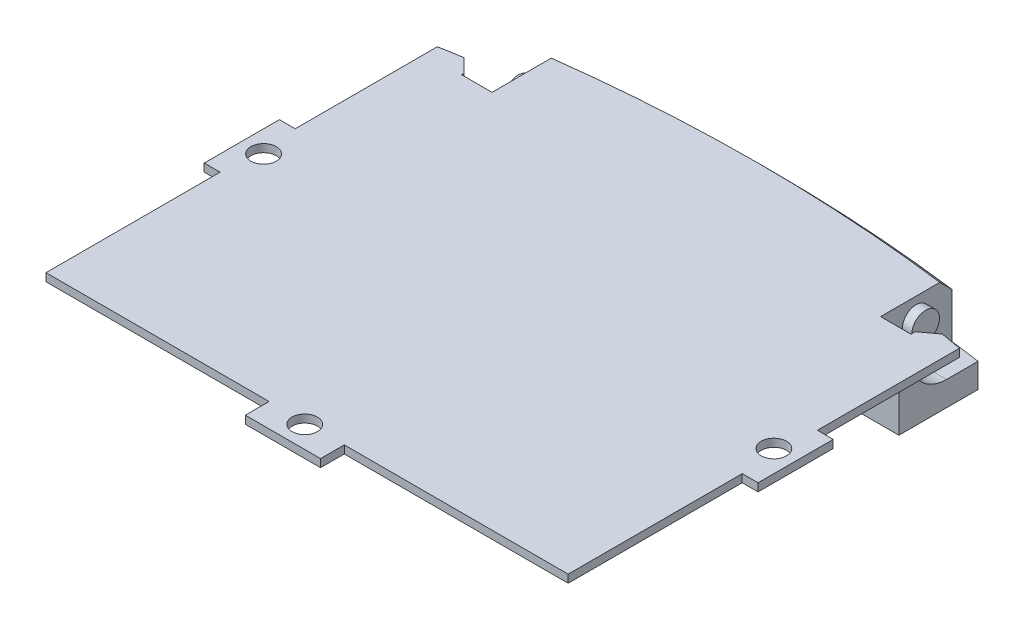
ISO-10303-21;
HEADER;
FILE_DESCRIPTION(('STEP AP214'),'2;1');
FILE_NAME('part.step','',(''),(''),'','','');
FILE_SCHEMA(('AUTOMOTIVE_DESIGN { 1 0 10303 214 1 1 1 1 }'));
ENDSEC;
DATA;
#1=APPLICATION_CONTEXT('core data for automotive mechanical design processes');
#2=APPLICATION_PROTOCOL_DEFINITION('international standard','automotive_design',2000,#1);
#3=PRODUCT_CONTEXT('',#1,'mechanical');
#4=PRODUCT('Part','Part','',(#3));
#5=PRODUCT_RELATED_PRODUCT_CATEGORY('part','',(#4));
#6=PRODUCT_DEFINITION_FORMATION('','',#4);
#7=PRODUCT_DEFINITION_CONTEXT('part definition',#1,'design');
#8=PRODUCT_DEFINITION('design','',#6,#7);
#9=PRODUCT_DEFINITION_SHAPE('','',#8);
#10=(LENGTH_UNIT() NAMED_UNIT(*) SI_UNIT(.MILLI.,.METRE.));
#11=(NAMED_UNIT(*) PLANE_ANGLE_UNIT() SI_UNIT($,.RADIAN.));
#12=(NAMED_UNIT(*) SI_UNIT($,.STERADIAN.) SOLID_ANGLE_UNIT());
#13=UNCERTAINTY_MEASURE_WITH_UNIT(LENGTH_MEASURE(1.E-05),#10,'distance_accuracy_value','');
#14=(GEOMETRIC_REPRESENTATION_CONTEXT(3) GLOBAL_UNCERTAINTY_ASSIGNED_CONTEXT((#13)) GLOBAL_UNIT_ASSIGNED_CONTEXT((#10,
#11,#12)) REPRESENTATION_CONTEXT('',''));
#15=CARTESIAN_POINT('',(0.,0.,0.));
#16=DIRECTION('',(0.,0.,1.));
#17=DIRECTION('',(1.,0.,0.));
#18=AXIS2_PLACEMENT_3D('',#15,#16,#17);
#19=CARTESIAN_POINT('',(0.,1.,0.));
#20=DIRECTION('',(0.,1.,0.));
#21=DIRECTION('',(0.,0.,1.));
#22=AXIS2_PLACEMENT_3D('',#19,#20,#21);
#23=PLANE('',#22);
#24=CARTESIAN_POINT('',(32.25,1.,23.25));
#25=DIRECTION('',(0.,-1.,0.));
#26=DIRECTION('',(0.,0.,-1.));
#27=AXIS2_PLACEMENT_3D('',#24,#25,#26);
#28=CIRCLE('',#27,1.6);
#29=CARTESIAN_POINT('',(32.25,1.,21.65));
#30=VERTEX_POINT('',#29);
#31=EDGE_CURVE('E987',#30,#30,#28,.T.);
#32=ORIENTED_EDGE('',*,*,#31,.T.);
#33=EDGE_LOOP('',(#32));
#34=FACE_BOUND('',#33,.T.);
#35=CARTESIAN_POINT('',(-32.25,1.,23.25));
#36=DIRECTION('',(0.,-1.,0.));
#37=DIRECTION('',(0.,0.,-1.));
#38=AXIS2_PLACEMENT_3D('',#35,#36,#37);
#39=CIRCLE('',#38,1.6);
#40=CARTESIAN_POINT('',(-32.25,1.,21.65));
#41=VERTEX_POINT('',#40);
#42=EDGE_CURVE('E997',#41,#41,#39,.T.);
#43=ORIENTED_EDGE('',*,*,#42,.T.);
#44=EDGE_LOOP('',(#43));
#45=FACE_BOUND('',#44,.T.);
#46=CARTESIAN_POINT('',(-0.0499999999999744,1.,50.25));
#47=DIRECTION('',(0.,-1.,0.));
#48=DIRECTION('',(0.,0.,-1.));
#49=AXIS2_PLACEMENT_3D('',#46,#47,#48);
#50=CIRCLE('',#49,1.60000000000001);
#51=CARTESIAN_POINT('',(-0.0499999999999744,1.,48.65));
#52=VERTEX_POINT('',#51);
#53=EDGE_CURVE('E986',#52,#52,#50,.T.);
#54=ORIENTED_EDGE('',*,*,#53,.T.);
#55=EDGE_LOOP('',(#54));
#56=FACE_BOUND('',#55,.T.);
#57=DIRECTION('',(0.,0.,1.));
#58=VECTOR('',#57,1.);
#59=CARTESIAN_POINT('',(24.5499999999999,1.,-8.50000000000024));
#60=LINE('',#59,#58);
#61=CARTESIAN_POINT('',(24.55,1.,-5.41984493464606));
#62=VERTEX_POINT('',#61);
#63=CARTESIAN_POINT('',(24.55,1.,2.0713222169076));
#64=VERTEX_POINT('',#63);
#65=EDGE_CURVE('E615',#62,#64,#60,.T.);
#66=ORIENTED_EDGE('',*,*,#65,.F.);
#67=CARTESIAN_POINT('',(0.,1.,184.5));
#68=DIRECTION('',(0.,1.,0.));
#69=DIRECTION('',(0.,0.,1.));
#70=AXIS2_PLACEMENT_3D('',#67,#68,#69);
#71=CIRCLE('',#70,191.5);
#72=CARTESIAN_POINT('',(-24.55,1.,-5.41984493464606));
#73=VERTEX_POINT('',#72);
#74=EDGE_CURVE('E1237',#62,#73,#71,.T.);
#75=ORIENTED_EDGE('',*,*,#74,.T.);
#76=DIRECTION('',(0.,0.,1.));
#77=VECTOR('',#76,1.);
#78=CARTESIAN_POINT('',(-24.5499999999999,1.,-8.50000000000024));
#79=LINE('',#78,#77);
#80=CARTESIAN_POINT('',(-24.55,1.,2.0713222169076));
#81=VERTEX_POINT('',#80);
#82=EDGE_CURVE('E544',#73,#81,#79,.T.);
#83=ORIENTED_EDGE('',*,*,#82,.T.);
#84=DIRECTION('',(-1.,0.,0.));
#85=VECTOR('',#84,1.);
#86=CARTESIAN_POINT('',(-24.55,1.,2.0713222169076));
#87=LINE('',#86,#85);
#88=CARTESIAN_POINT('',(-28.4,1.,2.07132221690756));
#89=VERTEX_POINT('',#88);
#90=EDGE_CURVE('E540',#81,#89,#87,.T.);
#91=ORIENTED_EDGE('',*,*,#90,.T.);
#92=DIRECTION('',(0.,0.,1.));
#93=VECTOR('',#92,1.);
#94=CARTESIAN_POINT('',(-28.3999999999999,1.,-8.50000000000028));
#95=LINE('',#94,#93);
#96=CARTESIAN_POINT('',(-28.4,1.,1.77033264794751));
#97=VERTEX_POINT('',#96);
#98=EDGE_CURVE('E561',#97,#89,#95,.T.);
#99=ORIENTED_EDGE('',*,*,#98,.F.);
#100=DIRECTION('',(0.70710678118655,0.,0.707106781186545));
#101=VECTOR('',#100,1.);
#102=CARTESIAN_POINT('',(-15.0851663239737,1.,15.0851663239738));
#103=LINE('',#102,#101);
#104=CARTESIAN_POINT('',(-30.1263283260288,1.,0.0440043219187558));
#105=VERTEX_POINT('',#104);
#106=EDGE_CURVE('E1493',#97,#105,#103,.F.);
#107=ORIENTED_EDGE('',*,*,#106,.T.);
#108=CARTESIAN_POINT('',(0.,1.,184.5));
#109=DIRECTION('',(0.,1.,0.));
#110=DIRECTION('',(0.,0.,-1.));
#111=AXIS2_PLACEMENT_3D('',#108,#109,#110);
#112=CIRCLE('',#111,186.9);
#113=CARTESIAN_POINT('',(-33.,1.,0.536389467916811));
#114=VERTEX_POINT('',#113);
#115=EDGE_CURVE('E1079',#105,#114,#112,.T.);
#116=ORIENTED_EDGE('',*,*,#115,.T.);
#117=DIRECTION('',(0.,0.,1.));
#118=VECTOR('',#117,1.);
#119=CARTESIAN_POINT('',(-33.,1.,50.));
#120=LINE('',#119,#118);
#121=CARTESIAN_POINT('',(-33.,1.,18.5));
#122=VERTEX_POINT('',#121);
#123=EDGE_CURVE('E1100',#114,#122,#120,.T.);
#124=ORIENTED_EDGE('',*,*,#123,.T.);
#125=DIRECTION('',(1.,0.,0.));
#126=VECTOR('',#125,1.);
#127=CARTESIAN_POINT('',(-35.,1.,18.5));
#128=LINE('',#127,#126);
#129=CARTESIAN_POINT('',(-35.,1.,18.5));
#130=VERTEX_POINT('',#129);
#131=EDGE_CURVE('E1045',#130,#122,#128,.T.);
#132=ORIENTED_EDGE('',*,*,#131,.F.);
#133=DIRECTION('',(0.,0.,-1.));
#134=VECTOR('',#133,1.);
#135=CARTESIAN_POINT('',(-35.,1.,28.));
#136=LINE('',#135,#134);
#137=CARTESIAN_POINT('',(-35.,1.,28.));
#138=VERTEX_POINT('',#137);
#139=EDGE_CURVE('E1048',#138,#130,#136,.T.);
#140=ORIENTED_EDGE('',*,*,#139,.F.);
#141=DIRECTION('',(-1.,0.,0.));
#142=VECTOR('',#141,1.);
#143=CARTESIAN_POINT('',(-35.,1.,28.));
#144=LINE('',#143,#142);
#145=CARTESIAN_POINT('',(-33.,1.,28.));
#146=VERTEX_POINT('',#145);
#147=EDGE_CURVE('E1055',#146,#138,#144,.T.);
#148=ORIENTED_EDGE('',*,*,#147,.F.);
#149=CARTESIAN_POINT('',(-33.,1.,50.));
#150=VERTEX_POINT('',#149);
#151=EDGE_CURVE('E1104',#146,#150,#120,.T.);
#152=ORIENTED_EDGE('',*,*,#151,.T.);
#153=DIRECTION('',(1.,0.,0.));
#154=VECTOR('',#153,1.);
#155=CARTESIAN_POINT('',(33.,1.,50.));
#156=LINE('',#155,#154);
#157=CARTESIAN_POINT('',(-4.79999999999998,1.,50.));
#158=VERTEX_POINT('',#157);
#159=EDGE_CURVE('E1105',#150,#158,#156,.T.);
#160=ORIENTED_EDGE('',*,*,#159,.T.);
#161=DIRECTION('',(0.,0.,-1.));
#162=VECTOR('',#161,1.);
#163=CARTESIAN_POINT('',(-4.79999999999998,1.,53.));
#164=LINE('',#163,#162);
#165=CARTESIAN_POINT('',(-4.79999999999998,1.,53.));
#166=VERTEX_POINT('',#165);
#167=EDGE_CURVE('E1010',#166,#158,#164,.T.);
#168=ORIENTED_EDGE('',*,*,#167,.F.);
#169=DIRECTION('',(-1.,0.,0.));
#170=VECTOR('',#169,1.);
#171=CARTESIAN_POINT('',(4.70000000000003,1.,53.));
#172=LINE('',#171,#170);
#173=CARTESIAN_POINT('',(4.70000000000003,1.,53.));
#174=VERTEX_POINT('',#173);
#175=EDGE_CURVE('E1009',#174,#166,#172,.T.);
#176=ORIENTED_EDGE('',*,*,#175,.F.);
#177=DIRECTION('',(0.,0.,1.));
#178=VECTOR('',#177,1.);
#179=CARTESIAN_POINT('',(4.70000000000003,1.,53.));
#180=LINE('',#179,#178);
#181=CARTESIAN_POINT('',(4.70000000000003,1.,50.));
#182=VERTEX_POINT('',#181);
#183=EDGE_CURVE('E1006',#182,#174,#180,.T.);
#184=ORIENTED_EDGE('',*,*,#183,.F.);
#185=CARTESIAN_POINT('',(33.,1.,50.));
#186=VERTEX_POINT('',#185);
#187=EDGE_CURVE('E1103',#182,#186,#156,.T.);
#188=ORIENTED_EDGE('',*,*,#187,.T.);
#189=DIRECTION('',(0.,0.,-1.));
#190=VECTOR('',#189,1.);
#191=CARTESIAN_POINT('',(33.,1.,50.));
#192=LINE('',#191,#190);
#193=CARTESIAN_POINT('',(33.,1.,28.));
#194=VERTEX_POINT('',#193);
#195=EDGE_CURVE('E1109',#186,#194,#192,.T.);
#196=ORIENTED_EDGE('',*,*,#195,.T.);
#197=CARTESIAN_POINT('',(35.,1.,28.));
#198=VERTEX_POINT('',#197);
#199=EDGE_CURVE('E1053',#198,#194,#144,.T.);
#200=ORIENTED_EDGE('',*,*,#199,.F.);
#201=DIRECTION('',(0.,0.,1.));
#202=VECTOR('',#201,1.);
#203=CARTESIAN_POINT('',(35.,1.,28.));
#204=LINE('',#203,#202);
#205=CARTESIAN_POINT('',(35.,1.,18.5));
#206=VERTEX_POINT('',#205);
#207=EDGE_CURVE('E1056',#206,#198,#204,.T.);
#208=ORIENTED_EDGE('',*,*,#207,.F.);
#209=CARTESIAN_POINT('',(33.,1.,18.5));
#210=VERTEX_POINT('',#209);
#211=EDGE_CURVE('E1034',#210,#206,#128,.T.);
#212=ORIENTED_EDGE('',*,*,#211,.F.);
#213=CARTESIAN_POINT('',(33.,1.,0.536389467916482));
#214=VERTEX_POINT('',#213);
#215=EDGE_CURVE('E1108',#210,#214,#192,.T.);
#216=ORIENTED_EDGE('',*,*,#215,.T.);
#217=CARTESIAN_POINT('',(0.,1.,184.5));
#218=DIRECTION('',(0.,1.,0.));
#219=DIRECTION('',(0.,0.,1.));
#220=AXIS2_PLACEMENT_3D('',#217,#218,#219);
#221=CIRCLE('',#220,186.9);
#222=CARTESIAN_POINT('',(30.3647013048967,1.,0.0830948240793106));
#223=VERTEX_POINT('',#222);
#224=EDGE_CURVE('E1093',#214,#223,#221,.T.);
#225=ORIENTED_EDGE('',*,*,#224,.T.);
#226=DIRECTION('',(0.806342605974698,0.,-0.591448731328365));
#227=VECTOR('',#226,1.);
#228=CARTESIAN_POINT('',(10.6615535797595,1.,14.535266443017));
#229=LINE('',#228,#227);
#230=CARTESIAN_POINT('',(28.4,1.,1.5241945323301));
#231=VERTEX_POINT('',#230);
#232=EDGE_CURVE('E1496',#223,#231,#229,.F.);
#233=ORIENTED_EDGE('',*,*,#232,.T.);
#234=DIRECTION('',(0.,0.,1.));
#235=VECTOR('',#234,1.);
#236=CARTESIAN_POINT('',(28.3999999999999,1.,-8.50000000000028));
#237=LINE('',#236,#235);
#238=CARTESIAN_POINT('',(28.4,1.,2.07132221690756));
#239=VERTEX_POINT('',#238);
#240=EDGE_CURVE('E625',#231,#239,#237,.T.);
#241=ORIENTED_EDGE('',*,*,#240,.T.);
#242=DIRECTION('',(1.,0.,0.));
#243=VECTOR('',#242,1.);
#244=CARTESIAN_POINT('',(24.55,1.,2.0713222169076));
#245=LINE('',#244,#243);
#246=EDGE_CURVE('E634',#64,#239,#245,.T.);
#247=ORIENTED_EDGE('',*,*,#246,.F.);
#248=EDGE_LOOP('',(#66,#75,#83,#91,#99,#107,#116,#124,#132,#140,#148,#152,#160,#168,#176,#184,
#188,#196,#200,#208,#212,#216,#225,#233,#241,#247));
#249=FACE_BOUND('',#248,.T.);
#250=ADVANCED_FACE('F46',(#34,#45,#56,#249),#23,.T.);
#251=CARTESIAN_POINT('',(0.,1.,184.5));
#252=DIRECTION('',(0.,-1.,0.));
#253=DIRECTION('',(0.,0.,-1.));
#254=AXIS2_PLACEMENT_3D('',#251,#252,#253);
#255=CYLINDRICAL_SURFACE('',#254,193.);
#256=CARTESIAN_POINT('',(-2.93,-4.85,-8.47775804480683));
#257=CARTESIAN_POINT('',(-2.97924194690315,-4.84999967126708,-8.47701050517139));
#258=CARTESIAN_POINT('',(-3.02846000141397,-4.84792032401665,-8.47624424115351));
#259=CARTESIAN_POINT('',(-3.12654331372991,-4.83962509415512,-8.47468001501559));
#260=CARTESIAN_POINT('',(-3.17540858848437,-4.83340941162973,-8.47388205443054));
#261=CARTESIAN_POINT('',(-3.32086992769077,-4.80861622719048,-8.47145173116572));
#262=CARTESIAN_POINT('',(-3.41649067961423,-4.78389242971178,-8.46978050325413));
#263=CARTESIAN_POINT('',(-3.60221822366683,-4.71874192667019,-8.46640298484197));
#264=CARTESIAN_POINT('',(-3.69232244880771,-4.67830797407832,-8.4646966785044));
#265=CARTESIAN_POINT('',(-3.86445892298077,-4.58288999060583,-8.46132609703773));
#266=CARTESIAN_POINT('',(-3.94649274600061,-4.5279088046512,-8.45966181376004));
#267=CARTESIAN_POINT('',(-4.10016657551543,-4.40495068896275,-8.45645766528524));
#268=CARTESIAN_POINT('',(-4.1718061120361,-4.33697317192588,-8.45491780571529));
#269=CARTESIAN_POINT('',(-4.30266730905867,-4.18994082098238,-8.45204416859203));
#270=CARTESIAN_POINT('',(-4.36188708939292,-4.11088431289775,-8.45071042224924));
#271=CARTESIAN_POINT('',(-4.46620086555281,-3.94396174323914,-8.44832412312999));
#272=CARTESIAN_POINT('',(-4.51129751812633,-3.85609734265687,-8.44727151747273));
#273=CARTESIAN_POINT('',(-4.58609597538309,-3.67404677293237,-8.44550819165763));
#274=CARTESIAN_POINT('',(-4.61579878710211,-3.57986101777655,-8.44479744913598));
#275=CARTESIAN_POINT('',(-4.65896387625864,-3.38786025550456,-8.44376000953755));
#276=CARTESIAN_POINT('',(-4.67243000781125,-3.29004611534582,-8.44343322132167));
#277=CARTESIAN_POINT('',(-4.68275170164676,-3.09354260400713,-8.44318299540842));
#278=CARTESIAN_POINT('',(-4.67960690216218,-2.99485321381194,-8.44325956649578));
#279=CARTESIAN_POINT('',(-4.65679734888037,-2.79942091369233,-8.44381142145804));
#280=CARTESIAN_POINT('',(-4.63713545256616,-2.70267767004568,-8.44428663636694));
#281=CARTESIAN_POINT('',(-4.58185455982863,-2.51386613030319,-8.445607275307));
#282=CARTESIAN_POINT('',(-4.54623560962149,-2.42179782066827,-8.44645269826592));
#283=CARTESIAN_POINT('',(-4.46004841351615,-2.24493871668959,-8.44846414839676));
#284=CARTESIAN_POINT('',(-4.40947861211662,-2.16014868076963,-8.44963020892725));
#285=CARTESIAN_POINT('',(-4.29482976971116,-2.00026561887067,-8.45221614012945));
#286=CARTESIAN_POINT('',(-4.2307513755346,-1.92517212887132,-8.45363599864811));
#287=CARTESIAN_POINT('',(-4.09089620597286,-1.78679829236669,-8.45665173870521));
#288=CARTESIAN_POINT('',(-4.01511810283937,-1.7235192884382,-8.45824764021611));
#289=CARTESIAN_POINT('',(-3.85398655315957,-1.61056053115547,-8.46153313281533));
#290=CARTESIAN_POINT('',(-3.76863005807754,-1.56088512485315,-8.46322275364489));
#291=CARTESIAN_POINT('',(-3.59073493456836,-1.4765360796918,-8.46661510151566));
#292=CARTESIAN_POINT('',(-3.49819051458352,-1.44187468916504,-8.46831783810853));
#293=CARTESIAN_POINT('',(-3.308666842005,-1.38863555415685,-8.47166025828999));
#294=CARTESIAN_POINT('',(-3.211694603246,-1.3700332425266,-8.47330003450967));
#295=CARTESIAN_POINT('',(-3.0833974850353,-1.35646318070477,-8.47537047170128));
#296=CARTESIAN_POINT('',(-3.05274130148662,-1.35403821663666,-8.47585786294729));
#297=CARTESIAN_POINT('',(-2.99139425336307,-1.35080883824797,-8.47681854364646));
#298=CARTESIAN_POINT('',(-2.96070352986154,-1.35000175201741,-8.47729185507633));
#299=CARTESIAN_POINT('',(-2.93,-1.35,-8.47775804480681));
#300=B_SPLINE_CURVE_WITH_KNOTS('',3,(#256,#257,#258,#259,#260,#261,#262,#263,#264,#265,#266,
#267,#268,#269,#270,#271,#272,#273,#274,#275,#276,#277,#278,#279,#280,#281,#282,#283,#284,#285,
#286,#287,#288,#289,#290,#291,#292,#293,#294,#295,#296,#297,#298,#299),.UNSPECIFIED.,.F.,.F.,(4,
2,2,2,2,2,2,2,2,2,2,2,2,2,2,2,2,2,2,2,2,4),(0.,0.147652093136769,0.295297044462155,
0.590115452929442,0.885070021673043,1.17996695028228,1.47487720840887,1.76983207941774,
2.06473143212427,2.35961149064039,2.65442153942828,2.94923800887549,3.24400348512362,
3.5387681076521,3.83356340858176,4.12834459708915,4.42315926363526,4.71806802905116,
5.0132169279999,5.30791350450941,5.40015117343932,5.49223638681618),.UNSPECIFIED.);
#301=CARTESIAN_POINT('',(-2.93,-4.85,-8.47775804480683));
#302=VERTEX_POINT('',#301);
#303=CARTESIAN_POINT('',(-2.93,-1.35,-8.47775804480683));
#304=VERTEX_POINT('',#303);
#305=EDGE_CURVE('E734',#302,#304,#300,.T.);
#306=ORIENTED_EDGE('',*,*,#305,.F.);
#307=CARTESIAN_POINT('',(0.,-4.85,184.5));
#308=DIRECTION('',(0.,-1.,0.));
#309=DIRECTION('',(0.,0.,-1.));
#310=AXIS2_PLACEMENT_3D('',#307,#308,#309);
#311=CIRCLE('',#310,193.);
#312=CARTESIAN_POINT('',(2.93,-4.85,-8.47775804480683));
#313=VERTEX_POINT('',#312);
#314=EDGE_CURVE('E720',#313,#302,#311,.F.);
#315=ORIENTED_EDGE('',*,*,#314,.F.);
#316=CARTESIAN_POINT('',(2.93,-1.35,-8.47775804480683));
#317=CARTESIAN_POINT('',(2.97924194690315,-1.35000032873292,-8.47701050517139));
#318=CARTESIAN_POINT('',(3.02846000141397,-1.35207967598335,-8.47624424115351));
#319=CARTESIAN_POINT('',(3.12654331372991,-1.36037490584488,-8.47468001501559));
#320=CARTESIAN_POINT('',(3.17540858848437,-1.36659058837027,-8.47388205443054));
#321=CARTESIAN_POINT('',(3.32086992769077,-1.39138377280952,-8.47145173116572));
#322=CARTESIAN_POINT('',(3.41649067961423,-1.41610757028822,-8.46978050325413));
#323=CARTESIAN_POINT('',(3.60221822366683,-1.48125807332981,-8.46640298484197));
#324=CARTESIAN_POINT('',(3.69232244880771,-1.52169202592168,-8.4646966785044));
#325=CARTESIAN_POINT('',(3.86445892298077,-1.61711000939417,-8.46132609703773));
#326=CARTESIAN_POINT('',(3.94649274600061,-1.6720911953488,-8.45966181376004));
#327=CARTESIAN_POINT('',(4.10016657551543,-1.79504931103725,-8.45645766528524));
#328=CARTESIAN_POINT('',(4.1718061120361,-1.86302682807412,-8.45491780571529));
#329=CARTESIAN_POINT('',(4.30266730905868,-2.01005917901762,-8.45204416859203));
#330=CARTESIAN_POINT('',(4.36188708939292,-2.08911568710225,-8.45071042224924));
#331=CARTESIAN_POINT('',(4.46620086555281,-2.25603825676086,-8.44832412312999));
#332=CARTESIAN_POINT('',(4.51129751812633,-2.34390265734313,-8.44727151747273));
#333=CARTESIAN_POINT('',(4.58609597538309,-2.52595322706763,-8.44550819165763));
#334=CARTESIAN_POINT('',(4.61579878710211,-2.62013898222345,-8.44479744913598));
#335=CARTESIAN_POINT('',(4.65896387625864,-2.81213974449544,-8.44376000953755));
#336=CARTESIAN_POINT('',(4.67243000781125,-2.90995388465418,-8.44343322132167));
#337=CARTESIAN_POINT('',(4.68275170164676,-3.10645739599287,-8.44318299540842));
#338=CARTESIAN_POINT('',(4.67960690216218,-3.20514678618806,-8.44325956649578));
#339=CARTESIAN_POINT('',(4.65679734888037,-3.40057908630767,-8.44381142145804));
#340=CARTESIAN_POINT('',(4.63713545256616,-3.49732232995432,-8.44428663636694));
#341=CARTESIAN_POINT('',(4.58185455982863,-3.68613386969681,-8.445607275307));
#342=CARTESIAN_POINT('',(4.54623560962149,-3.77820217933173,-8.44645269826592));
#343=CARTESIAN_POINT('',(4.46004841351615,-3.95506128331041,-8.44846414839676));
#344=CARTESIAN_POINT('',(4.40947861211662,-4.03985131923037,-8.44963020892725));
#345=CARTESIAN_POINT('',(4.29482976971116,-4.19973438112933,-8.45221614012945));
#346=CARTESIAN_POINT('',(4.2307513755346,-4.27482787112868,-8.45363599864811));
#347=CARTESIAN_POINT('',(4.09089620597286,-4.41320170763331,-8.45665173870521));
#348=CARTESIAN_POINT('',(4.01511810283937,-4.4764807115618,-8.45824764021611));
#349=CARTESIAN_POINT('',(3.85398655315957,-4.58943946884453,-8.46153313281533));
#350=CARTESIAN_POINT('',(3.76863005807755,-4.63911487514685,-8.46322275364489));
#351=CARTESIAN_POINT('',(3.59073493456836,-4.72346392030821,-8.46661510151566));
#352=CARTESIAN_POINT('',(3.49819051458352,-4.75812531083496,-8.46831783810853));
#353=CARTESIAN_POINT('',(3.308666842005,-4.81136444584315,-8.47166025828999));
#354=CARTESIAN_POINT('',(3.211694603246,-4.8299667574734,-8.47330003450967));
#355=CARTESIAN_POINT('',(3.0833974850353,-4.84353681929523,-8.47537047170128));
#356=CARTESIAN_POINT('',(3.05274130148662,-4.84596178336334,-8.47585786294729));
#357=CARTESIAN_POINT('',(2.99139425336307,-4.84919116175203,-8.47681854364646));
#358=CARTESIAN_POINT('',(2.96070352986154,-4.84999824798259,-8.47729185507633));
#359=CARTESIAN_POINT('',(2.93,-4.85,-8.47775804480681));
#360=B_SPLINE_CURVE_WITH_KNOTS('',3,(#316,#317,#318,#319,#320,#321,#322,#323,#324,#325,#326,
#327,#328,#329,#330,#331,#332,#333,#334,#335,#336,#337,#338,#339,#340,#341,#342,#343,#344,#345,
#346,#347,#348,#349,#350,#351,#352,#353,#354,#355,#356,#357,#358,#359),.UNSPECIFIED.,.F.,.F.,(4,
2,2,2,2,2,2,2,2,2,2,2,2,2,2,2,2,2,2,2,2,4),(0.,0.147652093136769,0.295297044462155,
0.590115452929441,0.885070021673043,1.17996695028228,1.47487720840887,1.76983207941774,
2.06473143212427,2.35961149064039,2.65442153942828,2.94923800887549,3.24400348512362,
3.5387681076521,3.83356340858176,4.12834459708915,4.42315926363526,4.71806802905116,
5.0132169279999,5.30791350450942,5.40015117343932,5.49223638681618),.UNSPECIFIED.);
#361=CARTESIAN_POINT('',(2.93,-1.35,-8.47775804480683));
#362=VERTEX_POINT('',#361);
#363=EDGE_CURVE('E710',#362,#313,#360,.T.);
#364=ORIENTED_EDGE('',*,*,#363,.F.);
#365=CARTESIAN_POINT('',(0.,-1.35,184.5));
#366=DIRECTION('',(0.,1.,0.));
#367=DIRECTION('',(0.,0.,1.));
#368=AXIS2_PLACEMENT_3D('',#365,#366,#367);
#369=CIRCLE('',#368,193.);
#370=EDGE_CURVE('E719',#304,#362,#369,.F.);
#371=ORIENTED_EDGE('',*,*,#370,.F.);
#372=EDGE_LOOP('',(#306,#315,#364,#371));
#373=FACE_BOUND('',#372,.T.);
#374=DIRECTION('',(0.,-1.,0.));
#375=VECTOR('',#374,1.);
#376=CARTESIAN_POINT('',(-24.5499999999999,1.,-6.93222691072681));
#377=LINE('',#376,#375);
#378=CARTESIAN_POINT('',(-24.55,-6.19999999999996,-6.93222691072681));
#379=VERTEX_POINT('',#378);
#380=CARTESIAN_POINT('',(-24.5499999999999,-0.500000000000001,-6.93222691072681));
#381=VERTEX_POINT('',#380);
#382=EDGE_CURVE('E1501',#379,#381,#377,.F.);
#383=ORIENTED_EDGE('',*,*,#382,.T.);
#384=CARTESIAN_POINT('',(0.,-0.500000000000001,184.5));
#385=DIRECTION('',(0.,1.,0.));
#386=DIRECTION('',(0.,0.,1.));
#387=AXIS2_PLACEMENT_3D('',#384,#385,#386);
#388=CIRCLE('',#387,193.);
#389=CARTESIAN_POINT('',(24.5499999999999,-0.500000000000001,-6.93222691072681));
#390=VERTEX_POINT('',#389);
#391=EDGE_CURVE('E1250',#381,#390,#388,.F.);
#392=ORIENTED_EDGE('',*,*,#391,.T.);
#393=DIRECTION('',(0.,-1.,0.));
#394=VECTOR('',#393,1.);
#395=CARTESIAN_POINT('',(24.5499999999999,1.,-6.93222691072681));
#396=LINE('',#395,#394);
#397=CARTESIAN_POINT('',(24.55,-6.19999999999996,-6.93222691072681));
#398=VERTEX_POINT('',#397);
#399=EDGE_CURVE('E741',#390,#398,#396,.T.);
#400=ORIENTED_EDGE('',*,*,#399,.T.);
#401=CARTESIAN_POINT('',(0.,-6.19999999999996,184.5));
#402=DIRECTION('',(0.,-1.,0.));
#403=DIRECTION('',(0.,0.,-1.));
#404=AXIS2_PLACEMENT_3D('',#401,#402,#403);
#405=CIRCLE('',#404,193.);
#406=CARTESIAN_POINT('',(28.4,-6.19999999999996,-6.39903090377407));
#407=VERTEX_POINT('',#406);
#408=EDGE_CURVE('E633',#407,#398,#405,.F.);
#409=ORIENTED_EDGE('',*,*,#408,.F.);
#410=DIRECTION('',(0.,-1.,0.));
#411=VECTOR('',#410,1.);
#412=CARTESIAN_POINT('',(28.4,1.,-6.39903090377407));
#413=LINE('',#412,#411);
#414=CARTESIAN_POINT('',(28.3999999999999,-9.3,-6.39903090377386));
#415=VERTEX_POINT('',#414);
#416=EDGE_CURVE('E1078',#407,#415,#413,.T.);
#417=ORIENTED_EDGE('',*,*,#416,.T.);
#418=CARTESIAN_POINT('',(0.,-9.3,184.5));
#419=DIRECTION('',(0.,-1.,0.));
#420=DIRECTION('',(0.,0.,-1.));
#421=AXIS2_PLACEMENT_3D('',#418,#419,#420);
#422=CIRCLE('',#421,193.);
#423=CARTESIAN_POINT('',(-28.4,-9.3,-6.39903090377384));
#424=VERTEX_POINT('',#423);
#425=EDGE_CURVE('E976',#424,#415,#422,.T.);
#426=ORIENTED_EDGE('',*,*,#425,.F.);
#427=DIRECTION('',(0.,-1.,0.));
#428=VECTOR('',#427,1.);
#429=CARTESIAN_POINT('',(-28.4,1.,-6.39903090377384));
#430=LINE('',#429,#428);
#431=CARTESIAN_POINT('',(-28.4,-6.19999999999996,-6.39903090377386));
#432=VERTEX_POINT('',#431);
#433=EDGE_CURVE('E1081',#432,#424,#430,.T.);
#434=ORIENTED_EDGE('',*,*,#433,.F.);
#435=CARTESIAN_POINT('',(0.,-6.19999999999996,184.5));
#436=DIRECTION('',(0.,1.,0.));
#437=DIRECTION('',(0.,0.,1.));
#438=AXIS2_PLACEMENT_3D('',#435,#436,#437);
#439=CIRCLE('',#438,193.);
#440=EDGE_CURVE('E575',#432,#379,#439,.F.);
#441=ORIENTED_EDGE('',*,*,#440,.T.);
#442=EDGE_LOOP('',(#383,#392,#400,#409,#417,#426,#434,#441));
#443=FACE_BOUND('',#442,.T.);
#444=ADVANCED_FACE('F723',(#373,#443),#255,.T.);
#445=CARTESIAN_POINT('',(-28.4,1.,-0.229667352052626));
#446=DIRECTION('',(1.,0.,0.));
#447=DIRECTION('',(0.,0.,-1.));
#448=AXIS2_PLACEMENT_3D('',#445,#446,#447);
#449=PLANE('',#448);
#450=DIRECTION('',(0.,0.,-1.));
#451=VECTOR('',#450,1.);
#452=CARTESIAN_POINT('',(-28.4,-6.19999999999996,-2.42867778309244));
#453=LINE('',#452,#451);
#454=CARTESIAN_POINT('',(-28.4,-6.19999999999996,-2.42867778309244));
#455=VERTEX_POINT('',#454);
#456=EDGE_CURVE('E558',#455,#432,#453,.T.);
#457=ORIENTED_EDGE('',*,*,#456,.T.);
#458=ORIENTED_EDGE('',*,*,#433,.T.);
#459=DIRECTION('',(0.,0.,-1.));
#460=VECTOR('',#459,1.);
#461=CARTESIAN_POINT('',(-28.4,-9.3,-4.88239094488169));
#462=LINE('',#461,#460);
#463=CARTESIAN_POINT('',(-28.3999999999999,-9.3,3.60096909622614));
#464=VERTEX_POINT('',#463);
#465=EDGE_CURVE('E983',#464,#424,#462,.T.);
#466=ORIENTED_EDGE('',*,*,#465,.F.);
#467=DIRECTION('',(0.,-1.,0.));
#468=VECTOR('',#467,1.);
#469=CARTESIAN_POINT('',(-28.3999999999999,12.3518413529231,3.60096909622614));
#470=LINE('',#469,#468);
#471=CARTESIAN_POINT('',(-28.3999999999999,0.,3.60096909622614));
#472=VERTEX_POINT('',#471);
#473=EDGE_CURVE('E579',#472,#464,#470,.T.);
#474=ORIENTED_EDGE('',*,*,#473,.F.);
#475=DIRECTION('',(0.,0.,1.));
#476=VECTOR('',#475,1.);
#477=CARTESIAN_POINT('',(-28.3999999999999,0.,-6.39903090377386));
#478=LINE('',#477,#476);
#479=CARTESIAN_POINT('',(-28.4,0.,2.07132221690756));
#480=VERTEX_POINT('',#479);
#481=EDGE_CURVE('E593',#480,#472,#478,.T.);
#482=ORIENTED_EDGE('',*,*,#481,.F.);
#483=DIRECTION('',(0.,1.,0.));
#484=VECTOR('',#483,1.);
#485=CARTESIAN_POINT('',(-28.4,1.,2.07132221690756));
#486=LINE('',#485,#484);
#487=CARTESIAN_POINT('',(-28.4,-1.69999999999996,2.07132221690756));
#488=VERTEX_POINT('',#487);
#489=EDGE_CURVE('E1502',#488,#480,#486,.T.);
#490=ORIENTED_EDGE('',*,*,#489,.F.);
#491=CARTESIAN_POINT('',(-28.4,-1.69999999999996,-2.42867778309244));
#492=DIRECTION('',(1.,0.,0.));
#493=DIRECTION('',(0.,0.,-1.));
#494=AXIS2_PLACEMENT_3D('',#491,#492,#493);
#495=CIRCLE('',#494,4.5);
#496=EDGE_CURVE('E553',#488,#455,#495,.T.);
#497=ORIENTED_EDGE('',*,*,#496,.T.);
#498=EDGE_LOOP('',(#457,#458,#466,#474,#482,#490,#497));
#499=FACE_BOUND('',#498,.T.);
#500=ADVANCED_FACE('F728',(#499),#449,.F.);
#501=CARTESIAN_POINT('',(0.,-9.3,184.5));
#502=DIRECTION('',(0.,1.,0.));
#503=DIRECTION('',(0.,0.,1.));
#504=AXIS2_PLACEMENT_3D('',#501,#502,#503);
#505=CYLINDRICAL_SURFACE('',#504,191.5);
#506=DIRECTION('',(0.,1.,0.));
#507=VECTOR('',#506,1.);
#508=CARTESIAN_POINT('',(-9.8,-9.3,-6.74907842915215));
#509=LINE('',#508,#507);
#510=CARTESIAN_POINT('',(-9.8,-1.99999999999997,-6.74907842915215));
#511=VERTEX_POINT('',#510);
#512=CARTESIAN_POINT('',(-9.8,-2.9,-6.74907842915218));
#513=VERTEX_POINT('',#512);
#514=EDGE_CURVE('E954',#511,#513,#509,.F.);
#515=ORIENTED_EDGE('',*,*,#514,.F.);
#516=CARTESIAN_POINT('',(0.,-1.99999999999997,184.5));
#517=DIRECTION('',(0.,1.,0.));
#518=DIRECTION('',(0.,0.,1.));
#519=AXIS2_PLACEMENT_3D('',#516,#517,#518);
#520=CIRCLE('',#519,191.5);
#521=CARTESIAN_POINT('',(-22.3999999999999,-1.99999999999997,-5.6854095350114));
#522=VERTEX_POINT('',#521);
#523=EDGE_CURVE('E1452',#511,#522,#520,.T.);
#524=ORIENTED_EDGE('',*,*,#523,.T.);
#525=DIRECTION('',(0.,1.,0.));
#526=VECTOR('',#525,1.);
#527=CARTESIAN_POINT('',(-22.3999999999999,-9.3,-5.6854095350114));
#528=LINE('',#527,#526);
#529=CARTESIAN_POINT('',(-22.3999999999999,-9.3,-5.6854095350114));
#530=VERTEX_POINT('',#529);
#531=EDGE_CURVE('E590',#530,#522,#528,.T.);
#532=ORIENTED_EDGE('',*,*,#531,.F.);
#533=CARTESIAN_POINT('',(0.,-9.3,184.5));
#534=DIRECTION('',(0.,1.,0.));
#535=DIRECTION('',(0.,0.,-1.));
#536=AXIS2_PLACEMENT_3D('',#533,#534,#535);
#537=CIRCLE('',#536,191.5);
#538=CARTESIAN_POINT('',(22.3999999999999,-9.3,-5.6854095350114));
#539=VERTEX_POINT('',#538);
#540=EDGE_CURVE('E980',#539,#530,#537,.T.);
#541=ORIENTED_EDGE('',*,*,#540,.F.);
#542=DIRECTION('',(0.,1.,0.));
#543=VECTOR('',#542,1.);
#544=CARTESIAN_POINT('',(22.3999999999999,-9.3,-5.6854095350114));
#545=LINE('',#544,#543);
#546=CARTESIAN_POINT('',(22.3999999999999,-1.99999999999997,-5.6854095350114));
#547=VERTEX_POINT('',#546);
#548=EDGE_CURVE('E652',#539,#547,#545,.T.);
#549=ORIENTED_EDGE('',*,*,#548,.T.);
#550=CARTESIAN_POINT('',(0.,-1.99999999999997,184.5));
#551=DIRECTION('',(0.,1.,0.));
#552=DIRECTION('',(0.,0.,1.));
#553=AXIS2_PLACEMENT_3D('',#550,#551,#552);
#554=CIRCLE('',#553,191.5);
#555=CARTESIAN_POINT('',(9.79999999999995,-1.99999999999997,-6.74907842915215));
#556=VERTEX_POINT('',#555);
#557=EDGE_CURVE('E1248',#547,#556,#554,.T.);
#558=ORIENTED_EDGE('',*,*,#557,.T.);
#559=DIRECTION('',(0.,1.,0.));
#560=VECTOR('',#559,1.);
#561=CARTESIAN_POINT('',(9.79999999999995,-9.3,-6.74907842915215));
#562=LINE('',#561,#560);
#563=CARTESIAN_POINT('',(9.8,-2.9,-6.74907842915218));
#564=VERTEX_POINT('',#563);
#565=EDGE_CURVE('E919',#564,#556,#562,.T.);
#566=ORIENTED_EDGE('',*,*,#565,.F.);
#567=CARTESIAN_POINT('',(0.,-2.9,184.5));
#568=DIRECTION('',(0.,-1.,0.));
#569=DIRECTION('',(0.,0.,-1.));
#570=AXIS2_PLACEMENT_3D('',#567,#568,#569);
#571=CIRCLE('',#570,191.5);
#572=CARTESIAN_POINT('',(7.05,-2.9,-6.87018445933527));
#573=VERTEX_POINT('',#572);
#574=EDGE_CURVE('E1141',#564,#573,#571,.F.);
#575=ORIENTED_EDGE('',*,*,#574,.T.);
#576=DIRECTION('',(0.,1.,0.));
#577=VECTOR('',#576,1.);
#578=CARTESIAN_POINT('',(7.05,-9.3,-6.87018445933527));
#579=LINE('',#578,#577);
#580=CARTESIAN_POINT('',(7.05,-2.,-6.87018445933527));
#581=VERTEX_POINT('',#580);
#582=EDGE_CURVE('E850',#581,#573,#579,.F.);
#583=ORIENTED_EDGE('',*,*,#582,.F.);
#584=CARTESIAN_POINT('',(0.,-2.,184.5));
#585=DIRECTION('',(0.,-1.,0.));
#586=DIRECTION('',(0.,0.,-1.));
#587=AXIS2_PLACEMENT_3D('',#584,#585,#586);
#588=CIRCLE('',#587,191.5);
#589=CARTESIAN_POINT('',(4.29106575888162,-2.,-6.95191760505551));
#590=VERTEX_POINT('',#589);
#591=EDGE_CURVE('E1130',#581,#590,#588,.F.);
#592=ORIENTED_EDGE('',*,*,#591,.T.);
#593=CARTESIAN_POINT('',(2.93,-1.35,-6.97758380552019));
#594=CARTESIAN_POINT('',(2.97924206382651,-1.35000032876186,-6.97683040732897));
#595=CARTESIAN_POINT('',(3.02846023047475,-1.35207968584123,-6.97605813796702));
#596=CARTESIAN_POINT('',(3.12654375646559,-1.36037495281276,-6.97448165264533));
#597=CARTESIAN_POINT('',(3.17540913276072,-1.36659066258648,-6.97367743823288));
#598=CARTESIAN_POINT('',(3.32087075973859,-1.39138395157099,-6.97122806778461));
#599=CARTESIAN_POINT('',(3.41649168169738,-1.41610784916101,-6.96954374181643));
#600=CARTESIAN_POINT('',(3.60221952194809,-1.48125860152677,-6.96613975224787));
#601=CARTESIAN_POINT('',(3.69232387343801,-1.52169270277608,-6.96442007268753));
#602=CARTESIAN_POINT('',(3.86446056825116,-1.61711103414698,-6.96102307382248));
#603=CARTESIAN_POINT('',(3.9464944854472,-1.67209241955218,-6.95934574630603));
#604=CARTESIAN_POINT('',(4.1001684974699,-1.79505101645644,-6.95611648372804));
#605=CARTESIAN_POINT('',(4.1718081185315,-1.86302881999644,-6.9545645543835));
#606=CARTESIAN_POINT('',(4.30266942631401,-2.01006182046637,-6.95166839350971));
#607=CARTESIAN_POINT('',(4.36188923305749,-2.08911869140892,-6.95032419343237));
#608=CARTESIAN_POINT('',(4.46620285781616,-2.25604187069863,-6.94791919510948));
#609=CARTESIAN_POINT('',(4.51129936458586,-2.3439064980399,-6.94685834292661));
#610=CARTESIAN_POINT('',(4.58609748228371,-2.52595754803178,-6.9450812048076));
#611=CARTESIAN_POINT('',(4.61580010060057,-2.62014355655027,-6.94436489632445));
#612=CARTESIAN_POINT('',(4.65896464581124,-2.81214443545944,-6.9433193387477));
#613=CARTESIAN_POINT('',(4.67243049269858,-2.90995842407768,-6.94298999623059));
#614=CARTESIAN_POINT('',(4.68275167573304,-3.1064615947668,-6.94273782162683));
#615=CARTESIAN_POINT('',(4.67960665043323,-3.20515079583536,-6.9428149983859));
#616=CARTESIAN_POINT('',(4.65679674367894,-3.40058241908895,-6.94337118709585));
#617=CARTESIAN_POINT('',(4.6371347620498,-3.49732517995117,-6.94385012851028));
#618=CARTESIAN_POINT('',(4.58185386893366,-3.68613573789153,-6.94518111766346));
#619=CARTESIAN_POINT('',(4.54623500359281,-3.77820354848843,-6.94603316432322));
#620=CARTESIAN_POINT('',(4.46004810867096,-3.95506178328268,-6.94806037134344));
#621=CARTESIAN_POINT('',(4.40947850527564,-4.03985144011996,-6.94923556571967));
#622=CARTESIAN_POINT('',(4.29483021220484,-4.19973379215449,-6.95184175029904));
#623=CARTESIAN_POINT('',(4.23075216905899,-4.27482695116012,-6.95327272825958));
#624=CARTESIAN_POINT('',(4.09089756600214,-4.41320049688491,-6.95631208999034));
#625=CARTESIAN_POINT('',(4.01511963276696,-4.47647949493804,-6.95792049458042));
#626=CARTESIAN_POINT('',(3.85398845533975,-4.58943827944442,-6.961231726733));
#627=CARTESIAN_POINT('',(3.7686321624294,-4.63911371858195,-6.96293458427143));
#628=CARTESIAN_POINT('',(3.59073715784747,-4.72346302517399,-6.96635351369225));
#629=CARTESIAN_POINT('',(3.49819263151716,-4.75812459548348,-6.96806959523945));
#630=CARTESIAN_POINT('',(3.30866869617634,-4.81136404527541,-6.97143821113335));
#631=CARTESIAN_POINT('',(3.2116963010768,-4.82996649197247,-6.97309083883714));
#632=CARTESIAN_POINT('',(3.08339875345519,-4.84353671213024,-6.97517750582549));
#633=CARTESIAN_POINT('',(3.05274231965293,-4.84596171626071,-6.975668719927));
#634=CARTESIAN_POINT('',(2.99139476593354,-4.84919114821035,-6.9766369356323));
#635=CARTESIAN_POINT('',(2.96070378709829,-4.84999824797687,-6.97711395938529));
#636=CARTESIAN_POINT('',(2.93,-4.85,-6.97758380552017));
#637=B_SPLINE_CURVE_WITH_KNOTS('',3,(#593,#594,#595,#596,#597,#598,#599,#600,#601,#602,#603,
#604,#605,#606,#607,#608,#609,#610,#611,#612,#613,#614,#615,#616,#617,#618,#619,#620,#621,#622,
#623,#624,#625,#626,#627,#628,#629,#630,#631,#632,#633,#634,#635,#636),.UNSPECIFIED.,.F.,.F.,(4,
2,2,2,2,2,2,2,2,2,2,2,2,2,2,2,2,2,2,2,2,4),(0.,0.147652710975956,0.295298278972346,
0.590117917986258,0.885073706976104,1.17997186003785,1.47488345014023,1.76983964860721,
2.06473965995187,2.35962037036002,2.65442987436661,2.94924579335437,3.24400996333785,
3.53877328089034,3.83356763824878,4.12834788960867,4.42316276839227,4.71807175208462,
5.01322182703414,5.30791957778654,5.40015818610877,5.49224433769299),.UNSPECIFIED.);
#638=CARTESIAN_POINT('',(2.93,-4.85,-6.97758380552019));
#639=VERTEX_POINT('',#638);
#640=EDGE_CURVE('E682',#590,#639,#637,.T.);
#641=ORIENTED_EDGE('',*,*,#640,.T.);
#642=CARTESIAN_POINT('',(0.,-4.85,184.5));
#643=DIRECTION('',(0.,-1.,0.));
#644=DIRECTION('',(0.,0.,-1.));
#645=AXIS2_PLACEMENT_3D('',#642,#643,#644);
#646=CIRCLE('',#645,191.5);
#647=CARTESIAN_POINT('',(-2.93,-4.85,-6.97758380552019));
#648=VERTEX_POINT('',#647);
#649=EDGE_CURVE('E666',#639,#648,#646,.F.);
#650=ORIENTED_EDGE('',*,*,#649,.T.);
#651=CARTESIAN_POINT('',(-2.93,-4.85,-6.97758380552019));
#652=CARTESIAN_POINT('',(-2.97924206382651,-4.84999967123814,-6.97683040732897));
#653=CARTESIAN_POINT('',(-3.02846023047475,-4.84792031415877,-6.97605813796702));
#654=CARTESIAN_POINT('',(-3.12654375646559,-4.83962504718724,-6.97448165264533));
#655=CARTESIAN_POINT('',(-3.17540913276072,-4.83340933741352,-6.97367743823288));
#656=CARTESIAN_POINT('',(-3.3208707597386,-4.80861604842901,-6.97122806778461));
#657=CARTESIAN_POINT('',(-3.41649168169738,-4.78389215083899,-6.96954374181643));
#658=CARTESIAN_POINT('',(-3.60221952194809,-4.71874139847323,-6.96613975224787));
#659=CARTESIAN_POINT('',(-3.69232387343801,-4.67830729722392,-6.96442007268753));
#660=CARTESIAN_POINT('',(-3.86446056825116,-4.58288896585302,-6.96102307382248));
#661=CARTESIAN_POINT('',(-3.9464944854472,-4.52790758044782,-6.95934574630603));
#662=CARTESIAN_POINT('',(-4.1001684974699,-4.40494898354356,-6.95611648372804));
#663=CARTESIAN_POINT('',(-4.1718081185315,-4.33697118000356,-6.9545645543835));
#664=CARTESIAN_POINT('',(-4.30266942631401,-4.18993817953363,-6.95166839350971));
#665=CARTESIAN_POINT('',(-4.36188923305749,-4.11088130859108,-6.95032419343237));
#666=CARTESIAN_POINT('',(-4.46620285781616,-3.94395812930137,-6.94791919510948));
#667=CARTESIAN_POINT('',(-4.51129936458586,-3.8560935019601,-6.94685834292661));
#668=CARTESIAN_POINT('',(-4.58609748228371,-3.67404245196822,-6.9450812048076));
#669=CARTESIAN_POINT('',(-4.61580010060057,-3.57985644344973,-6.94436489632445));
#670=CARTESIAN_POINT('',(-4.65896464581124,-3.38785556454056,-6.9433193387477));
#671=CARTESIAN_POINT('',(-4.67243049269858,-3.29004157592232,-6.94298999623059));
#672=CARTESIAN_POINT('',(-4.68275167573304,-3.0935384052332,-6.94273782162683));
#673=CARTESIAN_POINT('',(-4.67960665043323,-2.99484920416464,-6.9428149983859));
#674=CARTESIAN_POINT('',(-4.65679674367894,-2.79941758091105,-6.94337118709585));
#675=CARTESIAN_POINT('',(-4.6371347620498,-2.70267482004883,-6.94385012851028));
#676=CARTESIAN_POINT('',(-4.58185386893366,-2.51386426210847,-6.94518111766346));
#677=CARTESIAN_POINT('',(-4.54623500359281,-2.42179645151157,-6.94603316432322));
#678=CARTESIAN_POINT('',(-4.46004810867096,-2.24493821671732,-6.94806037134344));
#679=CARTESIAN_POINT('',(-4.40947850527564,-2.16014855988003,-6.94923556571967));
#680=CARTESIAN_POINT('',(-4.29483021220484,-2.00026620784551,-6.95184175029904));
#681=CARTESIAN_POINT('',(-4.23075216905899,-1.92517304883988,-6.95327272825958));
#682=CARTESIAN_POINT('',(-4.09089756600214,-1.78679950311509,-6.95631208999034));
#683=CARTESIAN_POINT('',(-4.01511963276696,-1.72352050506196,-6.95792049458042));
#684=CARTESIAN_POINT('',(-3.85398845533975,-1.61056172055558,-6.961231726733));
#685=CARTESIAN_POINT('',(-3.7686321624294,-1.56088628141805,-6.96293458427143));
#686=CARTESIAN_POINT('',(-3.59073715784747,-1.47653697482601,-6.96635351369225));
#687=CARTESIAN_POINT('',(-3.49819263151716,-1.44187540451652,-6.96806959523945));
#688=CARTESIAN_POINT('',(-3.30866869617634,-1.38863595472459,-6.97143821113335));
#689=CARTESIAN_POINT('',(-3.2116963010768,-1.37003350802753,-6.97309083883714));
#690=CARTESIAN_POINT('',(-3.08339875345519,-1.35646328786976,-6.97517750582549));
#691=CARTESIAN_POINT('',(-3.05274231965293,-1.35403828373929,-6.975668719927));
#692=CARTESIAN_POINT('',(-2.99139476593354,-1.35080885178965,-6.9766369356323));
#693=CARTESIAN_POINT('',(-2.96070378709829,-1.35000175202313,-6.97711395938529));
#694=CARTESIAN_POINT('',(-2.93,-1.35,-6.97758380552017));
#695=B_SPLINE_CURVE_WITH_KNOTS('',3,(#651,#652,#653,#654,#655,#656,#657,#658,#659,#660,#661,
#662,#663,#664,#665,#666,#667,#668,#669,#670,#671,#672,#673,#674,#675,#676,#677,#678,#679,#680,
#681,#682,#683,#684,#685,#686,#687,#688,#689,#690,#691,#692,#693,#694),.UNSPECIFIED.,.F.,.F.,(4,
2,2,2,2,2,2,2,2,2,2,2,2,2,2,2,2,2,2,2,2,4),(0.,0.147652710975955,0.295298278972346,
0.590117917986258,0.885073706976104,1.17997186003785,1.47488345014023,1.76983964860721,
2.06473965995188,2.35962037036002,2.65442987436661,2.94924579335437,3.24400996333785,
3.53877328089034,3.83356763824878,4.12834788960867,4.42316276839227,4.71807175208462,
5.01322182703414,5.30791957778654,5.40015818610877,5.49224433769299),.UNSPECIFIED.);
#696=CARTESIAN_POINT('',(-4.29106575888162,-2.,-6.95191760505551));
#697=VERTEX_POINT('',#696);
#698=EDGE_CURVE('E751',#648,#697,#695,.T.);
#699=ORIENTED_EDGE('',*,*,#698,.T.);
#700=CARTESIAN_POINT('',(-7.05,-2.,-6.87018445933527));
#701=VERTEX_POINT('',#700);
#702=EDGE_CURVE('E1129',#697,#701,#588,.F.);
#703=ORIENTED_EDGE('',*,*,#702,.T.);
#704=DIRECTION('',(0.,1.,0.));
#705=VECTOR('',#704,1.);
#706=CARTESIAN_POINT('',(-7.05,-9.3,-6.87018445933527));
#707=LINE('',#706,#705);
#708=CARTESIAN_POINT('',(-7.05,-2.9,-6.87018445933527));
#709=VERTEX_POINT('',#708);
#710=EDGE_CURVE('E875',#709,#701,#707,.T.);
#711=ORIENTED_EDGE('',*,*,#710,.F.);
#712=CARTESIAN_POINT('',(0.,-2.9,184.5));
#713=DIRECTION('',(0.,-1.,0.));
#714=DIRECTION('',(0.,0.,-1.));
#715=AXIS2_PLACEMENT_3D('',#712,#713,#714);
#716=CIRCLE('',#715,191.5);
#717=EDGE_CURVE('E1139',#709,#513,#716,.F.);
#718=ORIENTED_EDGE('',*,*,#717,.T.);
#719=EDGE_LOOP('',(#515,#524,#532,#541,#549,#558,#566,#575,#583,#592,#641,#650,#699,#703,#711,#718));
#720=FACE_BOUND('',#719,.T.);
#721=ADVANCED_FACE('F693',(#720),#505,.F.);
#722=CARTESIAN_POINT('',(0.,0.,0.));
#723=DIRECTION('',(0.,1.,0.));
#724=DIRECTION('',(0.,0.,1.));
#725=AXIS2_PLACEMENT_3D('',#722,#723,#724);
#726=PLANE('',#725);
#727=DIRECTION('',(-1.,0.,0.));
#728=VECTOR('',#727,1.);
#729=CARTESIAN_POINT('',(-9.8,0.,17.5));
#730=LINE('',#729,#728);
#731=CARTESIAN_POINT('',(9.80000000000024,0.,17.5));
#732=VERTEX_POINT('',#731);
#733=CARTESIAN_POINT('',(9.05000000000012,0.,17.5));
#734=VERTEX_POINT('',#733);
#735=EDGE_CURVE('E785',#732,#734,#730,.T.);
#736=ORIENTED_EDGE('',*,*,#735,.T.);
#737=DIRECTION('',(0.,0.,1.));
#738=VECTOR('',#737,1.);
#739=CARTESIAN_POINT('',(9.05,0.,29.75));
#740=LINE('',#739,#738);
#741=CARTESIAN_POINT('',(9.05000000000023,0.,27.4999999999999));
#742=VERTEX_POINT('',#741);
#743=EDGE_CURVE('E968',#734,#742,#740,.T.);
#744=ORIENTED_EDGE('',*,*,#743,.T.);
#745=DIRECTION('',(-1.,0.,0.));
#746=VECTOR('',#745,1.);
#747=CARTESIAN_POINT('',(9.05000000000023,0.,27.4999999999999));
#748=LINE('',#747,#746);
#749=CARTESIAN_POINT('',(9.80000000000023,0.,27.4999999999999));
#750=VERTEX_POINT('',#749);
#751=EDGE_CURVE('E912',#750,#742,#748,.T.);
#752=ORIENTED_EDGE('',*,*,#751,.F.);
#753=DIRECTION('',(0.,0.,1.));
#754=VECTOR('',#753,1.);
#755=CARTESIAN_POINT('',(9.79999999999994,0.,-7.50000000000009));
#756=LINE('',#755,#754);
#757=EDGE_CURVE('E915',#732,#750,#756,.T.);
#758=ORIENTED_EDGE('',*,*,#757,.F.);
#759=EDGE_LOOP('',(#736,#744,#752,#758));
#760=FACE_BOUND('',#759,.T.);
#761=DIRECTION('',(0.,0.,-1.));
#762=VECTOR('',#761,1.);
#763=CARTESIAN_POINT('',(-9.05,0.,29.75));
#764=LINE('',#763,#762);
#765=CARTESIAN_POINT('',(-9.05,0.,27.5));
#766=VERTEX_POINT('',#765);
#767=CARTESIAN_POINT('',(-9.05,0.,17.5));
#768=VERTEX_POINT('',#767);
#769=EDGE_CURVE('E962',#766,#768,#764,.T.);
#770=ORIENTED_EDGE('',*,*,#769,.T.);
#771=CARTESIAN_POINT('',(-9.8,0.,17.5));
#772=VERTEX_POINT('',#771);
#773=EDGE_CURVE('E789',#768,#772,#730,.T.);
#774=ORIENTED_EDGE('',*,*,#773,.T.);
#775=DIRECTION('',(0.,0.,-1.));
#776=VECTOR('',#775,1.);
#777=CARTESIAN_POINT('',(-9.8,0.,-7.50000000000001));
#778=LINE('',#777,#776);
#779=CARTESIAN_POINT('',(-9.8,0.,27.5));
#780=VERTEX_POINT('',#779);
#781=EDGE_CURVE('E946',#780,#772,#778,.T.);
#782=ORIENTED_EDGE('',*,*,#781,.F.);
#783=DIRECTION('',(-1.,0.,0.));
#784=VECTOR('',#783,1.);
#785=CARTESIAN_POINT('',(-9.05,0.,27.5));
#786=LINE('',#785,#784);
#787=EDGE_CURVE('E930',#766,#780,#786,.T.);
#788=ORIENTED_EDGE('',*,*,#787,.F.);
#789=EDGE_LOOP('',(#770,#774,#782,#788));
#790=FACE_BOUND('',#789,.T.);
#791=DIRECTION('',(0.,0.,-1.));
#792=VECTOR('',#791,1.);
#793=CARTESIAN_POINT('',(-7.00000000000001,0.,29.75));
#794=LINE('',#793,#792);
#795=CARTESIAN_POINT('',(-7.,0.,30.5));
#796=VERTEX_POINT('',#795);
#797=CARTESIAN_POINT('',(-7.00000000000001,0.,29.75));
#798=VERTEX_POINT('',#797);
#799=EDGE_CURVE('E900',#796,#798,#794,.T.);
#800=ORIENTED_EDGE('',*,*,#799,.F.);
#801=DIRECTION('',(-1.,0.,0.));
#802=VECTOR('',#801,1.);
#803=CARTESIAN_POINT('',(-7.,0.,30.5));
#804=LINE('',#803,#802);
#805=CARTESIAN_POINT('',(7.,0.,30.5));
#806=VERTEX_POINT('',#805);
#807=EDGE_CURVE('E891',#806,#796,#804,.T.);
#808=ORIENTED_EDGE('',*,*,#807,.F.);
#809=DIRECTION('',(0.,0.,1.));
#810=VECTOR('',#809,1.);
#811=CARTESIAN_POINT('',(7.00000000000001,0.,29.75));
#812=LINE('',#811,#810);
#813=CARTESIAN_POINT('',(7.00000000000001,0.,29.75));
#814=VERTEX_POINT('',#813);
#815=EDGE_CURVE('E894',#814,#806,#812,.T.);
#816=ORIENTED_EDGE('',*,*,#815,.F.);
#817=DIRECTION('',(1.,0.,0.));
#818=VECTOR('',#817,1.);
#819=CARTESIAN_POINT('',(-7.00000000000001,0.,29.75));
#820=LINE('',#819,#818);
#821=EDGE_CURVE('E897',#798,#814,#820,.T.);
#822=ORIENTED_EDGE('',*,*,#821,.F.);
#823=EDGE_LOOP('',(#800,#808,#816,#822));
#824=FACE_BOUND('',#823,.T.);
#825=CARTESIAN_POINT('',(32.25,0.,23.25));
#826=DIRECTION('',(0.,-1.,0.));
#827=DIRECTION('',(0.,0.,-1.));
#828=AXIS2_PLACEMENT_3D('',#825,#826,#827);
#829=CIRCLE('',#828,1.6);
#830=CARTESIAN_POINT('',(32.25,0.,21.65));
#831=VERTEX_POINT('',#830);
#832=EDGE_CURVE('E991',#831,#831,#829,.T.);
#833=ORIENTED_EDGE('',*,*,#832,.F.);
#834=EDGE_LOOP('',(#833));
#835=FACE_BOUND('',#834,.T.);
#836=CARTESIAN_POINT('',(-32.25,0.,23.25));
#837=DIRECTION('',(0.,-1.,0.));
#838=DIRECTION('',(0.,0.,-1.));
#839=AXIS2_PLACEMENT_3D('',#836,#837,#838);
#840=CIRCLE('',#839,1.6);
#841=CARTESIAN_POINT('',(-32.25,0.,21.65));
#842=VERTEX_POINT('',#841);
#843=EDGE_CURVE('E994',#842,#842,#840,.T.);
#844=ORIENTED_EDGE('',*,*,#843,.F.);
#845=EDGE_LOOP('',(#844));
#846=FACE_BOUND('',#845,.T.);
#847=CARTESIAN_POINT('',(-0.0499999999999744,0.,50.25));
#848=DIRECTION('',(0.,-1.,0.));
#849=DIRECTION('',(0.,0.,-1.));
#850=AXIS2_PLACEMENT_3D('',#847,#848,#849);
#851=CIRCLE('',#850,1.60000000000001);
#852=CARTESIAN_POINT('',(-0.0499999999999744,0.,48.65));
#853=VERTEX_POINT('',#852);
#854=EDGE_CURVE('E1000',#853,#853,#851,.T.);
#855=ORIENTED_EDGE('',*,*,#854,.F.);
#856=EDGE_LOOP('',(#855));
#857=FACE_BOUND('',#856,.T.);
#858=DIRECTION('',(0.,0.,-1.));
#859=VECTOR('',#858,1.);
#860=CARTESIAN_POINT('',(-22.3999999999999,0.,3.60096909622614));
#861=LINE('',#860,#859);
#862=CARTESIAN_POINT('',(-22.3999999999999,0.,3.60096909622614));
#863=VERTEX_POINT('',#862);
#864=CARTESIAN_POINT('',(-22.3999999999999,0.,-3.67143779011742));
#865=VERTEX_POINT('',#864);
#866=EDGE_CURVE('E586',#863,#865,#861,.T.);
#867=ORIENTED_EDGE('',*,*,#866,.T.);
#868=CARTESIAN_POINT('',(0.,0.,184.5));
#869=DIRECTION('',(0.,1.,0.));
#870=DIRECTION('',(0.,0.,1.));
#871=AXIS2_PLACEMENT_3D('',#868,#869,#870);
#872=CIRCLE('',#871,189.5);
#873=CARTESIAN_POINT('',(-9.8,0.,-4.74642665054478));
#874=VERTEX_POINT('',#873);
#875=EDGE_CURVE('E1303',#865,#874,#872,.F.);
#876=ORIENTED_EDGE('',*,*,#875,.T.);
#877=CARTESIAN_POINT('',(-9.8,0.,3.25092157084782));
#878=VERTEX_POINT('',#877);
#879=EDGE_CURVE('E945',#878,#874,#778,.T.);
#880=ORIENTED_EDGE('',*,*,#879,.F.);
#881=DIRECTION('',(1.,0.,0.));
#882=VECTOR('',#881,1.);
#883=CARTESIAN_POINT('',(-9.8,0.,3.25092157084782));
#884=LINE('',#883,#882);
#885=CARTESIAN_POINT('',(-9.05,0.,3.25092157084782));
#886=VERTEX_POINT('',#885);
#887=EDGE_CURVE('E790',#878,#886,#884,.T.);
#888=ORIENTED_EDGE('',*,*,#887,.T.);
#889=CARTESIAN_POINT('',(-9.05,0.,-7.50000000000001));
#890=VERTEX_POINT('',#889);
#891=EDGE_CURVE('E956',#886,#890,#764,.T.);
#892=ORIENTED_EDGE('',*,*,#891,.T.);
#893=DIRECTION('',(1.,0.,0.));
#894=VECTOR('',#893,1.);
#895=CARTESIAN_POINT('',(-9.05,0.,-7.50000000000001));
#896=LINE('',#895,#894);
#897=CARTESIAN_POINT('',(9.05,0.,-7.50000000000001));
#898=VERTEX_POINT('',#897);
#899=EDGE_CURVE('E965',#890,#898,#896,.T.);
#900=ORIENTED_EDGE('',*,*,#899,.T.);
#901=CARTESIAN_POINT('',(9.05000000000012,0.,3.25092157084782));
#902=VERTEX_POINT('',#901);
#903=EDGE_CURVE('E969',#898,#902,#740,.T.);
#904=ORIENTED_EDGE('',*,*,#903,.T.);
#905=CARTESIAN_POINT('',(9.80000000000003,0.,3.25092157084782));
#906=VERTEX_POINT('',#905);
#907=EDGE_CURVE('E794',#902,#906,#884,.T.);
#908=ORIENTED_EDGE('',*,*,#907,.T.);
#909=CARTESIAN_POINT('',(9.79999999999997,0.,-4.74642665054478));
#910=VERTEX_POINT('',#909);
#911=EDGE_CURVE('E917',#910,#906,#756,.T.);
#912=ORIENTED_EDGE('',*,*,#911,.F.);
#913=CARTESIAN_POINT('',(0.,0.,184.5));
#914=DIRECTION('',(0.,1.,0.));
#915=DIRECTION('',(0.,0.,1.));
#916=AXIS2_PLACEMENT_3D('',#913,#914,#915);
#917=CIRCLE('',#916,189.5);
#918=CARTESIAN_POINT('',(22.3999999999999,0.,-3.67143779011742));
#919=VERTEX_POINT('',#918);
#920=EDGE_CURVE('E68',#910,#919,#917,.F.);
#921=ORIENTED_EDGE('',*,*,#920,.T.);
#922=DIRECTION('',(0.,0.,-1.));
#923=VECTOR('',#922,1.);
#924=CARTESIAN_POINT('',(22.3999999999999,0.,3.60096909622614));
#925=LINE('',#924,#923);
#926=CARTESIAN_POINT('',(22.3999999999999,0.,3.60096909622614));
#927=VERTEX_POINT('',#926);
#928=EDGE_CURVE('E650',#927,#919,#925,.T.);
#929=ORIENTED_EDGE('',*,*,#928,.F.);
#930=DIRECTION('',(-1.,0.,0.));
#931=VECTOR('',#930,1.);
#932=CARTESIAN_POINT('',(28.3999999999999,0.,3.60096909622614));
#933=LINE('',#932,#931);
#934=CARTESIAN_POINT('',(28.3999999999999,0.,3.60096909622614));
#935=VERTEX_POINT('',#934);
#936=EDGE_CURVE('E654',#935,#927,#933,.T.);
#937=ORIENTED_EDGE('',*,*,#936,.F.);
#938=DIRECTION('',(0.,0.,1.));
#939=VECTOR('',#938,1.);
#940=CARTESIAN_POINT('',(28.3999999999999,0.,-6.39903090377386));
#941=LINE('',#940,#939);
#942=CARTESIAN_POINT('',(28.4,0.,2.07132221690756));
#943=VERTEX_POINT('',#942);
#944=EDGE_CURVE('E644',#943,#935,#941,.T.);
#945=ORIENTED_EDGE('',*,*,#944,.F.);
#946=CARTESIAN_POINT('',(28.3999999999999,0.,1.5241945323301));
#947=VERTEX_POINT('',#946);
#948=EDGE_CURVE('E647',#947,#943,#941,.T.);
#949=ORIENTED_EDGE('',*,*,#948,.F.);
#950=DIRECTION('',(-0.806342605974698,0.,0.591448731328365));
#951=VECTOR('',#950,1.);
#952=CARTESIAN_POINT('',(28.4,0.,1.5241945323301));
#953=LINE('',#952,#951);
#954=CARTESIAN_POINT('',(30.3647013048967,0.,0.0830948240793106));
#955=VERTEX_POINT('',#954);
#956=EDGE_CURVE('E1511',#947,#955,#953,.F.);
#957=ORIENTED_EDGE('',*,*,#956,.T.);
#958=CARTESIAN_POINT('',(0.,0.,184.5));
#959=DIRECTION('',(0.,1.,0.));
#960=DIRECTION('',(0.,0.,1.));
#961=AXIS2_PLACEMENT_3D('',#958,#959,#960);
#962=CIRCLE('',#961,186.9);
#963=CARTESIAN_POINT('',(33.,0.,0.536389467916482));
#964=VERTEX_POINT('',#963);
#965=EDGE_CURVE('E1084',#964,#955,#962,.T.);
#966=ORIENTED_EDGE('',*,*,#965,.F.);
#967=DIRECTION('',(0.,0.,-1.));
#968=VECTOR('',#967,1.);
#969=CARTESIAN_POINT('',(33.,0.,50.));
#970=LINE('',#969,#968);
#971=CARTESIAN_POINT('',(33.,0.,18.5));
#972=VERTEX_POINT('',#971);
#973=EDGE_CURVE('E1120',#972,#964,#970,.T.);
#974=ORIENTED_EDGE('',*,*,#973,.F.);
#975=DIRECTION('',(1.,0.,0.));
#976=VECTOR('',#975,1.);
#977=CARTESIAN_POINT('',(-35.,0.,18.5));
#978=LINE('',#977,#976);
#979=CARTESIAN_POINT('',(35.,0.,18.5));
#980=VERTEX_POINT('',#979);
#981=EDGE_CURVE('E1042',#972,#980,#978,.T.);
#982=ORIENTED_EDGE('',*,*,#981,.T.);
#983=DIRECTION('',(0.,0.,1.));
#984=VECTOR('',#983,1.);
#985=CARTESIAN_POINT('',(35.,0.,28.));
#986=LINE('',#985,#984);
#987=CARTESIAN_POINT('',(35.,0.,28.));
#988=VERTEX_POINT('',#987);
#989=EDGE_CURVE('E1036',#980,#988,#986,.T.);
#990=ORIENTED_EDGE('',*,*,#989,.T.);
#991=DIRECTION('',(-1.,0.,0.));
#992=VECTOR('',#991,1.);
#993=CARTESIAN_POINT('',(-35.,0.,28.));
#994=LINE('',#993,#992);
#995=CARTESIAN_POINT('',(33.,0.,28.));
#996=VERTEX_POINT('',#995);
#997=EDGE_CURVE('E1031',#988,#996,#994,.T.);
#998=ORIENTED_EDGE('',*,*,#997,.T.);
#999=CARTESIAN_POINT('',(33.,0.,50.));
#1000=VERTEX_POINT('',#999);
#1001=EDGE_CURVE('E1121',#1000,#996,#970,.T.);
#1002=ORIENTED_EDGE('',*,*,#1001,.F.);
#1003=DIRECTION('',(1.,0.,0.));
#1004=VECTOR('',#1003,1.);
#1005=CARTESIAN_POINT('',(33.,0.,50.));
#1006=LINE('',#1005,#1004);
#1007=CARTESIAN_POINT('',(4.70000000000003,0.,50.));
#1008=VERTEX_POINT('',#1007);
#1009=EDGE_CURVE('E1116',#1008,#1000,#1006,.T.);
#1010=ORIENTED_EDGE('',*,*,#1009,.F.);
#1011=DIRECTION('',(0.,0.,1.));
#1012=VECTOR('',#1011,1.);
#1013=CARTESIAN_POINT('',(4.70000000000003,0.,53.));
#1014=LINE('',#1013,#1012);
#1015=CARTESIAN_POINT('',(4.70000000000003,0.,53.));
#1016=VERTEX_POINT('',#1015);
#1017=EDGE_CURVE('E1022',#1008,#1016,#1014,.T.);
#1018=ORIENTED_EDGE('',*,*,#1017,.T.);
#1019=DIRECTION('',(-1.,0.,0.));
#1020=VECTOR('',#1019,1.);
#1021=CARTESIAN_POINT('',(4.70000000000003,0.,53.));
#1022=LINE('',#1021,#1020);
#1023=CARTESIAN_POINT('',(-4.79999999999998,0.,53.));
#1024=VERTEX_POINT('',#1023);
#1025=EDGE_CURVE('E1026',#1016,#1024,#1022,.T.);
#1026=ORIENTED_EDGE('',*,*,#1025,.T.);
#1027=DIRECTION('',(0.,0.,-1.));
#1028=VECTOR('',#1027,1.);
#1029=CARTESIAN_POINT('',(-4.79999999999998,0.,53.));
#1030=LINE('',#1029,#1028);
#1031=CARTESIAN_POINT('',(-4.79999999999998,0.,50.));
#1032=VERTEX_POINT('',#1031);
#1033=EDGE_CURVE('E1021',#1024,#1032,#1030,.T.);
#1034=ORIENTED_EDGE('',*,*,#1033,.T.);
#1035=CARTESIAN_POINT('',(-33.,0.,50.));
#1036=VERTEX_POINT('',#1035);
#1037=EDGE_CURVE('E1117',#1036,#1032,#1006,.T.);
#1038=ORIENTED_EDGE('',*,*,#1037,.F.);
#1039=DIRECTION('',(0.,0.,1.));
#1040=VECTOR('',#1039,1.);
#1041=CARTESIAN_POINT('',(-33.,0.,50.));
#1042=LINE('',#1041,#1040);
#1043=CARTESIAN_POINT('',(-33.,0.,28.));
#1044=VERTEX_POINT('',#1043);
#1045=EDGE_CURVE('E1088',#1044,#1036,#1042,.T.);
#1046=ORIENTED_EDGE('',*,*,#1045,.F.);
#1047=CARTESIAN_POINT('',(-35.,0.,28.));
#1048=VERTEX_POINT('',#1047);
#1049=EDGE_CURVE('E1035',#1044,#1048,#994,.T.);
#1050=ORIENTED_EDGE('',*,*,#1049,.T.);
#1051=DIRECTION('',(0.,0.,-1.));
#1052=VECTOR('',#1051,1.);
#1053=CARTESIAN_POINT('',(-35.,0.,28.));
#1054=LINE('',#1053,#1052);
#1055=CARTESIAN_POINT('',(-35.,0.,18.5));
#1056=VERTEX_POINT('',#1055);
#1057=EDGE_CURVE('E1025',#1048,#1056,#1054,.T.);
#1058=ORIENTED_EDGE('',*,*,#1057,.T.);
#1059=CARTESIAN_POINT('',(-33.,0.,18.5));
#1060=VERTEX_POINT('',#1059);
#1061=EDGE_CURVE('E1039',#1056,#1060,#978,.T.);
#1062=ORIENTED_EDGE('',*,*,#1061,.T.);
#1063=CARTESIAN_POINT('',(-33.,0.,0.536389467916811));
#1064=VERTEX_POINT('',#1063);
#1065=EDGE_CURVE('E1113',#1064,#1060,#1042,.T.);
#1066=ORIENTED_EDGE('',*,*,#1065,.F.);
#1067=CARTESIAN_POINT('',(0.,0.,184.5));
#1068=DIRECTION('',(0.,1.,0.));
#1069=DIRECTION('',(0.,0.,-1.));
#1070=AXIS2_PLACEMENT_3D('',#1067,#1068,#1069);
#1071=CIRCLE('',#1070,186.9);
#1072=CARTESIAN_POINT('',(-30.1263283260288,0.,0.0440043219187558));
#1073=VERTEX_POINT('',#1072);
#1074=EDGE_CURVE('E1082',#1073,#1064,#1071,.T.);
#1075=ORIENTED_EDGE('',*,*,#1074,.F.);
#1076=DIRECTION('',(-0.70710678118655,0.,-0.707106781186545));
#1077=VECTOR('',#1076,1.);
#1078=CARTESIAN_POINT('',(-30.1263283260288,0.,0.0440043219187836));
#1079=LINE('',#1078,#1077);
#1080=CARTESIAN_POINT('',(-28.3999999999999,0.,1.77033264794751));
#1081=VERTEX_POINT('',#1080);
#1082=EDGE_CURVE('E1513',#1073,#1081,#1079,.F.);
#1083=ORIENTED_EDGE('',*,*,#1082,.T.);
#1084=EDGE_CURVE('E591',#1081,#480,#478,.T.);
#1085=ORIENTED_EDGE('',*,*,#1084,.T.);
#1086=ORIENTED_EDGE('',*,*,#481,.T.);
#1087=DIRECTION('',(1.,0.,0.));
#1088=VECTOR('',#1087,1.);
#1089=CARTESIAN_POINT('',(-28.3999999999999,0.,3.60096909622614));
#1090=LINE('',#1089,#1088);
#1091=EDGE_CURVE('E587',#472,#863,#1090,.T.);
#1092=ORIENTED_EDGE('',*,*,#1091,.T.);
#1093=EDGE_LOOP('',(#867,#876,#880,#888,#892,#900,#904,#908,#912,#921,#929,#937,#945,#949,#957,
#966,#974,#982,#990,#998,#1002,#1010,#1018,#1026,#1034,#1038,#1046,#1050,#1058,#1062,#1066,
#1075,#1083,#1085,#1086,#1092));
#1094=FACE_BOUND('',#1093,.T.);
#1095=ADVANCED_FACE('F1178',(#760,#790,#824,#835,#846,#857,#1094),#726,.F.);
#1096=CARTESIAN_POINT('',(0.,-2.,0.));
#1097=DIRECTION('',(0.,-1.,0.));
#1098=DIRECTION('',(0.,0.,-1.));
#1099=AXIS2_PLACEMENT_3D('',#1096,#1097,#1098);
#1100=PLANE('',#1099);
#1101=ORIENTED_EDGE('',*,*,#702,.F.);
#1102=DIRECTION('',(0.,0.,1.));
#1103=VECTOR('',#1102,1.);
#1104=CARTESIAN_POINT('',(-4.29106575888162,-2.,-8.50000000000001));
#1105=LINE('',#1104,#1103);
#1106=CARTESIAN_POINT('',(-4.29106575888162,-2.,-7.50000000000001));
#1107=VERTEX_POINT('',#1106);
#1108=EDGE_CURVE('E760',#697,#1107,#1105,.F.);
#1109=ORIENTED_EDGE('',*,*,#1108,.T.);
#1110=DIRECTION('',(1.,0.,0.));
#1111=VECTOR('',#1110,1.);
#1112=CARTESIAN_POINT('',(-9.05,-2.,-7.50000000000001));
#1113=LINE('',#1112,#1111);
#1114=CARTESIAN_POINT('',(-7.05,-2.,-7.50000000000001));
#1115=VERTEX_POINT('',#1114);
#1116=EDGE_CURVE('E957',#1115,#1107,#1113,.T.);
#1117=ORIENTED_EDGE('',*,*,#1116,.F.);
#1118=DIRECTION('',(0.,0.,-1.));
#1119=VECTOR('',#1118,1.);
#1120=CARTESIAN_POINT('',(-7.05,-2.,0.));
#1121=LINE('',#1120,#1119);
#1122=EDGE_CURVE('E873',#701,#1115,#1121,.T.);
#1123=ORIENTED_EDGE('',*,*,#1122,.F.);
#1124=EDGE_LOOP('',(#1101,#1109,#1117,#1123));
#1125=FACE_BOUND('',#1124,.T.);
#1126=ADVANCED_FACE('F1208',(#1125),#1100,.F.);
#1127=CARTESIAN_POINT('',(9.05,-2.,29.75));
#1128=DIRECTION('',(-1.,0.,0.));
#1129=DIRECTION('',(0.,0.,1.));
#1130=AXIS2_PLACEMENT_3D('',#1127,#1128,#1129);
#1131=PLANE('',#1130);
#1132=DIRECTION('',(0.,0.,-1.));
#1133=VECTOR('',#1132,1.);
#1134=CARTESIAN_POINT('',(9.04999999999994,-1.9,-7.50000000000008));
#1135=LINE('',#1134,#1133);
#1136=CARTESIAN_POINT('',(9.04999999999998,-1.9,3.25092157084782));
#1137=VERTEX_POINT('',#1136);
#1138=CARTESIAN_POINT('',(9.04999999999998,-1.9,-2.50000000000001));
#1139=VERTEX_POINT('',#1138);
#1140=EDGE_CURVE('E924',#1137,#1139,#1135,.T.);
#1141=ORIENTED_EDGE('',*,*,#1140,.F.);
#1142=DIRECTION('',(0.,1.,0.));
#1143=VECTOR('',#1142,1.);
#1144=CARTESIAN_POINT('',(9.05,-2.,3.25092157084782));
#1145=LINE('',#1144,#1143);
#1146=EDGE_CURVE('E818',#1137,#902,#1145,.T.);
#1147=ORIENTED_EDGE('',*,*,#1146,.T.);
#1148=ORIENTED_EDGE('',*,*,#903,.F.);
#1149=DIRECTION('',(0.,1.,0.));
#1150=VECTOR('',#1149,1.);
#1151=CARTESIAN_POINT('',(9.05,-2.,-7.50000000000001));
#1152=LINE('',#1151,#1150);
#1153=CARTESIAN_POINT('',(9.05,-1.9,-7.50000000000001));
#1154=VERTEX_POINT('',#1153);
#1155=EDGE_CURVE('E960',#1154,#898,#1152,.T.);
#1156=ORIENTED_EDGE('',*,*,#1155,.F.);
#1157=EDGE_CURVE('E911',#1139,#1154,#1135,.T.);
#1158=ORIENTED_EDGE('',*,*,#1157,.F.);
#1159=EDGE_LOOP('',(#1141,#1147,#1148,#1156,#1158));
#1160=FACE_BOUND('',#1159,.T.);
#1161=ADVANCED_FACE('F1175',(#1160),#1131,.T.);
#1162=ORIENTED_EDGE('',*,*,#743,.F.);
#1163=DIRECTION('',(0.,-1.,0.));
#1164=VECTOR('',#1163,1.);
#1165=CARTESIAN_POINT('',(9.05,-2.,17.5));
#1166=LINE('',#1165,#1164);
#1167=CARTESIAN_POINT('',(9.04999999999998,-1.9,17.5));
#1168=VERTEX_POINT('',#1167);
#1169=EDGE_CURVE('E812',#734,#1168,#1166,.T.);
#1170=ORIENTED_EDGE('',*,*,#1169,.T.);
#1171=CARTESIAN_POINT('',(9.05000000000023,-1.9,27.4999999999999));
#1172=VERTEX_POINT('',#1171);
#1173=EDGE_CURVE('E920',#1172,#1168,#1135,.T.);
#1174=ORIENTED_EDGE('',*,*,#1173,.F.);
#1175=DIRECTION('',(0.,1.,0.));
#1176=VECTOR('',#1175,1.);
#1177=CARTESIAN_POINT('',(9.05000000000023,-1.9,27.4999999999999));
#1178=LINE('',#1177,#1176);
#1179=EDGE_CURVE('E908',#1172,#742,#1178,.T.);
#1180=ORIENTED_EDGE('',*,*,#1179,.T.);
#1181=EDGE_LOOP('',(#1162,#1170,#1174,#1180));
#1182=FACE_BOUND('',#1181,.T.);
#1183=ADVANCED_FACE('F1217',(#1182),#1131,.T.);
#1184=CARTESIAN_POINT('',(0.,-1.9,0.));
#1185=DIRECTION('',(0.,-1.,0.));
#1186=DIRECTION('',(0.,0.,-1.));
#1187=AXIS2_PLACEMENT_3D('',#1184,#1185,#1186);
#1188=PLANE('',#1187);
#1189=DIRECTION('',(0.,0.,1.));
#1190=VECTOR('',#1189,1.);
#1191=CARTESIAN_POINT('',(9.79999999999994,-1.9,-7.50000000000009));
#1192=LINE('',#1191,#1190);
#1193=CARTESIAN_POINT('',(9.8,-1.9,-2.50000000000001));
#1194=VERTEX_POINT('',#1193);
#1195=CARTESIAN_POINT('',(9.79999999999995,-1.90000000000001,3.25092157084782));
#1196=VERTEX_POINT('',#1195);
#1197=EDGE_CURVE('E916',#1194,#1196,#1192,.T.);
#1198=ORIENTED_EDGE('',*,*,#1197,.T.);
#1199=DIRECTION('',(1.,0.,0.));
#1200=VECTOR('',#1199,1.);
#1201=CARTESIAN_POINT('',(-9.8,-1.9,3.25092157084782));
#1202=LINE('',#1201,#1200);
#1203=EDGE_CURVE('E798',#1137,#1196,#1202,.T.);
#1204=ORIENTED_EDGE('',*,*,#1203,.F.);
#1205=ORIENTED_EDGE('',*,*,#1140,.T.);
#1206=DIRECTION('',(-1.,0.,0.));
#1207=VECTOR('',#1206,1.);
#1208=CARTESIAN_POINT('',(9.8,-1.9,-2.50000000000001));
#1209=LINE('',#1208,#1207);
#1210=EDGE_CURVE('E838',#1194,#1139,#1209,.T.);
#1211=ORIENTED_EDGE('',*,*,#1210,.F.);
#1212=EDGE_LOOP('',(#1198,#1204,#1205,#1211));
#1213=FACE_BOUND('',#1212,.T.);
#1214=ADVANCED_FACE('F1388',(#1213),#1188,.T.);
#1215=ORIENTED_EDGE('',*,*,#1173,.T.);
#1216=DIRECTION('',(-1.,0.,0.));
#1217=VECTOR('',#1216,1.);
#1218=CARTESIAN_POINT('',(-9.8,-1.9,17.5));
#1219=LINE('',#1218,#1217);
#1220=CARTESIAN_POINT('',(9.80000000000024,-1.90000000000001,17.5));
#1221=VERTEX_POINT('',#1220);
#1222=EDGE_CURVE('E799',#1221,#1168,#1219,.T.);
#1223=ORIENTED_EDGE('',*,*,#1222,.F.);
#1224=CARTESIAN_POINT('',(9.80000000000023,-1.9,27.4999999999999));
#1225=VERTEX_POINT('',#1224);
#1226=EDGE_CURVE('E926',#1221,#1225,#1192,.T.);
#1227=ORIENTED_EDGE('',*,*,#1226,.T.);
#1228=DIRECTION('',(-1.,0.,0.));
#1229=VECTOR('',#1228,1.);
#1230=CARTESIAN_POINT('',(9.05000000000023,-1.9,27.4999999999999));
#1231=LINE('',#1230,#1229);
#1232=EDGE_CURVE('E923',#1225,#1172,#1231,.T.);
#1233=ORIENTED_EDGE('',*,*,#1232,.T.);
#1234=EDGE_LOOP('',(#1215,#1223,#1227,#1233));
#1235=FACE_BOUND('',#1234,.T.);
#1236=ADVANCED_FACE('F1385',(#1235),#1188,.T.);
#1237=CARTESIAN_POINT('',(-9.05,-2.,29.75));
#1238=DIRECTION('',(1.,0.,0.));
#1239=DIRECTION('',(0.,0.,-1.));
#1240=AXIS2_PLACEMENT_3D('',#1237,#1238,#1239);
#1241=PLANE('',#1240);
#1242=ORIENTED_EDGE('',*,*,#891,.F.);
#1243=DIRECTION('',(0.,-1.,0.));
#1244=VECTOR('',#1243,1.);
#1245=CARTESIAN_POINT('',(-9.05,-2.,3.25092157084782));
#1246=LINE('',#1245,#1244);
#1247=CARTESIAN_POINT('',(-9.05,-1.9,3.25092157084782));
#1248=VERTEX_POINT('',#1247);
#1249=EDGE_CURVE('E815',#886,#1248,#1246,.T.);
#1250=ORIENTED_EDGE('',*,*,#1249,.T.);
#1251=DIRECTION('',(0.,0.,1.));
#1252=VECTOR('',#1251,1.);
#1253=CARTESIAN_POINT('',(-9.05,-1.9,-7.50000000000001));
#1254=LINE('',#1253,#1252);
#1255=CARTESIAN_POINT('',(-9.05,-1.9,-2.50000000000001));
#1256=VERTEX_POINT('',#1255);
#1257=EDGE_CURVE('E935',#1256,#1248,#1254,.T.);
#1258=ORIENTED_EDGE('',*,*,#1257,.F.);
#1259=CARTESIAN_POINT('',(-9.05,-1.9,-7.50000000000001));
#1260=VERTEX_POINT('',#1259);
#1261=EDGE_CURVE('E931',#1260,#1256,#1254,.T.);
#1262=ORIENTED_EDGE('',*,*,#1261,.F.);
#1263=DIRECTION('',(0.,1.,0.));
#1264=VECTOR('',#1263,1.);
#1265=CARTESIAN_POINT('',(-9.05,-2.,-7.50000000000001));
#1266=LINE('',#1265,#1264);
#1267=EDGE_CURVE('E973',#1260,#890,#1266,.T.);
#1268=ORIENTED_EDGE('',*,*,#1267,.T.);
#1269=EDGE_LOOP('',(#1242,#1250,#1258,#1262,#1268));
#1270=FACE_BOUND('',#1269,.T.);
#1271=ADVANCED_FACE('F1183',(#1270),#1241,.T.);
#1272=CARTESIAN_POINT('',(-9.05,-1.9,17.5));
#1273=VERTEX_POINT('',#1272);
#1274=CARTESIAN_POINT('',(-9.05,-1.9,27.5));
#1275=VERTEX_POINT('',#1274);
#1276=EDGE_CURVE('E936',#1273,#1275,#1254,.T.);
#1277=ORIENTED_EDGE('',*,*,#1276,.F.);
#1278=DIRECTION('',(0.,1.,0.));
#1279=VECTOR('',#1278,1.);
#1280=CARTESIAN_POINT('',(-9.05,-2.,17.5));
#1281=LINE('',#1280,#1279);
#1282=EDGE_CURVE('E797',#1273,#768,#1281,.T.);
#1283=ORIENTED_EDGE('',*,*,#1282,.T.);
#1284=ORIENTED_EDGE('',*,*,#769,.F.);
#1285=DIRECTION('',(0.,1.,0.));
#1286=VECTOR('',#1285,1.);
#1287=CARTESIAN_POINT('',(-9.05,-1.9,27.5));
#1288=LINE('',#1287,#1286);
#1289=EDGE_CURVE('E951',#1275,#766,#1288,.T.);
#1290=ORIENTED_EDGE('',*,*,#1289,.F.);
#1291=EDGE_LOOP('',(#1277,#1283,#1284,#1290));
#1292=FACE_BOUND('',#1291,.T.);
#1293=ADVANCED_FACE('F1344',(#1292),#1241,.T.);
#1294=CARTESIAN_POINT('',(0.,-1.9,0.));
#1295=DIRECTION('',(0.,-1.,0.));
#1296=DIRECTION('',(0.,0.,-1.));
#1297=AXIS2_PLACEMENT_3D('',#1294,#1295,#1296);
#1298=PLANE('',#1297);
#1299=ORIENTED_EDGE('',*,*,#1257,.T.);
#1300=CARTESIAN_POINT('',(-9.8,-1.90000000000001,3.25092157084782));
#1301=VERTEX_POINT('',#1300);
#1302=EDGE_CURVE('E795',#1301,#1248,#1202,.T.);
#1303=ORIENTED_EDGE('',*,*,#1302,.F.);
#1304=DIRECTION('',(0.,0.,-1.));
#1305=VECTOR('',#1304,1.);
#1306=CARTESIAN_POINT('',(-9.8,-1.9,-7.50000000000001));
#1307=LINE('',#1306,#1305);
#1308=CARTESIAN_POINT('',(-9.8,-1.9,-2.50000000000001));
#1309=VERTEX_POINT('',#1308);
#1310=EDGE_CURVE('E938',#1301,#1309,#1307,.T.);
#1311=ORIENTED_EDGE('',*,*,#1310,.T.);
#1312=DIRECTION('',(1.,0.,0.));
#1313=VECTOR('',#1312,1.);
#1314=CARTESIAN_POINT('',(0.,-1.9,-2.50000000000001));
#1315=LINE('',#1314,#1313);
#1316=EDGE_CURVE('E1133',#1309,#1256,#1315,.T.);
#1317=ORIENTED_EDGE('',*,*,#1316,.T.);
#1318=EDGE_LOOP('',(#1299,#1303,#1311,#1317));
#1319=FACE_BOUND('',#1318,.T.);
#1320=ADVANCED_FACE('F1316',(#1319),#1298,.T.);
#1321=CARTESIAN_POINT('',(-9.8,-1.9,27.5));
#1322=VERTEX_POINT('',#1321);
#1323=CARTESIAN_POINT('',(-9.8,-1.9,17.5));
#1324=VERTEX_POINT('',#1323);
#1325=EDGE_CURVE('E939',#1322,#1324,#1307,.T.);
#1326=ORIENTED_EDGE('',*,*,#1325,.T.);
#1327=EDGE_CURVE('E788',#1273,#1324,#1219,.T.);
#1328=ORIENTED_EDGE('',*,*,#1327,.F.);
#1329=ORIENTED_EDGE('',*,*,#1276,.T.);
#1330=DIRECTION('',(-1.,0.,0.));
#1331=VECTOR('',#1330,1.);
#1332=CARTESIAN_POINT('',(-9.05,-1.9,27.5));
#1333=LINE('',#1332,#1331);
#1334=EDGE_CURVE('E934',#1275,#1322,#1333,.T.);
#1335=ORIENTED_EDGE('',*,*,#1334,.T.);
#1336=EDGE_LOOP('',(#1326,#1328,#1329,#1335));
#1337=FACE_BOUND('',#1336,.T.);
#1338=ADVANCED_FACE('F1314',(#1337),#1298,.T.);
#1339=CARTESIAN_POINT('',(-9.8,-1.9,-7.50000000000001));
#1340=DIRECTION('',(1.,0.,0.));
#1341=DIRECTION('',(0.,0.,-1.));
#1342=AXIS2_PLACEMENT_3D('',#1339,#1340,#1341);
#1343=PLANE('',#1342);
#1344=ORIENTED_EDGE('',*,*,#879,.T.);
#1345=CARTESIAN_POINT('',(-9.8,0.,-4.74642665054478));
#1346=CARTESIAN_POINT('',(-9.8,-0.333331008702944,-5.08020426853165));
#1347=CARTESIAN_POINT('',(-9.8,-0.666663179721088,-5.41398072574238));
#1348=CARTESIAN_POINT('',(-9.8,-1.33332984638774,-6.08153131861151));
#1349=CARTESIAN_POINT('',(-9.8,-1.66666434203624,-6.41530545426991));
#1350=CARTESIAN_POINT('',(-9.8,-1.99999999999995,-6.74907842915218));
#1351=B_SPLINE_CURVE_WITH_KNOTS('',3,(#1345,#1346,#1347,#1348,#1349,#1350),.UNSPECIFIED.,.F.,
.F.,(4,2,4),(0.,1.4151514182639,2.83030283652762),.UNSPECIFIED.);
#1352=EDGE_CURVE('E1296',#874,#511,#1351,.T.);
#1353=ORIENTED_EDGE('',*,*,#1352,.T.);
#1354=ORIENTED_EDGE('',*,*,#514,.T.);
#1355=DIRECTION('',(0.,0.,-1.));
#1356=VECTOR('',#1355,1.);
#1357=CARTESIAN_POINT('',(-9.8,-2.9,-2.50000000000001));
#1358=LINE('',#1357,#1356);
#1359=CARTESIAN_POINT('',(-9.8,-2.9,-2.50000000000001));
#1360=VERTEX_POINT('',#1359);
#1361=EDGE_CURVE('E854',#1360,#513,#1358,.T.);
#1362=ORIENTED_EDGE('',*,*,#1361,.F.);
#1363=DIRECTION('',(0.,1.,0.));
#1364=VECTOR('',#1363,1.);
#1365=CARTESIAN_POINT('',(-9.8,-2.9,-2.50000000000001));
#1366=LINE('',#1365,#1364);
#1367=EDGE_CURVE('E862',#1360,#1309,#1366,.T.);
#1368=ORIENTED_EDGE('',*,*,#1367,.T.);
#1369=ORIENTED_EDGE('',*,*,#1310,.F.);
#1370=DIRECTION('',(0.,1.,0.));
#1371=VECTOR('',#1370,1.);
#1372=CARTESIAN_POINT('',(-9.8,-26.1321323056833,3.25092157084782));
#1373=LINE('',#1372,#1371);
#1374=EDGE_CURVE('E801',#1301,#878,#1373,.T.);
#1375=ORIENTED_EDGE('',*,*,#1374,.T.);
#1376=EDGE_LOOP('',(#1344,#1353,#1354,#1362,#1368,#1369,#1375));
#1377=FACE_BOUND('',#1376,.T.);
#1378=ADVANCED_FACE('F1309',(#1377),#1343,.F.);
#1379=DIRECTION('',(0.,1.,0.));
#1380=VECTOR('',#1379,1.);
#1381=CARTESIAN_POINT('',(-9.8,-26.1321323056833,17.5));
#1382=LINE('',#1381,#1380);
#1383=EDGE_CURVE('E784',#1324,#772,#1382,.T.);
#1384=ORIENTED_EDGE('',*,*,#1383,.F.);
#1385=ORIENTED_EDGE('',*,*,#1325,.F.);
#1386=DIRECTION('',(0.,1.,0.));
#1387=VECTOR('',#1386,1.);
#1388=CARTESIAN_POINT('',(-9.8,-1.9,27.5));
#1389=LINE('',#1388,#1387);
#1390=EDGE_CURVE('E942',#1322,#780,#1389,.T.);
#1391=ORIENTED_EDGE('',*,*,#1390,.T.);
#1392=ORIENTED_EDGE('',*,*,#781,.T.);
#1393=EDGE_LOOP('',(#1384,#1385,#1391,#1392));
#1394=FACE_BOUND('',#1393,.T.);
#1395=ADVANCED_FACE('F1313',(#1394),#1343,.F.);
#1396=CARTESIAN_POINT('',(9.79999999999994,-1.9,-7.50000000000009));
#1397=DIRECTION('',(-1.,0.,0.));
#1398=DIRECTION('',(0.,0.,1.));
#1399=AXIS2_PLACEMENT_3D('',#1396,#1397,#1398);
#1400=PLANE('',#1399);
#1401=ORIENTED_EDGE('',*,*,#565,.T.);
#1402=CARTESIAN_POINT('',(9.79999999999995,-1.99999999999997,-6.74907842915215));
#1403=CARTESIAN_POINT('',(9.79999999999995,-1.66666434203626,-6.4153054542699));
#1404=CARTESIAN_POINT('',(9.79999999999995,-1.33332984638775,-6.0815313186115));
#1405=CARTESIAN_POINT('',(9.79999999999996,-0.666663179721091,-5.41398072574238));
#1406=CARTESIAN_POINT('',(9.79999999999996,-0.333331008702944,-5.08020426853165));
#1407=CARTESIAN_POINT('',(9.79999999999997,0.,-4.74642665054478));
#1408=B_SPLINE_CURVE_WITH_KNOTS('',3,(#1402,#1403,#1404,#1405,#1406,#1407),.UNSPECIFIED.,.F.,
.F.,(4,2,4),(0.,1.41515141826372,2.83030283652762),.UNSPECIFIED.);
#1409=EDGE_CURVE('E61',#556,#910,#1408,.T.);
#1410=ORIENTED_EDGE('',*,*,#1409,.T.);
#1411=ORIENTED_EDGE('',*,*,#911,.T.);
#1412=DIRECTION('',(0.,1.,0.));
#1413=VECTOR('',#1412,1.);
#1414=CARTESIAN_POINT('',(9.79999999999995,-26.1321323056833,3.25092157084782));
#1415=LINE('',#1414,#1413);
#1416=EDGE_CURVE('E793',#1196,#906,#1415,.T.);
#1417=ORIENTED_EDGE('',*,*,#1416,.F.);
#1418=ORIENTED_EDGE('',*,*,#1197,.F.);
#1419=DIRECTION('',(0.,1.,0.));
#1420=VECTOR('',#1419,1.);
#1421=CARTESIAN_POINT('',(9.8,-2.9,-2.50000000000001));
#1422=LINE('',#1421,#1420);
#1423=CARTESIAN_POINT('',(9.8,-2.9,-2.50000000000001));
#1424=VERTEX_POINT('',#1423);
#1425=EDGE_CURVE('E826',#1424,#1194,#1422,.T.);
#1426=ORIENTED_EDGE('',*,*,#1425,.F.);
#1427=DIRECTION('',(0.,0.,1.));
#1428=VECTOR('',#1427,1.);
#1429=CARTESIAN_POINT('',(9.8,-2.9,-2.50000000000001));
#1430=LINE('',#1429,#1428);
#1431=EDGE_CURVE('E829',#564,#1424,#1430,.T.);
#1432=ORIENTED_EDGE('',*,*,#1431,.F.);
#1433=EDGE_LOOP('',(#1401,#1410,#1411,#1417,#1418,#1426,#1432));
#1434=FACE_BOUND('',#1433,.T.);
#1435=ADVANCED_FACE('F1404',(#1434),#1400,.F.);
#1436=DIRECTION('',(0.,1.,0.));
#1437=VECTOR('',#1436,1.);
#1438=CARTESIAN_POINT('',(9.80000000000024,-26.1321323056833,17.5));
#1439=LINE('',#1438,#1437);
#1440=EDGE_CURVE('E806',#1221,#732,#1439,.T.);
#1441=ORIENTED_EDGE('',*,*,#1440,.T.);
#1442=ORIENTED_EDGE('',*,*,#757,.T.);
#1443=DIRECTION('',(0.,1.,0.));
#1444=VECTOR('',#1443,1.);
#1445=CARTESIAN_POINT('',(9.80000000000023,-1.9,27.4999999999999));
#1446=LINE('',#1445,#1444);
#1447=EDGE_CURVE('E903',#1225,#750,#1446,.T.);
#1448=ORIENTED_EDGE('',*,*,#1447,.F.);
#1449=ORIENTED_EDGE('',*,*,#1226,.F.);
#1450=EDGE_LOOP('',(#1441,#1442,#1448,#1449));
#1451=FACE_BOUND('',#1450,.T.);
#1452=ADVANCED_FACE('F1222',(#1451),#1400,.F.);
#1453=CARTESIAN_POINT('',(4.29106575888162,-2.,-7.50000000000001));
#1454=VERTEX_POINT('',#1453);
#1455=CARTESIAN_POINT('',(7.05,-2.,-7.50000000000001));
#1456=VERTEX_POINT('',#1455);
#1457=EDGE_CURVE('E961',#1454,#1456,#1113,.T.);
#1458=ORIENTED_EDGE('',*,*,#1457,.F.);
#1459=DIRECTION('',(0.,0.,1.));
#1460=VECTOR('',#1459,1.);
#1461=CARTESIAN_POINT('',(4.29106575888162,-2.,-8.50000000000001));
#1462=LINE('',#1461,#1460);
#1463=EDGE_CURVE('E679',#1454,#590,#1462,.T.);
#1464=ORIENTED_EDGE('',*,*,#1463,.T.);
#1465=ORIENTED_EDGE('',*,*,#591,.F.);
#1466=DIRECTION('',(0.,0.,1.));
#1467=VECTOR('',#1466,1.);
#1468=CARTESIAN_POINT('',(7.05,-2.,0.));
#1469=LINE('',#1468,#1467);
#1470=EDGE_CURVE('E841',#1456,#581,#1469,.T.);
#1471=ORIENTED_EDGE('',*,*,#1470,.F.);
#1472=EDGE_LOOP('',(#1458,#1464,#1465,#1471));
#1473=FACE_BOUND('',#1472,.T.);
#1474=ADVANCED_FACE('F1161',(#1473),#1100,.F.);
#1475=CARTESIAN_POINT('',(-9.05,-2.,-7.50000000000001));
#1476=DIRECTION('',(0.,0.,1.));
#1477=DIRECTION('',(1.,0.,0.));
#1478=AXIS2_PLACEMENT_3D('',#1475,#1476,#1477);
#1479=PLANE('',#1478);
#1480=CARTESIAN_POINT('',(-2.93,-3.1,-7.50000000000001));
#1481=DIRECTION('',(0.,0.,1.));
#1482=DIRECTION('',(1.,0.,0.));
#1483=AXIS2_PLACEMENT_3D('',#1480,#1481,#1482);
#1484=CIRCLE('',#1483,1.75);
#1485=CARTESIAN_POINT('',(-2.93,-1.35,-7.50000000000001));
#1486=VERTEX_POINT('',#1485);
#1487=EDGE_CURVE('E1210',#1486,#1107,#1484,.T.);
#1488=ORIENTED_EDGE('',*,*,#1487,.F.);
#1489=DIRECTION('',(-1.,0.,0.));
#1490=VECTOR('',#1489,1.);
#1491=CARTESIAN_POINT('',(-9.05,-1.35,-7.50000000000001));
#1492=LINE('',#1491,#1490);
#1493=CARTESIAN_POINT('',(2.93,-1.35,-7.50000000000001));
#1494=VERTEX_POINT('',#1493);
#1495=EDGE_CURVE('E691',#1494,#1486,#1492,.T.);
#1496=ORIENTED_EDGE('',*,*,#1495,.F.);
#1497=CARTESIAN_POINT('',(2.93,-3.1,-7.50000000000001));
#1498=DIRECTION('',(0.,0.,1.));
#1499=DIRECTION('',(1.,0.,0.));
#1500=AXIS2_PLACEMENT_3D('',#1497,#1498,#1499);
#1501=CIRCLE('',#1500,1.75);
#1502=EDGE_CURVE('E677',#1454,#1494,#1501,.T.);
#1503=ORIENTED_EDGE('',*,*,#1502,.F.);
#1504=ORIENTED_EDGE('',*,*,#1457,.T.);
#1505=DIRECTION('',(0.,1.,0.));
#1506=VECTOR('',#1505,1.);
#1507=CARTESIAN_POINT('',(7.05,-2.9,-7.50000000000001));
#1508=LINE('',#1507,#1506);
#1509=CARTESIAN_POINT('',(7.05000000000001,-1.9,-7.50000000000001));
#1510=VERTEX_POINT('',#1509);
#1511=EDGE_CURVE('E824',#1456,#1510,#1508,.T.);
#1512=ORIENTED_EDGE('',*,*,#1511,.T.);
#1513=DIRECTION('',(1.,0.,0.));
#1514=VECTOR('',#1513,1.);
#1515=CARTESIAN_POINT('',(9.8,-1.9,-7.50000000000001));
#1516=LINE('',#1515,#1514);
#1517=EDGE_CURVE('E830',#1510,#1154,#1516,.T.);
#1518=ORIENTED_EDGE('',*,*,#1517,.T.);
#1519=ORIENTED_EDGE('',*,*,#1155,.T.);
#1520=ORIENTED_EDGE('',*,*,#899,.F.);
#1521=ORIENTED_EDGE('',*,*,#1267,.F.);
#1522=DIRECTION('',(1.,0.,0.));
#1523=VECTOR('',#1522,1.);
#1524=CARTESIAN_POINT('',(-9.8,-1.9,-7.50000000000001));
#1525=LINE('',#1524,#1523);
#1526=CARTESIAN_POINT('',(-7.05,-1.9,-7.50000000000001));
#1527=VERTEX_POINT('',#1526);
#1528=EDGE_CURVE('E853',#1260,#1527,#1525,.T.);
#1529=ORIENTED_EDGE('',*,*,#1528,.T.);
#1530=DIRECTION('',(0.,-1.,0.));
#1531=VECTOR('',#1530,1.);
#1532=CARTESIAN_POINT('',(-7.05,-2.,-7.50000000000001));
#1533=LINE('',#1532,#1531);
#1534=EDGE_CURVE('E1136',#1527,#1115,#1533,.T.);
#1535=ORIENTED_EDGE('',*,*,#1534,.T.);
#1536=ORIENTED_EDGE('',*,*,#1116,.T.);
#1537=EDGE_LOOP('',(#1488,#1496,#1503,#1504,#1512,#1518,#1519,#1520,#1521,#1529,#1535,#1536));
#1538=FACE_BOUND('',#1537,.T.);
#1539=ADVANCED_FACE('F1158',(#1538),#1479,.T.);
#1540=CARTESIAN_POINT('',(33.,1.,50.));
#1541=DIRECTION('',(0.,0.,-1.));
#1542=DIRECTION('',(-1.,0.,0.));
#1543=AXIS2_PLACEMENT_3D('',#1540,#1541,#1542);
#1544=PLANE('',#1543);
#1545=DIRECTION('',(0.,-1.,0.));
#1546=VECTOR('',#1545,1.);
#1547=CARTESIAN_POINT('',(-4.79999999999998,71.6417015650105,50.));
#1548=LINE('',#1547,#1546);
#1549=EDGE_CURVE('E1011',#158,#1032,#1548,.T.);
#1550=ORIENTED_EDGE('',*,*,#1549,.F.);
#1551=ORIENTED_EDGE('',*,*,#159,.F.);
#1552=DIRECTION('',(0.,-1.,0.));
#1553=VECTOR('',#1552,1.);
#1554=CARTESIAN_POINT('',(-33.,1.,50.));
#1555=LINE('',#1554,#1553);
#1556=EDGE_CURVE('E1126',#150,#1036,#1555,.T.);
#1557=ORIENTED_EDGE('',*,*,#1556,.T.);
#1558=ORIENTED_EDGE('',*,*,#1037,.T.);
#1559=EDGE_LOOP('',(#1550,#1551,#1557,#1558));
#1560=FACE_BOUND('',#1559,.T.);
#1561=ADVANCED_FACE('F1396',(#1560),#1544,.F.);
#1562=CARTESIAN_POINT('',(-33.,1.,50.));
#1563=DIRECTION('',(1.,0.,0.));
#1564=DIRECTION('',(0.,0.,-1.));
#1565=AXIS2_PLACEMENT_3D('',#1562,#1563,#1564);
#1566=PLANE('',#1565);
#1567=ORIENTED_EDGE('',*,*,#1065,.T.);
#1568=DIRECTION('',(0.,1.,0.));
#1569=VECTOR('',#1568,1.);
#1570=CARTESIAN_POINT('',(-33.,1.,18.5));
#1571=LINE('',#1570,#1569);
#1572=EDGE_CURVE('E1075',#1060,#122,#1571,.T.);
#1573=ORIENTED_EDGE('',*,*,#1572,.T.);
#1574=ORIENTED_EDGE('',*,*,#123,.F.);
#1575=DIRECTION('',(0.,-1.,0.));
#1576=VECTOR('',#1575,1.);
#1577=CARTESIAN_POINT('',(-33.,1.,0.536389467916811));
#1578=LINE('',#1577,#1576);
#1579=EDGE_CURVE('E1085',#114,#1064,#1578,.T.);
#1580=ORIENTED_EDGE('',*,*,#1579,.T.);
#1581=EDGE_LOOP('',(#1567,#1573,#1574,#1580));
#1582=FACE_BOUND('',#1581,.T.);
#1583=ADVANCED_FACE('F1582',(#1582),#1566,.F.);
#1584=CARTESIAN_POINT('',(33.,1.,50.));
#1585=DIRECTION('',(-1.,0.,0.));
#1586=DIRECTION('',(0.,0.,1.));
#1587=AXIS2_PLACEMENT_3D('',#1584,#1585,#1586);
#1588=PLANE('',#1587);
#1589=ORIENTED_EDGE('',*,*,#215,.F.);
#1590=DIRECTION('',(0.,-1.,0.));
#1591=VECTOR('',#1590,1.);
#1592=CARTESIAN_POINT('',(33.,1.,18.5));
#1593=LINE('',#1592,#1591);
#1594=EDGE_CURVE('E1072',#210,#972,#1593,.T.);
#1595=ORIENTED_EDGE('',*,*,#1594,.T.);
#1596=ORIENTED_EDGE('',*,*,#973,.T.);
#1597=DIRECTION('',(0.,-1.,0.));
#1598=VECTOR('',#1597,1.);
#1599=CARTESIAN_POINT('',(33.,1.,0.536389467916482));
#1600=LINE('',#1599,#1598);
#1601=EDGE_CURVE('E1090',#214,#964,#1600,.T.);
#1602=ORIENTED_EDGE('',*,*,#1601,.F.);
#1603=EDGE_LOOP('',(#1589,#1595,#1596,#1602));
#1604=FACE_BOUND('',#1603,.T.);
#1605=ADVANCED_FACE('F1525',(#1604),#1588,.F.);
#1606=ORIENTED_EDGE('',*,*,#151,.F.);
#1607=DIRECTION('',(0.,-1.,0.));
#1608=VECTOR('',#1607,1.);
#1609=CARTESIAN_POINT('',(-33.,1.,28.));
#1610=LINE('',#1609,#1608);
#1611=EDGE_CURVE('E1069',#146,#1044,#1610,.T.);
#1612=ORIENTED_EDGE('',*,*,#1611,.T.);
#1613=ORIENTED_EDGE('',*,*,#1045,.T.);
#1614=ORIENTED_EDGE('',*,*,#1556,.F.);
#1615=EDGE_LOOP('',(#1606,#1612,#1613,#1614));
#1616=FACE_BOUND('',#1615,.T.);
#1617=ADVANCED_FACE('F1566',(#1616),#1566,.F.);
#1618=ORIENTED_EDGE('',*,*,#1001,.T.);
#1619=DIRECTION('',(0.,1.,0.));
#1620=VECTOR('',#1619,1.);
#1621=CARTESIAN_POINT('',(33.,1.,28.));
#1622=LINE('',#1621,#1620);
#1623=EDGE_CURVE('E1066',#996,#194,#1622,.T.);
#1624=ORIENTED_EDGE('',*,*,#1623,.T.);
#1625=ORIENTED_EDGE('',*,*,#195,.F.);
#1626=DIRECTION('',(0.,-1.,0.));
#1627=VECTOR('',#1626,1.);
#1628=CARTESIAN_POINT('',(33.,1.,50.));
#1629=LINE('',#1628,#1627);
#1630=EDGE_CURVE('E1112',#186,#1000,#1629,.T.);
#1631=ORIENTED_EDGE('',*,*,#1630,.T.);
#1632=EDGE_LOOP('',(#1618,#1624,#1625,#1631));
#1633=FACE_BOUND('',#1632,.T.);
#1634=ADVANCED_FACE('F1541',(#1633),#1588,.F.);
#1635=ORIENTED_EDGE('',*,*,#187,.F.);
#1636=DIRECTION('',(0.,-1.,0.));
#1637=VECTOR('',#1636,1.);
#1638=CARTESIAN_POINT('',(4.70000000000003,71.6417015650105,50.));
#1639=LINE('',#1638,#1637);
#1640=EDGE_CURVE('E1013',#182,#1008,#1639,.T.);
#1641=ORIENTED_EDGE('',*,*,#1640,.T.);
#1642=ORIENTED_EDGE('',*,*,#1009,.T.);
#1643=ORIENTED_EDGE('',*,*,#1630,.F.);
#1644=EDGE_LOOP('',(#1635,#1641,#1642,#1643));
#1645=FACE_BOUND('',#1644,.T.);
#1646=ADVANCED_FACE('F1546',(#1645),#1544,.F.);
#1647=CARTESIAN_POINT('',(28.4,1.,-0.229667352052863));
#1648=DIRECTION('',(-1.,0.,0.));
#1649=DIRECTION('',(0.,0.,1.));
#1650=AXIS2_PLACEMENT_3D('',#1647,#1648,#1649);
#1651=PLANE('',#1650);
#1652=CARTESIAN_POINT('',(28.4,-1.69999999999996,-2.42867778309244));
#1653=DIRECTION('',(1.,0.,0.));
#1654=DIRECTION('',(0.,0.,-1.));
#1655=AXIS2_PLACEMENT_3D('',#1652,#1653,#1654);
#1656=CIRCLE('',#1655,4.5);
#1657=CARTESIAN_POINT('',(28.4,-1.69999999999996,2.07132221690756));
#1658=VERTEX_POINT('',#1657);
#1659=CARTESIAN_POINT('',(28.4,-6.19999999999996,-2.42867778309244));
#1660=VERTEX_POINT('',#1659);
#1661=EDGE_CURVE('E605',#1658,#1660,#1656,.T.);
#1662=ORIENTED_EDGE('',*,*,#1661,.F.);
#1663=DIRECTION('',(0.,-1.,0.));
#1664=VECTOR('',#1663,1.);
#1665=CARTESIAN_POINT('',(28.4,1.,2.07132221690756));
#1666=LINE('',#1665,#1664);
#1667=EDGE_CURVE('E627',#943,#1658,#1666,.T.);
#1668=ORIENTED_EDGE('',*,*,#1667,.F.);
#1669=ORIENTED_EDGE('',*,*,#944,.T.);
#1670=DIRECTION('',(0.,-1.,0.));
#1671=VECTOR('',#1670,1.);
#1672=CARTESIAN_POINT('',(28.3999999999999,12.3518413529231,3.60096909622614));
#1673=LINE('',#1672,#1671);
#1674=CARTESIAN_POINT('',(28.3999999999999,-9.3,3.60096909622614));
#1675=VERTEX_POINT('',#1674);
#1676=EDGE_CURVE('E649',#935,#1675,#1673,.T.);
#1677=ORIENTED_EDGE('',*,*,#1676,.T.);
#1678=DIRECTION('',(0.,0.,1.));
#1679=VECTOR('',#1678,1.);
#1680=CARTESIAN_POINT('',(28.3999999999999,-9.3,-4.88239094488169));
#1681=LINE('',#1680,#1679);
#1682=EDGE_CURVE('E978',#415,#1675,#1681,.T.);
#1683=ORIENTED_EDGE('',*,*,#1682,.F.);
#1684=ORIENTED_EDGE('',*,*,#416,.F.);
#1685=DIRECTION('',(0.,0.,-1.));
#1686=VECTOR('',#1685,1.);
#1687=CARTESIAN_POINT('',(28.4,-6.19999999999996,-2.42867778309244));
#1688=LINE('',#1687,#1686);
#1689=EDGE_CURVE('E623',#1660,#407,#1688,.T.);
#1690=ORIENTED_EDGE('',*,*,#1689,.F.);
#1691=EDGE_LOOP('',(#1662,#1668,#1669,#1677,#1683,#1684,#1690));
#1692=FACE_BOUND('',#1691,.T.);
#1693=ADVANCED_FACE('F730',(#1692),#1651,.F.);
#1694=CARTESIAN_POINT('',(0.,1.,184.5));
#1695=DIRECTION('',(0.,-1.,0.));
#1696=DIRECTION('',(0.,0.,-1.));
#1697=AXIS2_PLACEMENT_3D('',#1694,#1695,#1696);
#1698=CYLINDRICAL_SURFACE('',#1697,186.9);
#1699=ORIENTED_EDGE('',*,*,#965,.T.);
#1700=DIRECTION('',(0.,-1.,0.));
#1701=VECTOR('',#1700,1.);
#1702=CARTESIAN_POINT('',(30.3647013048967,1.,0.0830948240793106));
#1703=LINE('',#1702,#1701);
#1704=EDGE_CURVE('E1492',#955,#223,#1703,.F.);
#1705=ORIENTED_EDGE('',*,*,#1704,.T.);
#1706=ORIENTED_EDGE('',*,*,#224,.F.);
#1707=ORIENTED_EDGE('',*,*,#1601,.T.);
#1708=EDGE_LOOP('',(#1699,#1705,#1706,#1707));
#1709=FACE_BOUND('',#1708,.T.);
#1710=ADVANCED_FACE('F1519',(#1709),#1698,.T.);
#1711=CARTESIAN_POINT('',(0.,1.,184.5));
#1712=DIRECTION('',(0.,-1.,0.));
#1713=DIRECTION('',(0.,0.,-1.));
#1714=AXIS2_PLACEMENT_3D('',#1711,#1712,#1713);
#1715=CYLINDRICAL_SURFACE('',#1714,186.9);
#1716=ORIENTED_EDGE('',*,*,#115,.F.);
#1717=DIRECTION('',(0.,-1.,0.));
#1718=VECTOR('',#1717,1.);
#1719=CARTESIAN_POINT('',(-30.1263283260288,1.,0.0440043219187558));
#1720=LINE('',#1719,#1718);
#1721=EDGE_CURVE('E1508',#105,#1073,#1720,.T.);
#1722=ORIENTED_EDGE('',*,*,#1721,.T.);
#1723=ORIENTED_EDGE('',*,*,#1074,.T.);
#1724=ORIENTED_EDGE('',*,*,#1579,.F.);
#1725=EDGE_LOOP('',(#1716,#1722,#1723,#1724));
#1726=FACE_BOUND('',#1725,.T.);
#1727=ADVANCED_FACE('F1587',(#1726),#1715,.T.);
#1728=CARTESIAN_POINT('',(35.,71.6417015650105,28.));
#1729=DIRECTION('',(1.,0.,0.));
#1730=DIRECTION('',(0.,0.,-1.));
#1731=AXIS2_PLACEMENT_3D('',#1728,#1729,#1730);
#1732=PLANE('',#1731);
#1733=DIRECTION('',(0.,-1.,0.));
#1734=VECTOR('',#1733,1.);
#1735=CARTESIAN_POINT('',(35.,71.6417015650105,18.5));
#1736=LINE('',#1735,#1734);
#1737=EDGE_CURVE('E1047',#206,#980,#1736,.T.);
#1738=ORIENTED_EDGE('',*,*,#1737,.F.);
#1739=ORIENTED_EDGE('',*,*,#207,.T.);
#1740=DIRECTION('',(0.,-1.,0.));
#1741=VECTOR('',#1740,1.);
#1742=CARTESIAN_POINT('',(35.,71.6417015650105,28.));
#1743=LINE('',#1742,#1741);
#1744=EDGE_CURVE('E1059',#198,#988,#1743,.T.);
#1745=ORIENTED_EDGE('',*,*,#1744,.T.);
#1746=ORIENTED_EDGE('',*,*,#989,.F.);
#1747=EDGE_LOOP('',(#1738,#1739,#1745,#1746));
#1748=FACE_BOUND('',#1747,.T.);
#1749=ADVANCED_FACE('F1534',(#1748),#1732,.T.);
#1750=CARTESIAN_POINT('',(-35.,71.6417015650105,28.));
#1751=DIRECTION('',(0.,0.,1.));
#1752=DIRECTION('',(1.,0.,0.));
#1753=AXIS2_PLACEMENT_3D('',#1750,#1751,#1752);
#1754=PLANE('',#1753);
#1755=ORIENTED_EDGE('',*,*,#1623,.F.);
#1756=ORIENTED_EDGE('',*,*,#997,.F.);
#1757=ORIENTED_EDGE('',*,*,#1744,.F.);
#1758=ORIENTED_EDGE('',*,*,#199,.T.);
#1759=EDGE_LOOP('',(#1755,#1756,#1757,#1758));
#1760=FACE_BOUND('',#1759,.T.);
#1761=ADVANCED_FACE('F1538',(#1760),#1754,.T.);
#1762=CARTESIAN_POINT('',(-35.,71.6417015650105,18.5));
#1763=DIRECTION('',(0.,0.,-1.));
#1764=DIRECTION('',(-1.,0.,0.));
#1765=AXIS2_PLACEMENT_3D('',#1762,#1763,#1764);
#1766=PLANE('',#1765);
#1767=ORIENTED_EDGE('',*,*,#1594,.F.);
#1768=ORIENTED_EDGE('',*,*,#211,.T.);
#1769=ORIENTED_EDGE('',*,*,#1737,.T.);
#1770=ORIENTED_EDGE('',*,*,#981,.F.);
#1771=EDGE_LOOP('',(#1767,#1768,#1769,#1770));
#1772=FACE_BOUND('',#1771,.T.);
#1773=ADVANCED_FACE('F1528',(#1772),#1766,.T.);
#1774=ORIENTED_EDGE('',*,*,#1572,.F.);
#1775=ORIENTED_EDGE('',*,*,#1061,.F.);
#1776=DIRECTION('',(0.,-1.,0.));
#1777=VECTOR('',#1776,1.);
#1778=CARTESIAN_POINT('',(-35.,71.6417015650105,18.5));
#1779=LINE('',#1778,#1777);
#1780=EDGE_CURVE('E1051',#130,#1056,#1779,.T.);
#1781=ORIENTED_EDGE('',*,*,#1780,.F.);
#1782=ORIENTED_EDGE('',*,*,#131,.T.);
#1783=EDGE_LOOP('',(#1774,#1775,#1781,#1782));
#1784=FACE_BOUND('',#1783,.T.);
#1785=ADVANCED_FACE('F1578',(#1784),#1766,.T.);
#1786=ORIENTED_EDGE('',*,*,#1611,.F.);
#1787=ORIENTED_EDGE('',*,*,#147,.T.);
#1788=DIRECTION('',(0.,-1.,0.));
#1789=VECTOR('',#1788,1.);
#1790=CARTESIAN_POINT('',(-35.,71.6417015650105,28.));
#1791=LINE('',#1790,#1789);
#1792=EDGE_CURVE('E1052',#138,#1048,#1791,.T.);
#1793=ORIENTED_EDGE('',*,*,#1792,.T.);
#1794=ORIENTED_EDGE('',*,*,#1049,.F.);
#1795=EDGE_LOOP('',(#1786,#1787,#1793,#1794));
#1796=FACE_BOUND('',#1795,.T.);
#1797=ADVANCED_FACE('F1570',(#1796),#1754,.T.);
#1798=CARTESIAN_POINT('',(-35.,71.6417015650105,28.));
#1799=DIRECTION('',(-1.,0.,0.));
#1800=DIRECTION('',(0.,0.,1.));
#1801=AXIS2_PLACEMENT_3D('',#1798,#1799,#1800);
#1802=PLANE('',#1801);
#1803=ORIENTED_EDGE('',*,*,#1792,.F.);
#1804=ORIENTED_EDGE('',*,*,#139,.T.);
#1805=ORIENTED_EDGE('',*,*,#1780,.T.);
#1806=ORIENTED_EDGE('',*,*,#1057,.F.);
#1807=EDGE_LOOP('',(#1803,#1804,#1805,#1806));
#1808=FACE_BOUND('',#1807,.T.);
#1809=ADVANCED_FACE('F1574',(#1808),#1802,.T.);
#1810=CARTESIAN_POINT('',(4.70000000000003,71.6417015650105,53.));
#1811=DIRECTION('',(0.,0.,1.));
#1812=DIRECTION('',(1.,0.,0.));
#1813=AXIS2_PLACEMENT_3D('',#1810,#1811,#1812);
#1814=PLANE('',#1813);
#1815=DIRECTION('',(0.,-1.,0.));
#1816=VECTOR('',#1815,1.);
#1817=CARTESIAN_POINT('',(4.70000000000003,71.6417015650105,53.));
#1818=LINE('',#1817,#1816);
#1819=EDGE_CURVE('E990',#174,#1016,#1818,.T.);
#1820=ORIENTED_EDGE('',*,*,#1819,.F.);
#1821=ORIENTED_EDGE('',*,*,#175,.T.);
#1822=DIRECTION('',(0.,-1.,0.));
#1823=VECTOR('',#1822,1.);
#1824=CARTESIAN_POINT('',(-4.79999999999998,71.6417015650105,53.));
#1825=LINE('',#1824,#1823);
#1826=EDGE_CURVE('E1007',#166,#1024,#1825,.T.);
#1827=ORIENTED_EDGE('',*,*,#1826,.T.);
#1828=ORIENTED_EDGE('',*,*,#1025,.F.);
#1829=EDGE_LOOP('',(#1820,#1821,#1827,#1828));
#1830=FACE_BOUND('',#1829,.T.);
#1831=ADVANCED_FACE('F1553',(#1830),#1814,.T.);
#1832=CARTESIAN_POINT('',(-4.79999999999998,71.6417015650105,53.));
#1833=DIRECTION('',(-1.,0.,0.));
#1834=DIRECTION('',(0.,0.,1.));
#1835=AXIS2_PLACEMENT_3D('',#1832,#1833,#1834);
#1836=PLANE('',#1835);
#1837=ORIENTED_EDGE('',*,*,#1826,.F.);
#1838=ORIENTED_EDGE('',*,*,#167,.T.);
#1839=ORIENTED_EDGE('',*,*,#1549,.T.);
#1840=ORIENTED_EDGE('',*,*,#1033,.F.);
#1841=EDGE_LOOP('',(#1837,#1838,#1839,#1840));
#1842=FACE_BOUND('',#1841,.T.);
#1843=ADVANCED_FACE('F1557',(#1842),#1836,.T.);
#1844=CARTESIAN_POINT('',(4.70000000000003,71.6417015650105,53.));
#1845=DIRECTION('',(1.,0.,0.));
#1846=DIRECTION('',(0.,0.,-1.));
#1847=AXIS2_PLACEMENT_3D('',#1844,#1845,#1846);
#1848=PLANE('',#1847);
#1849=ORIENTED_EDGE('',*,*,#1640,.F.);
#1850=ORIENTED_EDGE('',*,*,#183,.T.);
#1851=ORIENTED_EDGE('',*,*,#1819,.T.);
#1852=ORIENTED_EDGE('',*,*,#1017,.F.);
#1853=EDGE_LOOP('',(#1849,#1850,#1851,#1852));
#1854=FACE_BOUND('',#1853,.T.);
#1855=ADVANCED_FACE('F1550',(#1854),#1848,.T.);
#1856=CARTESIAN_POINT('',(-0.0499999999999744,1.,50.25));
#1857=DIRECTION('',(0.,-1.,0.));
#1858=DIRECTION('',(0.,0.,-1.));
#1859=AXIS2_PLACEMENT_3D('',#1856,#1857,#1858);
#1860=CYLINDRICAL_SURFACE('',#1859,1.60000000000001);
#1861=ORIENTED_EDGE('',*,*,#53,.F.);
#1862=EDGE_LOOP('',(#1861));
#1863=FACE_BOUND('',#1862,.T.);
#1864=ORIENTED_EDGE('',*,*,#854,.T.);
#1865=EDGE_LOOP('',(#1864));
#1866=FACE_BOUND('',#1865,.T.);
#1867=ADVANCED_FACE('F1723',(#1863,#1866),#1860,.F.);
#1868=CARTESIAN_POINT('',(-32.25,1.,23.25));
#1869=DIRECTION('',(0.,-1.,0.));
#1870=DIRECTION('',(0.,0.,-1.));
#1871=AXIS2_PLACEMENT_3D('',#1868,#1869,#1870);
#1872=CYLINDRICAL_SURFACE('',#1871,1.6);
#1873=ORIENTED_EDGE('',*,*,#42,.F.);
#1874=EDGE_LOOP('',(#1873));
#1875=FACE_BOUND('',#1874,.T.);
#1876=ORIENTED_EDGE('',*,*,#843,.T.);
#1877=EDGE_LOOP('',(#1876));
#1878=FACE_BOUND('',#1877,.T.);
#1879=ADVANCED_FACE('F1730',(#1875,#1878),#1872,.F.);
#1880=CARTESIAN_POINT('',(32.25,1.,23.25));
#1881=DIRECTION('',(0.,-1.,0.));
#1882=DIRECTION('',(0.,0.,-1.));
#1883=AXIS2_PLACEMENT_3D('',#1880,#1881,#1882);
#1884=CYLINDRICAL_SURFACE('',#1883,1.6);
#1885=ORIENTED_EDGE('',*,*,#31,.F.);
#1886=EDGE_LOOP('',(#1885));
#1887=FACE_BOUND('',#1886,.T.);
#1888=ORIENTED_EDGE('',*,*,#832,.T.);
#1889=EDGE_LOOP('',(#1888));
#1890=FACE_BOUND('',#1889,.T.);
#1891=ADVANCED_FACE('F1330',(#1887,#1890),#1884,.F.);
#1892=CARTESIAN_POINT('',(0.,-9.3,184.5));
#1893=DIRECTION('',(0.,-1.,0.));
#1894=DIRECTION('',(0.,0.,-1.));
#1895=AXIS2_PLACEMENT_3D('',#1892,#1893,#1894);
#1896=PLANE('',#1895);
#1897=ORIENTED_EDGE('',*,*,#425,.T.);
#1898=ORIENTED_EDGE('',*,*,#1682,.T.);
#1899=DIRECTION('',(-1.,0.,0.));
#1900=VECTOR('',#1899,1.);
#1901=CARTESIAN_POINT('',(28.3999999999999,-9.3,3.60096909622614));
#1902=LINE('',#1901,#1900);
#1903=CARTESIAN_POINT('',(22.3999999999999,-9.3,3.60096909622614));
#1904=VERTEX_POINT('',#1903);
#1905=EDGE_CURVE('E640',#1675,#1904,#1902,.T.);
#1906=ORIENTED_EDGE('',*,*,#1905,.T.);
#1907=DIRECTION('',(0.,0.,-1.));
#1908=VECTOR('',#1907,1.);
#1909=CARTESIAN_POINT('',(22.3999999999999,-9.3,3.60096909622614));
#1910=LINE('',#1909,#1908);
#1911=EDGE_CURVE('E641',#1904,#539,#1910,.T.);
#1912=ORIENTED_EDGE('',*,*,#1911,.T.);
#1913=ORIENTED_EDGE('',*,*,#540,.T.);
#1914=DIRECTION('',(0.,0.,-1.));
#1915=VECTOR('',#1914,1.);
#1916=CARTESIAN_POINT('',(-22.3999999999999,-9.3,3.60096909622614));
#1917=LINE('',#1916,#1915);
#1918=CARTESIAN_POINT('',(-22.3999999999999,-9.3,3.60096909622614));
#1919=VERTEX_POINT('',#1918);
#1920=EDGE_CURVE('E584',#1919,#530,#1917,.T.);
#1921=ORIENTED_EDGE('',*,*,#1920,.F.);
#1922=DIRECTION('',(1.,0.,0.));
#1923=VECTOR('',#1922,1.);
#1924=CARTESIAN_POINT('',(-28.3999999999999,-9.3,3.60096909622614));
#1925=LINE('',#1924,#1923);
#1926=EDGE_CURVE('E580',#464,#1919,#1925,.T.);
#1927=ORIENTED_EDGE('',*,*,#1926,.F.);
#1928=ORIENTED_EDGE('',*,*,#465,.T.);
#1929=EDGE_LOOP('',(#1897,#1898,#1906,#1912,#1913,#1921,#1927,#1928));
#1930=FACE_BOUND('',#1929,.T.);
#1931=ADVANCED_FACE('F1321',(#1930),#1896,.T.);
#1932=CARTESIAN_POINT('',(-9.05,-1.9,27.5));
#1933=DIRECTION('',(0.,0.,-1.));
#1934=DIRECTION('',(-1.,0.,0.));
#1935=AXIS2_PLACEMENT_3D('',#1932,#1933,#1934);
#1936=PLANE('',#1935);
#1937=ORIENTED_EDGE('',*,*,#787,.T.);
#1938=ORIENTED_EDGE('',*,*,#1390,.F.);
#1939=ORIENTED_EDGE('',*,*,#1334,.F.);
#1940=ORIENTED_EDGE('',*,*,#1289,.T.);
#1941=EDGE_LOOP('',(#1937,#1938,#1939,#1940));
#1942=FACE_BOUND('',#1941,.T.);
#1943=ADVANCED_FACE('F1318',(#1942),#1936,.F.);
#1944=CARTESIAN_POINT('',(9.05000000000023,-1.9,27.4999999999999));
#1945=DIRECTION('',(0.,0.,-1.));
#1946=DIRECTION('',(-1.,0.,0.));
#1947=AXIS2_PLACEMENT_3D('',#1944,#1945,#1946);
#1948=PLANE('',#1947);
#1949=ORIENTED_EDGE('',*,*,#751,.T.);
#1950=ORIENTED_EDGE('',*,*,#1179,.F.);
#1951=ORIENTED_EDGE('',*,*,#1232,.F.);
#1952=ORIENTED_EDGE('',*,*,#1447,.T.);
#1953=EDGE_LOOP('',(#1949,#1950,#1951,#1952));
#1954=FACE_BOUND('',#1953,.T.);
#1955=ADVANCED_FACE('F1320',(#1954),#1948,.F.);
#1956=CARTESIAN_POINT('',(-7.00000000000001,-1.9,29.75));
#1957=DIRECTION('',(1.,0.,0.));
#1958=DIRECTION('',(0.,0.,-1.));
#1959=AXIS2_PLACEMENT_3D('',#1956,#1957,#1958);
#1960=PLANE('',#1959);
#1961=ORIENTED_EDGE('',*,*,#799,.T.);
#1962=DIRECTION('',(0.,1.,0.));
#1963=VECTOR('',#1962,1.);
#1964=CARTESIAN_POINT('',(-7.00000000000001,-1.9,29.75));
#1965=LINE('',#1964,#1963);
#1966=CARTESIAN_POINT('',(-7.00000000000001,-1.9,29.75));
#1967=VERTEX_POINT('',#1966);
#1968=EDGE_CURVE('E878',#1967,#798,#1965,.T.);
#1969=ORIENTED_EDGE('',*,*,#1968,.F.);
#1970=DIRECTION('',(0.,0.,-1.));
#1971=VECTOR('',#1970,1.);
#1972=CARTESIAN_POINT('',(-7.,-1.9,30.5));
#1973=LINE('',#1972,#1971);
#1974=CARTESIAN_POINT('',(-7.,-1.9,29.25));
#1975=VERTEX_POINT('',#1974);
#1976=EDGE_CURVE('E759',#1967,#1975,#1973,.T.);
#1977=ORIENTED_EDGE('',*,*,#1976,.T.);
#1978=DIRECTION('',(0.,1.,0.));
#1979=VECTOR('',#1978,1.);
#1980=CARTESIAN_POINT('',(-7.,-2.5,29.25));
#1981=LINE('',#1980,#1979);
#1982=CARTESIAN_POINT('',(-7.,-2.5,29.25));
#1983=VERTEX_POINT('',#1982);
#1984=EDGE_CURVE('E781',#1983,#1975,#1981,.T.);
#1985=ORIENTED_EDGE('',*,*,#1984,.F.);
#1986=DIRECTION('',(0.,0.,-1.));
#1987=VECTOR('',#1986,1.);
#1988=CARTESIAN_POINT('',(-7.,-2.5,30.5));
#1989=LINE('',#1988,#1987);
#1990=CARTESIAN_POINT('',(-7.,-2.5,30.5));
#1991=VERTEX_POINT('',#1990);
#1992=EDGE_CURVE('E761',#1991,#1983,#1989,.T.);
#1993=ORIENTED_EDGE('',*,*,#1992,.F.);
#1994=DIRECTION('',(0.,1.,0.));
#1995=VECTOR('',#1994,1.);
#1996=CARTESIAN_POINT('',(-7.,-1.9,30.5));
#1997=LINE('',#1996,#1995);
#1998=EDGE_CURVE('E887',#1991,#796,#1997,.T.);
#1999=ORIENTED_EDGE('',*,*,#1998,.T.);
#2000=EDGE_LOOP('',(#1961,#1969,#1977,#1985,#1993,#1999));
#2001=FACE_BOUND('',#2000,.T.);
#2002=ADVANCED_FACE('F1327',(#2001),#1960,.F.);
#2003=CARTESIAN_POINT('',(-7.00000000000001,-1.9,29.75));
#2004=DIRECTION('',(0.,0.,1.));
#2005=DIRECTION('',(1.,0.,0.));
#2006=AXIS2_PLACEMENT_3D('',#2003,#2004,#2005);
#2007=PLANE('',#2006);
#2008=ORIENTED_EDGE('',*,*,#821,.T.);
#2009=DIRECTION('',(0.,1.,0.));
#2010=VECTOR('',#2009,1.);
#2011=CARTESIAN_POINT('',(7.00000000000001,-1.9,29.75));
#2012=LINE('',#2011,#2010);
#2013=CARTESIAN_POINT('',(7.,-1.9,29.75));
#2014=VERTEX_POINT('',#2013);
#2015=EDGE_CURVE('E881',#2014,#814,#2012,.T.);
#2016=ORIENTED_EDGE('',*,*,#2015,.F.);
#2017=DIRECTION('',(1.,0.,0.));
#2018=VECTOR('',#2017,1.);
#2019=CARTESIAN_POINT('',(-7.00000000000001,-1.9,29.75));
#2020=LINE('',#2019,#2018);
#2021=EDGE_CURVE('E890',#1967,#2014,#2020,.T.);
#2022=ORIENTED_EDGE('',*,*,#2021,.F.);
#2023=ORIENTED_EDGE('',*,*,#1968,.T.);
#2024=EDGE_LOOP('',(#2008,#2016,#2022,#2023));
#2025=FACE_BOUND('',#2024,.T.);
#2026=ADVANCED_FACE('F1415',(#2025),#2007,.F.);
#2027=CARTESIAN_POINT('',(7.00000000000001,-1.9,29.75));
#2028=DIRECTION('',(-1.,0.,0.));
#2029=DIRECTION('',(0.,0.,1.));
#2030=AXIS2_PLACEMENT_3D('',#2027,#2028,#2029);
#2031=PLANE('',#2030);
#2032=ORIENTED_EDGE('',*,*,#815,.T.);
#2033=DIRECTION('',(0.,1.,0.));
#2034=VECTOR('',#2033,1.);
#2035=CARTESIAN_POINT('',(7.,-1.9,30.5));
#2036=LINE('',#2035,#2034);
#2037=CARTESIAN_POINT('',(7.,-2.5,30.5));
#2038=VERTEX_POINT('',#2037);
#2039=EDGE_CURVE('E884',#2038,#806,#2036,.T.);
#2040=ORIENTED_EDGE('',*,*,#2039,.F.);
#2041=DIRECTION('',(0.,0.,1.));
#2042=VECTOR('',#2041,1.);
#2043=CARTESIAN_POINT('',(7.,-2.5,30.5));
#2044=LINE('',#2043,#2042);
#2045=CARTESIAN_POINT('',(7.,-2.5,29.25));
#2046=VERTEX_POINT('',#2045);
#2047=EDGE_CURVE('E767',#2046,#2038,#2044,.T.);
#2048=ORIENTED_EDGE('',*,*,#2047,.F.);
#2049=DIRECTION('',(0.,1.,0.));
#2050=VECTOR('',#2049,1.);
#2051=CARTESIAN_POINT('',(7.,-2.5,29.25));
#2052=LINE('',#2051,#2050);
#2053=CARTESIAN_POINT('',(7.,-1.9,29.25));
#2054=VERTEX_POINT('',#2053);
#2055=EDGE_CURVE('E773',#2046,#2054,#2052,.T.);
#2056=ORIENTED_EDGE('',*,*,#2055,.T.);
#2057=DIRECTION('',(0.,0.,1.));
#2058=VECTOR('',#2057,1.);
#2059=CARTESIAN_POINT('',(7.,-1.9,30.5));
#2060=LINE('',#2059,#2058);
#2061=EDGE_CURVE('E765',#2054,#2014,#2060,.T.);
#2062=ORIENTED_EDGE('',*,*,#2061,.T.);
#2063=ORIENTED_EDGE('',*,*,#2015,.T.);
#2064=EDGE_LOOP('',(#2032,#2040,#2048,#2056,#2062,#2063));
#2065=FACE_BOUND('',#2064,.T.);
#2066=ADVANCED_FACE('F1411',(#2065),#2031,.F.);
#2067=CARTESIAN_POINT('',(-7.,-1.9,30.5));
#2068=DIRECTION('',(0.,0.,-1.));
#2069=DIRECTION('',(-1.,0.,0.));
#2070=AXIS2_PLACEMENT_3D('',#2067,#2068,#2069);
#2071=PLANE('',#2070);
#2072=ORIENTED_EDGE('',*,*,#807,.T.);
#2073=ORIENTED_EDGE('',*,*,#1998,.F.);
#2074=DIRECTION('',(-1.,0.,0.));
#2075=VECTOR('',#2074,1.);
#2076=CARTESIAN_POINT('',(-7.,-2.5,30.5));
#2077=LINE('',#2076,#2075);
#2078=EDGE_CURVE('E770',#2038,#1991,#2077,.T.);
#2079=ORIENTED_EDGE('',*,*,#2078,.F.);
#2080=ORIENTED_EDGE('',*,*,#2039,.T.);
#2081=EDGE_LOOP('',(#2072,#2073,#2079,#2080));
#2082=FACE_BOUND('',#2081,.T.);
#2083=ADVANCED_FACE('F1408',(#2082),#2071,.F.);
#2084=CARTESIAN_POINT('',(0.,-2.9,0.));
#2085=DIRECTION('',(0.,-1.,0.));
#2086=DIRECTION('',(0.,0.,-1.));
#2087=AXIS2_PLACEMENT_3D('',#2084,#2085,#2086);
#2088=PLANE('',#2087);
#2089=ORIENTED_EDGE('',*,*,#717,.F.);
#2090=DIRECTION('',(0.,0.,1.));
#2091=VECTOR('',#2090,1.);
#2092=CARTESIAN_POINT('',(-7.05,-2.9,-2.50000000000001));
#2093=LINE('',#2092,#2091);
#2094=CARTESIAN_POINT('',(-7.05,-2.9,-2.50000000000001));
#2095=VERTEX_POINT('',#2094);
#2096=EDGE_CURVE('E857',#709,#2095,#2093,.T.);
#2097=ORIENTED_EDGE('',*,*,#2096,.T.);
#2098=DIRECTION('',(-1.,0.,0.));
#2099=VECTOR('',#2098,1.);
#2100=CARTESIAN_POINT('',(-9.8,-2.9,-2.50000000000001));
#2101=LINE('',#2100,#2099);
#2102=EDGE_CURVE('E860',#2095,#1360,#2101,.T.);
#2103=ORIENTED_EDGE('',*,*,#2102,.T.);
#2104=ORIENTED_EDGE('',*,*,#1361,.T.);
#2105=EDGE_LOOP('',(#2089,#2097,#2103,#2104));
#2106=FACE_BOUND('',#2105,.T.);
#2107=ADVANCED_FACE('F1201',(#2106),#2088,.T.);
#2108=CARTESIAN_POINT('',(-7.05,-2.9,-2.50000000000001));
#2109=DIRECTION('',(-1.,0.,0.));
#2110=DIRECTION('',(0.,0.,1.));
#2111=AXIS2_PLACEMENT_3D('',#2108,#2109,#2110);
#2112=PLANE('',#2111);
#2113=ORIENTED_EDGE('',*,*,#2096,.F.);
#2114=ORIENTED_EDGE('',*,*,#710,.T.);
#2115=ORIENTED_EDGE('',*,*,#1122,.T.);
#2116=ORIENTED_EDGE('',*,*,#1534,.F.);
#2117=DIRECTION('',(0.,0.,1.));
#2118=VECTOR('',#2117,1.);
#2119=CARTESIAN_POINT('',(-7.05,-1.9,-2.50000000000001));
#2120=LINE('',#2119,#2118);
#2121=CARTESIAN_POINT('',(-7.05,-1.9,-2.50000000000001));
#2122=VERTEX_POINT('',#2121);
#2123=EDGE_CURVE('E865',#1527,#2122,#2120,.T.);
#2124=ORIENTED_EDGE('',*,*,#2123,.T.);
#2125=DIRECTION('',(0.,1.,0.));
#2126=VECTOR('',#2125,1.);
#2127=CARTESIAN_POINT('',(-7.05,-2.9,-2.50000000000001));
#2128=LINE('',#2127,#2126);
#2129=EDGE_CURVE('E870',#2095,#2122,#2128,.T.);
#2130=ORIENTED_EDGE('',*,*,#2129,.F.);
#2131=EDGE_LOOP('',(#2113,#2114,#2115,#2116,#2124,#2130));
#2132=FACE_BOUND('',#2131,.T.);
#2133=ADVANCED_FACE('F1193',(#2132),#2112,.F.);
#2134=CARTESIAN_POINT('',(-9.8,-2.9,-2.50000000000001));
#2135=DIRECTION('',(0.,0.,-1.));
#2136=DIRECTION('',(-1.,0.,0.));
#2137=AXIS2_PLACEMENT_3D('',#2134,#2135,#2136);
#2138=PLANE('',#2137);
#2139=DIRECTION('',(-1.,0.,0.));
#2140=VECTOR('',#2139,1.);
#2141=CARTESIAN_POINT('',(-9.8,-1.9,-2.50000000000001));
#2142=LINE('',#2141,#2140);
#2143=EDGE_CURVE('E858',#2122,#1256,#2142,.T.);
#2144=ORIENTED_EDGE('',*,*,#2143,.T.);
#2145=ORIENTED_EDGE('',*,*,#1316,.F.);
#2146=ORIENTED_EDGE('',*,*,#1367,.F.);
#2147=ORIENTED_EDGE('',*,*,#2102,.F.);
#2148=ORIENTED_EDGE('',*,*,#2129,.T.);
#2149=EDGE_LOOP('',(#2144,#2145,#2146,#2147,#2148));
#2150=FACE_BOUND('',#2149,.T.);
#2151=ADVANCED_FACE('F1196',(#2150),#2138,.F.);
#2152=CARTESIAN_POINT('',(0.,-1.9,0.));
#2153=DIRECTION('',(0.,-1.,0.));
#2154=DIRECTION('',(0.,0.,-1.));
#2155=AXIS2_PLACEMENT_3D('',#2152,#2153,#2154);
#2156=PLANE('',#2155);
#2157=ORIENTED_EDGE('',*,*,#1261,.T.);
#2158=ORIENTED_EDGE('',*,*,#2143,.F.);
#2159=ORIENTED_EDGE('',*,*,#2123,.F.);
#2160=ORIENTED_EDGE('',*,*,#1528,.F.);
#2161=EDGE_LOOP('',(#2157,#2158,#2159,#2160));
#2162=FACE_BOUND('',#2161,.T.);
#2163=ADVANCED_FACE('F1189',(#2162),#2156,.F.);
#2164=CARTESIAN_POINT('',(0.,-2.9,0.));
#2165=DIRECTION('',(0.,-1.,0.));
#2166=DIRECTION('',(0.,0.,-1.));
#2167=AXIS2_PLACEMENT_3D('',#2164,#2165,#2166);
#2168=PLANE('',#2167);
#2169=ORIENTED_EDGE('',*,*,#574,.F.);
#2170=ORIENTED_EDGE('',*,*,#1431,.T.);
#2171=DIRECTION('',(-1.,0.,0.));
#2172=VECTOR('',#2171,1.);
#2173=CARTESIAN_POINT('',(9.8,-2.9,-2.50000000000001));
#2174=LINE('',#2173,#2172);
#2175=CARTESIAN_POINT('',(7.05,-2.9,-2.50000000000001));
#2176=VERTEX_POINT('',#2175);
#2177=EDGE_CURVE('E834',#1424,#2176,#2174,.T.);
#2178=ORIENTED_EDGE('',*,*,#2177,.T.);
#2179=DIRECTION('',(0.,0.,-1.));
#2180=VECTOR('',#2179,1.);
#2181=CARTESIAN_POINT('',(7.05,-2.9,-2.50000000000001));
#2182=LINE('',#2181,#2180);
#2183=EDGE_CURVE('E843',#2176,#573,#2182,.T.);
#2184=ORIENTED_EDGE('',*,*,#2183,.T.);
#2185=EDGE_LOOP('',(#2169,#2170,#2178,#2184));
#2186=FACE_BOUND('',#2185,.T.);
#2187=ADVANCED_FACE('F1429',(#2186),#2168,.T.);
#2188=CARTESIAN_POINT('',(7.05,-2.9,-2.50000000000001));
#2189=DIRECTION('',(1.,0.,0.));
#2190=DIRECTION('',(0.,0.,-1.));
#2191=AXIS2_PLACEMENT_3D('',#2188,#2189,#2190);
#2192=PLANE('',#2191);
#2193=ORIENTED_EDGE('',*,*,#1470,.T.);
#2194=ORIENTED_EDGE('',*,*,#582,.T.);
#2195=ORIENTED_EDGE('',*,*,#2183,.F.);
#2196=DIRECTION('',(0.,1.,0.));
#2197=VECTOR('',#2196,1.);
#2198=CARTESIAN_POINT('',(7.05,-2.9,-2.50000000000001));
#2199=LINE('',#2198,#2197);
#2200=CARTESIAN_POINT('',(7.05,-1.9,-2.50000000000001));
#2201=VERTEX_POINT('',#2200);
#2202=EDGE_CURVE('E821',#2176,#2201,#2199,.T.);
#2203=ORIENTED_EDGE('',*,*,#2202,.T.);
#2204=DIRECTION('',(0.,0.,-1.));
#2205=VECTOR('',#2204,1.);
#2206=CARTESIAN_POINT('',(7.05,-1.9,-2.50000000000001));
#2207=LINE('',#2206,#2205);
#2208=EDGE_CURVE('E833',#2201,#1510,#2207,.T.);
#2209=ORIENTED_EDGE('',*,*,#2208,.T.);
#2210=ORIENTED_EDGE('',*,*,#1511,.F.);
#2211=EDGE_LOOP('',(#2193,#2194,#2195,#2203,#2209,#2210));
#2212=FACE_BOUND('',#2211,.T.);
#2213=ADVANCED_FACE('F1165',(#2212),#2192,.F.);
#2214=CARTESIAN_POINT('',(9.8,-2.9,-2.50000000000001));
#2215=DIRECTION('',(0.,0.,-1.));
#2216=DIRECTION('',(-1.,0.,0.));
#2217=AXIS2_PLACEMENT_3D('',#2214,#2215,#2216);
#2218=PLANE('',#2217);
#2219=ORIENTED_EDGE('',*,*,#1210,.T.);
#2220=EDGE_CURVE('E837',#1139,#2201,#1209,.T.);
#2221=ORIENTED_EDGE('',*,*,#2220,.T.);
#2222=ORIENTED_EDGE('',*,*,#2202,.F.);
#2223=ORIENTED_EDGE('',*,*,#2177,.F.);
#2224=ORIENTED_EDGE('',*,*,#1425,.T.);
#2225=EDGE_LOOP('',(#2219,#2221,#2222,#2223,#2224));
#2226=FACE_BOUND('',#2225,.T.);
#2227=ADVANCED_FACE('F1372',(#2226),#2218,.F.);
#2228=CARTESIAN_POINT('',(0.,-1.9,0.));
#2229=DIRECTION('',(0.,-1.,0.));
#2230=DIRECTION('',(0.,0.,-1.));
#2231=AXIS2_PLACEMENT_3D('',#2228,#2229,#2230);
#2232=PLANE('',#2231);
#2233=ORIENTED_EDGE('',*,*,#1157,.T.);
#2234=ORIENTED_EDGE('',*,*,#1517,.F.);
#2235=ORIENTED_EDGE('',*,*,#2208,.F.);
#2236=ORIENTED_EDGE('',*,*,#2220,.F.);
#2237=EDGE_LOOP('',(#2233,#2234,#2235,#2236));
#2238=FACE_BOUND('',#2237,.T.);
#2239=ADVANCED_FACE('F1365',(#2238),#2232,.F.);
#2240=CARTESIAN_POINT('',(-9.8,-26.1321323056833,17.5));
#2241=DIRECTION('',(0.,0.,-1.));
#2242=DIRECTION('',(-1.,0.,0.));
#2243=AXIS2_PLACEMENT_3D('',#2240,#2241,#2242);
#2244=PLANE('',#2243);
#2245=ORIENTED_EDGE('',*,*,#735,.F.);
#2246=ORIENTED_EDGE('',*,*,#1440,.F.);
#2247=ORIENTED_EDGE('',*,*,#1222,.T.);
#2248=ORIENTED_EDGE('',*,*,#1169,.F.);
#2249=EDGE_LOOP('',(#2245,#2246,#2247,#2248));
#2250=FACE_BOUND('',#2249,.T.);
#2251=ADVANCED_FACE('F1353',(#2250),#2244,.T.);
#2252=CARTESIAN_POINT('',(-9.8,-26.1321323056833,3.25092157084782));
#2253=DIRECTION('',(0.,0.,1.));
#2254=DIRECTION('',(1.,0.,0.));
#2255=AXIS2_PLACEMENT_3D('',#2252,#2253,#2254);
#2256=PLANE('',#2255);
#2257=ORIENTED_EDGE('',*,*,#1203,.T.);
#2258=ORIENTED_EDGE('',*,*,#1416,.T.);
#2259=ORIENTED_EDGE('',*,*,#907,.F.);
#2260=ORIENTED_EDGE('',*,*,#1146,.F.);
#2261=EDGE_LOOP('',(#2257,#2258,#2259,#2260));
#2262=FACE_BOUND('',#2261,.T.);
#2263=ADVANCED_FACE('F1360',(#2262),#2256,.T.);
#2264=ORIENTED_EDGE('',*,*,#887,.F.);
#2265=ORIENTED_EDGE('',*,*,#1374,.F.);
#2266=ORIENTED_EDGE('',*,*,#1302,.T.);
#2267=ORIENTED_EDGE('',*,*,#1249,.F.);
#2268=EDGE_LOOP('',(#2264,#2265,#2266,#2267));
#2269=FACE_BOUND('',#2268,.T.);
#2270=ADVANCED_FACE('F1351',(#2269),#2256,.T.);
#2271=ORIENTED_EDGE('',*,*,#1327,.T.);
#2272=ORIENTED_EDGE('',*,*,#1383,.T.);
#2273=ORIENTED_EDGE('',*,*,#773,.F.);
#2274=ORIENTED_EDGE('',*,*,#1282,.F.);
#2275=EDGE_LOOP('',(#2271,#2272,#2273,#2274));
#2276=FACE_BOUND('',#2275,.T.);
#2277=ADVANCED_FACE('F1348',(#2276),#2244,.T.);
#2278=CARTESIAN_POINT('',(0.,-1.9,0.));
#2279=DIRECTION('',(0.,-1.,0.));
#2280=DIRECTION('',(0.,0.,-1.));
#2281=AXIS2_PLACEMENT_3D('',#2278,#2279,#2280);
#2282=PLANE('',#2281);
#2283=ORIENTED_EDGE('',*,*,#1976,.F.);
#2284=ORIENTED_EDGE('',*,*,#2021,.T.);
#2285=ORIENTED_EDGE('',*,*,#2061,.F.);
#2286=DIRECTION('',(1.,0.,0.));
#2287=VECTOR('',#2286,1.);
#2288=CARTESIAN_POINT('',(-7.,-1.9,29.25));
#2289=LINE('',#2288,#2287);
#2290=EDGE_CURVE('E775',#1975,#2054,#2289,.T.);
#2291=ORIENTED_EDGE('',*,*,#2290,.F.);
#2292=EDGE_LOOP('',(#2283,#2284,#2285,#2291));
#2293=FACE_BOUND('',#2292,.T.);
#2294=ADVANCED_FACE('F1350',(#2293),#2282,.F.);
#2295=CARTESIAN_POINT('',(-7.,-2.5,29.25));
#2296=DIRECTION('',(0.,0.,1.));
#2297=DIRECTION('',(1.,0.,0.));
#2298=AXIS2_PLACEMENT_3D('',#2295,#2296,#2297);
#2299=PLANE('',#2298);
#2300=ORIENTED_EDGE('',*,*,#2290,.T.);
#2301=ORIENTED_EDGE('',*,*,#2055,.F.);
#2302=DIRECTION('',(1.,0.,0.));
#2303=VECTOR('',#2302,1.);
#2304=CARTESIAN_POINT('',(-7.,-2.5,29.25));
#2305=LINE('',#2304,#2303);
#2306=EDGE_CURVE('E764',#1983,#2046,#2305,.T.);
#2307=ORIENTED_EDGE('',*,*,#2306,.F.);
#2308=ORIENTED_EDGE('',*,*,#1984,.T.);
#2309=EDGE_LOOP('',(#2300,#2301,#2307,#2308));
#2310=FACE_BOUND('',#2309,.T.);
#2311=ADVANCED_FACE('F1358',(#2310),#2299,.F.);
#2312=CARTESIAN_POINT('',(0.,-2.5,0.));
#2313=DIRECTION('',(0.,-1.,0.));
#2314=DIRECTION('',(0.,0.,-1.));
#2315=AXIS2_PLACEMENT_3D('',#2312,#2313,#2314);
#2316=PLANE('',#2315);
#2317=ORIENTED_EDGE('',*,*,#1992,.T.);
#2318=ORIENTED_EDGE('',*,*,#2306,.T.);
#2319=ORIENTED_EDGE('',*,*,#2047,.T.);
#2320=ORIENTED_EDGE('',*,*,#2078,.T.);
#2321=EDGE_LOOP('',(#2317,#2318,#2319,#2320));
#2322=FACE_BOUND('',#2321,.T.);
#2323=ADVANCED_FACE('F746',(#2322),#2316,.T.);
#2324=CARTESIAN_POINT('',(-2.93,-3.1,-8.50000000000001));
#2325=DIRECTION('',(0.,0.,1.));
#2326=DIRECTION('',(1.,0.,0.));
#2327=AXIS2_PLACEMENT_3D('',#2324,#2325,#2326);
#2328=CYLINDRICAL_SURFACE('',#2327,1.75);
#2329=DIRECTION('',(0.,0.,1.));
#2330=VECTOR('',#2329,1.);
#2331=CARTESIAN_POINT('',(-2.93,-4.85,-8.50000000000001));
#2332=LINE('',#2331,#2330);
#2333=EDGE_CURVE('E662',#302,#648,#2332,.T.);
#2334=ORIENTED_EDGE('',*,*,#2333,.F.);
#2335=ORIENTED_EDGE('',*,*,#305,.T.);
#2336=DIRECTION('',(0.,0.,1.));
#2337=VECTOR('',#2336,1.);
#2338=CARTESIAN_POINT('',(-2.93,-1.35,-8.50000000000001));
#2339=LINE('',#2338,#2337);
#2340=EDGE_CURVE('E663',#304,#1486,#2339,.T.);
#2341=ORIENTED_EDGE('',*,*,#2340,.T.);
#2342=ORIENTED_EDGE('',*,*,#1487,.T.);
#2343=ORIENTED_EDGE('',*,*,#1108,.F.);
#2344=ORIENTED_EDGE('',*,*,#698,.F.);
#2345=EDGE_LOOP('',(#2334,#2335,#2341,#2342,#2343,#2344));
#2346=FACE_BOUND('',#2345,.T.);
#2347=ADVANCED_FACE('F703',(#2346),#2328,.F.);
#2348=CARTESIAN_POINT('',(2.93,-3.1,-8.50000000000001));
#2349=DIRECTION('',(0.,0.,1.));
#2350=DIRECTION('',(1.,0.,0.));
#2351=AXIS2_PLACEMENT_3D('',#2348,#2349,#2350);
#2352=CYLINDRICAL_SURFACE('',#2351,1.75);
#2353=ORIENTED_EDGE('',*,*,#1463,.F.);
#2354=ORIENTED_EDGE('',*,*,#1502,.T.);
#2355=DIRECTION('',(0.,0.,1.));
#2356=VECTOR('',#2355,1.);
#2357=CARTESIAN_POINT('',(2.93,-1.35,-8.50000000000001));
#2358=LINE('',#2357,#2356);
#2359=EDGE_CURVE('E667',#362,#1494,#2358,.T.);
#2360=ORIENTED_EDGE('',*,*,#2359,.F.);
#2361=ORIENTED_EDGE('',*,*,#363,.T.);
#2362=DIRECTION('',(0.,0.,1.));
#2363=VECTOR('',#2362,1.);
#2364=CARTESIAN_POINT('',(2.93,-4.85,-8.50000000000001));
#2365=LINE('',#2364,#2363);
#2366=EDGE_CURVE('E670',#313,#639,#2365,.T.);
#2367=ORIENTED_EDGE('',*,*,#2366,.T.);
#2368=ORIENTED_EDGE('',*,*,#640,.F.);
#2369=EDGE_LOOP('',(#2353,#2354,#2360,#2361,#2367,#2368));
#2370=FACE_BOUND('',#2369,.T.);
#2371=ADVANCED_FACE('F697',(#2370),#2352,.F.);
#2372=CARTESIAN_POINT('',(-2.93,-4.85,-8.50000000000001));
#2373=DIRECTION('',(0.,-1.,0.));
#2374=DIRECTION('',(0.,0.,-1.));
#2375=AXIS2_PLACEMENT_3D('',#2372,#2373,#2374);
#2376=PLANE('',#2375);
#2377=ORIENTED_EDGE('',*,*,#2366,.F.);
#2378=ORIENTED_EDGE('',*,*,#314,.T.);
#2379=ORIENTED_EDGE('',*,*,#2333,.T.);
#2380=ORIENTED_EDGE('',*,*,#649,.F.);
#2381=EDGE_LOOP('',(#2377,#2378,#2379,#2380));
#2382=FACE_BOUND('',#2381,.T.);
#2383=ADVANCED_FACE('F702',(#2382),#2376,.F.);
#2384=CARTESIAN_POINT('',(-2.93,-1.35,-8.50000000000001));
#2385=DIRECTION('',(0.,1.,0.));
#2386=DIRECTION('',(0.,0.,1.));
#2387=AXIS2_PLACEMENT_3D('',#2384,#2385,#2386);
#2388=PLANE('',#2387);
#2389=ORIENTED_EDGE('',*,*,#1495,.T.);
#2390=ORIENTED_EDGE('',*,*,#2340,.F.);
#2391=ORIENTED_EDGE('',*,*,#370,.T.);
#2392=ORIENTED_EDGE('',*,*,#2359,.T.);
#2393=EDGE_LOOP('',(#2389,#2390,#2391,#2392));
#2394=FACE_BOUND('',#2393,.T.);
#2395=ADVANCED_FACE('F705',(#2394),#2388,.F.);
#2396=CARTESIAN_POINT('',(22.3999999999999,12.3518413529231,3.60096909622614));
#2397=DIRECTION('',(-1.,0.,0.));
#2398=DIRECTION('',(0.,0.,1.));
#2399=AXIS2_PLACEMENT_3D('',#2396,#2397,#2398);
#2400=PLANE('',#2399);
#2401=ORIENTED_EDGE('',*,*,#928,.T.);
#2402=CARTESIAN_POINT('',(22.3999999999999,0.,-3.67143779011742));
#2403=CARTESIAN_POINT('',(22.3999999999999,-0.333320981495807,-4.00711201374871));
#2404=CARTESIAN_POINT('',(22.3999999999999,-0.666648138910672,-4.34278010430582));
#2405=CARTESIAN_POINT('',(22.3999999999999,-1.33331480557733,-5.01410401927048));
#2406=CARTESIAN_POINT('',(22.3999999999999,-1.66665431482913,-5.34975984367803));
#2407=CARTESIAN_POINT('',(22.3999999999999,-1.99999999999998,-5.68540953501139));
#2408=B_SPLINE_CURVE_WITH_KNOTS('',3,(#2402,#2403,#2404,#2405,#2406,#2407),.UNSPECIFIED.,.F.,
.F.,(4,2,4),(0.,1.41916191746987,2.8383238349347),.UNSPECIFIED.);
#2409=EDGE_CURVE('E12',#919,#547,#2408,.T.);
#2410=ORIENTED_EDGE('',*,*,#2409,.T.);
#2411=ORIENTED_EDGE('',*,*,#548,.F.);
#2412=ORIENTED_EDGE('',*,*,#1911,.F.);
#2413=DIRECTION('',(0.,-1.,0.));
#2414=VECTOR('',#2413,1.);
#2415=CARTESIAN_POINT('',(22.3999999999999,12.3518413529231,3.60096909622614));
#2416=LINE('',#2415,#2414);
#2417=EDGE_CURVE('E653',#927,#1904,#2416,.T.);
#2418=ORIENTED_EDGE('',*,*,#2417,.F.);
#2419=EDGE_LOOP('',(#2401,#2410,#2411,#2412,#2418));
#2420=FACE_BOUND('',#2419,.T.);
#2421=ADVANCED_FACE('F1461',(#2420),#2400,.T.);
#2422=CARTESIAN_POINT('',(28.3999999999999,12.3518413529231,3.60096909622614));
#2423=DIRECTION('',(0.,0.,1.));
#2424=DIRECTION('',(1.,0.,0.));
#2425=AXIS2_PLACEMENT_3D('',#2422,#2423,#2424);
#2426=PLANE('',#2425);
#2427=ORIENTED_EDGE('',*,*,#1676,.F.);
#2428=ORIENTED_EDGE('',*,*,#936,.T.);
#2429=ORIENTED_EDGE('',*,*,#2417,.T.);
#2430=ORIENTED_EDGE('',*,*,#1905,.F.);
#2431=EDGE_LOOP('',(#2427,#2428,#2429,#2430));
#2432=FACE_BOUND('',#2431,.T.);
#2433=ADVANCED_FACE('F1467',(#2432),#2426,.T.);
#2434=CARTESIAN_POINT('',(28.4,-1.69999999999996,-2.42867778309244));
#2435=DIRECTION('',(1.,0.,0.));
#2436=DIRECTION('',(0.,0.,-1.));
#2437=AXIS2_PLACEMENT_3D('',#2434,#2435,#2436);
#2438=PLANE('',#2437);
#2439=ORIENTED_EDGE('',*,*,#240,.F.);
#2440=DIRECTION('',(0.,-1.,0.));
#2441=VECTOR('',#2440,1.);
#2442=CARTESIAN_POINT('',(28.4,-1.69999999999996,1.5241945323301));
#2443=LINE('',#2442,#2441);
#2444=EDGE_CURVE('E1489',#231,#947,#2443,.T.);
#2445=ORIENTED_EDGE('',*,*,#2444,.T.);
#2446=ORIENTED_EDGE('',*,*,#948,.T.);
#2447=EDGE_CURVE('E612',#239,#943,#1666,.T.);
#2448=ORIENTED_EDGE('',*,*,#2447,.F.);
#2449=EDGE_LOOP('',(#2439,#2445,#2446,#2448));
#2450=FACE_BOUND('',#2449,.T.);
#2451=ADVANCED_FACE('F1486',(#2450),#2438,.F.);
#2452=CARTESIAN_POINT('',(24.55,-1.69999999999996,-2.4286777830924));
#2453=DIRECTION('',(1.,0.,0.));
#2454=DIRECTION('',(0.,0.,-1.));
#2455=AXIS2_PLACEMENT_3D('',#2452,#2453,#2454);
#2456=CYLINDRICAL_SURFACE('',#2455,4.5);
#2457=ORIENTED_EDGE('',*,*,#1661,.T.);
#2458=DIRECTION('',(1.,0.,0.));
#2459=VECTOR('',#2458,1.);
#2460=CARTESIAN_POINT('',(24.55,-6.19999999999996,-2.4286777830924));
#2461=LINE('',#2460,#2459);
#2462=CARTESIAN_POINT('',(24.55,-6.19999999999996,-2.4286777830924));
#2463=VERTEX_POINT('',#2462);
#2464=EDGE_CURVE('E620',#2463,#1660,#2461,.T.);
#2465=ORIENTED_EDGE('',*,*,#2464,.F.);
#2466=CARTESIAN_POINT('',(24.55,-1.69999999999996,-2.4286777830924));
#2467=DIRECTION('',(1.,0.,0.));
#2468=DIRECTION('',(0.,0.,-1.));
#2469=AXIS2_PLACEMENT_3D('',#2466,#2467,#2468);
#2470=CIRCLE('',#2469,4.5);
#2471=CARTESIAN_POINT('',(24.55,-1.69999999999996,2.0713222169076));
#2472=VERTEX_POINT('',#2471);
#2473=EDGE_CURVE('E608',#2472,#2463,#2470,.T.);
#2474=ORIENTED_EDGE('',*,*,#2473,.F.);
#2475=DIRECTION('',(1.,0.,0.));
#2476=VECTOR('',#2475,1.);
#2477=CARTESIAN_POINT('',(24.55,-1.69999999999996,2.0713222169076));
#2478=LINE('',#2477,#2476);
#2479=EDGE_CURVE('E630',#2472,#1658,#2478,.T.);
#2480=ORIENTED_EDGE('',*,*,#2479,.T.);
#2481=EDGE_LOOP('',(#2457,#2465,#2474,#2480));
#2482=FACE_BOUND('',#2481,.T.);
#2483=ADVANCED_FACE('F1480',(#2482),#2456,.F.);
#2484=CARTESIAN_POINT('',(24.55,1.,2.0713222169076));
#2485=DIRECTION('',(0.,0.,1.));
#2486=DIRECTION('',(1.,0.,0.));
#2487=AXIS2_PLACEMENT_3D('',#2484,#2485,#2486);
#2488=PLANE('',#2487);
#2489=ORIENTED_EDGE('',*,*,#2447,.T.);
#2490=ORIENTED_EDGE('',*,*,#1667,.T.);
#2491=ORIENTED_EDGE('',*,*,#2479,.F.);
#2492=DIRECTION('',(0.,-1.,0.));
#2493=VECTOR('',#2492,1.);
#2494=CARTESIAN_POINT('',(24.55,1.,2.0713222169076));
#2495=LINE('',#2494,#2493);
#2496=EDGE_CURVE('E617',#64,#2472,#2495,.T.);
#2497=ORIENTED_EDGE('',*,*,#2496,.F.);
#2498=ORIENTED_EDGE('',*,*,#246,.T.);
#2499=EDGE_LOOP('',(#2489,#2490,#2491,#2497,#2498));
#2500=FACE_BOUND('',#2499,.T.);
#2501=ADVANCED_FACE('F1476',(#2500),#2488,.F.);
#2502=CARTESIAN_POINT('',(24.55,-6.19999999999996,-2.4286777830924));
#2503=DIRECTION('',(0.,-1.,0.));
#2504=DIRECTION('',(0.,0.,-1.));
#2505=AXIS2_PLACEMENT_3D('',#2502,#2503,#2504);
#2506=PLANE('',#2505);
#2507=ORIENTED_EDGE('',*,*,#408,.T.);
#2508=DIRECTION('',(0.,0.,-1.));
#2509=VECTOR('',#2508,1.);
#2510=CARTESIAN_POINT('',(24.55,-6.19999999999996,-2.4286777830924));
#2511=LINE('',#2510,#2509);
#2512=EDGE_CURVE('E611',#2463,#398,#2511,.T.);
#2513=ORIENTED_EDGE('',*,*,#2512,.F.);
#2514=ORIENTED_EDGE('',*,*,#2464,.T.);
#2515=ORIENTED_EDGE('',*,*,#1689,.T.);
#2516=EDGE_LOOP('',(#2507,#2513,#2514,#2515));
#2517=FACE_BOUND('',#2516,.T.);
#2518=ADVANCED_FACE('F1949',(#2517),#2506,.F.);
#2519=CARTESIAN_POINT('',(24.55,-1.69999999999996,-2.4286777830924));
#2520=DIRECTION('',(1.,0.,0.));
#2521=DIRECTION('',(0.,0.,-1.));
#2522=AXIS2_PLACEMENT_3D('',#2519,#2520,#2521);
#2523=PLANE('',#2522);
#2524=CARTESIAN_POINT('',(24.55,-1.69999999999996,-2.4286777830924));
#2525=DIRECTION('',(1.,0.,0.));
#2526=DIRECTION('',(0.,0.,-1.));
#2527=AXIS2_PLACEMENT_3D('',#2524,#2525,#2526);
#2528=CIRCLE('',#2527,1.75);
#2529=CARTESIAN_POINT('',(24.55,-1.69999999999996,-4.1786777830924));
#2530=VERTEX_POINT('',#2529);
#2531=EDGE_CURVE('E601',#2530,#2530,#2528,.T.);
#2532=ORIENTED_EDGE('',*,*,#2531,.F.);
#2533=EDGE_LOOP('',(#2532));
#2534=FACE_BOUND('',#2533,.T.);
#2535=ORIENTED_EDGE('',*,*,#399,.F.);
#2536=CARTESIAN_POINT('',(24.55,-0.500000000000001,-6.93222691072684));
#2537=CARTESIAN_POINT('',(24.55,-0.249991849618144,-6.68017133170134));
#2538=CARTESIAN_POINT('',(24.55,1.22255726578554E-05,-6.42811171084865));
#2539=CARTESIAN_POINT('',(24.55,0.500012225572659,-5.92398438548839));
#2540=CARTESIAN_POINT('',(24.55,0.750008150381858,-5.67191668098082));
#2541=CARTESIAN_POINT('',(24.55,1.,-5.41984493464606));
#2542=B_SPLINE_CURVE_WITH_KNOTS('',3,(#2536,#2537,#2538,#2539,#2540,#2541),.UNSPECIFIED.,.F.,
.F.,(4,2,4),(0.,1.06504685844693,2.13009371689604),.UNSPECIFIED.);
#2543=EDGE_CURVE('E1244',#390,#62,#2542,.T.);
#2544=ORIENTED_EDGE('',*,*,#2543,.T.);
#2545=ORIENTED_EDGE('',*,*,#65,.T.);
#2546=ORIENTED_EDGE('',*,*,#2496,.T.);
#2547=ORIENTED_EDGE('',*,*,#2473,.T.);
#2548=ORIENTED_EDGE('',*,*,#2512,.T.);
#2549=EDGE_LOOP('',(#2535,#2544,#2545,#2546,#2547,#2548));
#2550=FACE_BOUND('',#2549,.T.);
#2551=ADVANCED_FACE('F1483',(#2534,#2550),#2523,.T.);
#2552=CARTESIAN_POINT('',(25.75,-1.69999999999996,-2.42867778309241));
#2553=DIRECTION('',(-1.,0.,0.));
#2554=DIRECTION('',(0.,0.,1.));
#2555=AXIS2_PLACEMENT_3D('',#2552,#2553,#2554);
#2556=CYLINDRICAL_SURFACE('',#2555,1.75);
#2557=CARTESIAN_POINT('',(25.75,-1.69999999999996,-2.42867778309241));
#2558=DIRECTION('',(1.,0.,0.));
#2559=DIRECTION('',(0.,0.,-1.));
#2560=AXIS2_PLACEMENT_3D('',#2557,#2558,#2559);
#2561=CIRCLE('',#2560,1.75);
#2562=CARTESIAN_POINT('',(25.75,-1.69999999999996,-4.17867778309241));
#2563=VERTEX_POINT('',#2562);
#2564=EDGE_CURVE('E602',#2563,#2563,#2561,.T.);
#2565=ORIENTED_EDGE('',*,*,#2564,.F.);
#2566=EDGE_LOOP('',(#2565));
#2567=FACE_BOUND('',#2566,.T.);
#2568=ORIENTED_EDGE('',*,*,#2531,.T.);
#2569=EDGE_LOOP('',(#2568));
#2570=FACE_BOUND('',#2569,.T.);
#2571=ADVANCED_FACE('F1931',(#2567,#2570),#2556,.T.);
#2572=CARTESIAN_POINT('',(25.75,-1.69999999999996,-2.42867778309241));
#2573=DIRECTION('',(1.,0.,0.));
#2574=DIRECTION('',(0.,0.,-1.));
#2575=AXIS2_PLACEMENT_3D('',#2572,#2573,#2574);
#2576=PLANE('',#2575);
#2577=ORIENTED_EDGE('',*,*,#2564,.T.);
#2578=EDGE_LOOP('',(#2577));
#2579=FACE_BOUND('',#2578,.T.);
#2580=ADVANCED_FACE('F1911',(#2579),#2576,.T.);
#2581=CARTESIAN_POINT('',(-22.3999999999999,12.3518413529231,3.60096909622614));
#2582=DIRECTION('',(-1.,0.,0.));
#2583=DIRECTION('',(0.,0.,1.));
#2584=AXIS2_PLACEMENT_3D('',#2581,#2582,#2583);
#2585=PLANE('',#2584);
#2586=ORIENTED_EDGE('',*,*,#531,.T.);
#2587=CARTESIAN_POINT('',(-22.3999999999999,-1.99999999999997,-5.6854095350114));
#2588=CARTESIAN_POINT('',(-22.3999999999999,-1.66665431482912,-5.34975984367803));
#2589=CARTESIAN_POINT('',(-22.3999999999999,-1.33331480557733,-5.01410401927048));
#2590=CARTESIAN_POINT('',(-22.3999999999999,-0.66664813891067,-4.34278010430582));
#2591=CARTESIAN_POINT('',(-22.3999999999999,-0.333320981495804,-4.00711201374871));
#2592=CARTESIAN_POINT('',(-22.3999999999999,0.,-3.67143779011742));
#2593=B_SPLINE_CURVE_WITH_KNOTS('',3,(#2587,#2588,#2589,#2590,#2591,#2592),.UNSPECIFIED.,.F.,
.F.,(4,2,4),(0.,1.41916191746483,2.83832383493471),.UNSPECIFIED.);
#2594=EDGE_CURVE('E1288',#522,#865,#2593,.T.);
#2595=ORIENTED_EDGE('',*,*,#2594,.T.);
#2596=ORIENTED_EDGE('',*,*,#866,.F.);
#2597=DIRECTION('',(0.,-1.,0.));
#2598=VECTOR('',#2597,1.);
#2599=CARTESIAN_POINT('',(-22.3999999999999,12.3518413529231,3.60096909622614));
#2600=LINE('',#2599,#2598);
#2601=EDGE_CURVE('E583',#863,#1919,#2600,.T.);
#2602=ORIENTED_EDGE('',*,*,#2601,.T.);
#2603=ORIENTED_EDGE('',*,*,#1920,.T.);
#2604=EDGE_LOOP('',(#2586,#2595,#2596,#2602,#2603));
#2605=FACE_BOUND('',#2604,.T.);
#2606=ADVANCED_FACE('F1766',(#2605),#2585,.F.);
#2607=CARTESIAN_POINT('',(-28.3999999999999,12.3518413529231,3.60096909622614));
#2608=DIRECTION('',(0.,0.,-1.));
#2609=DIRECTION('',(-1.,0.,0.));
#2610=AXIS2_PLACEMENT_3D('',#2607,#2608,#2609);
#2611=PLANE('',#2610);
#2612=ORIENTED_EDGE('',*,*,#1091,.F.);
#2613=ORIENTED_EDGE('',*,*,#473,.T.);
#2614=ORIENTED_EDGE('',*,*,#1926,.T.);
#2615=ORIENTED_EDGE('',*,*,#2601,.F.);
#2616=EDGE_LOOP('',(#2612,#2613,#2614,#2615));
#2617=FACE_BOUND('',#2616,.T.);
#2618=ADVANCED_FACE('F1607',(#2617),#2611,.F.);
#2619=CARTESIAN_POINT('',(-28.4,-1.69999999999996,-2.42867778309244));
#2620=DIRECTION('',(-1.,0.,0.));
#2621=DIRECTION('',(0.,0.,-1.));
#2622=AXIS2_PLACEMENT_3D('',#2619,#2620,#2621);
#2623=PLANE('',#2622);
#2624=ORIENTED_EDGE('',*,*,#1084,.F.);
#2625=DIRECTION('',(0.,1.,0.));
#2626=VECTOR('',#2625,1.);
#2627=CARTESIAN_POINT('',(-28.4,-1.69999999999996,1.77033264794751));
#2628=LINE('',#2627,#2626);
#2629=EDGE_CURVE('E1515',#1081,#97,#2628,.T.);
#2630=ORIENTED_EDGE('',*,*,#2629,.T.);
#2631=ORIENTED_EDGE('',*,*,#98,.T.);
#2632=DIRECTION('',(0.,-1.,0.));
#2633=VECTOR('',#2632,1.);
#2634=CARTESIAN_POINT('',(-28.4,1.,2.07132221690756));
#2635=LINE('',#2634,#2633);
#2636=EDGE_CURVE('E569',#89,#480,#2635,.T.);
#2637=ORIENTED_EDGE('',*,*,#2636,.T.);
#2638=EDGE_LOOP('',(#2624,#2630,#2631,#2637));
#2639=FACE_BOUND('',#2638,.T.);
#2640=ADVANCED_FACE('F1593',(#2639),#2623,.F.);
#2641=CARTESIAN_POINT('',(-24.55,-1.69999999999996,-2.4286777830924));
#2642=DIRECTION('',(-1.,0.,0.));
#2643=DIRECTION('',(0.,0.,1.));
#2644=AXIS2_PLACEMENT_3D('',#2641,#2642,#2643);
#2645=CYLINDRICAL_SURFACE('',#2644,4.5);
#2646=ORIENTED_EDGE('',*,*,#496,.F.);
#2647=DIRECTION('',(-1.,0.,0.));
#2648=VECTOR('',#2647,1.);
#2649=CARTESIAN_POINT('',(-24.55,-1.69999999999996,2.0713222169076));
#2650=LINE('',#2649,#2648);
#2651=CARTESIAN_POINT('',(-24.55,-1.69999999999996,2.0713222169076));
#2652=VERTEX_POINT('',#2651);
#2653=EDGE_CURVE('E537',#2652,#488,#2650,.T.);
#2654=ORIENTED_EDGE('',*,*,#2653,.F.);
#2655=CARTESIAN_POINT('',(-24.55,-1.69999999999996,-2.4286777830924));
#2656=DIRECTION('',(1.,0.,0.));
#2657=DIRECTION('',(0.,0.,-1.));
#2658=AXIS2_PLACEMENT_3D('',#2655,#2656,#2657);
#2659=CIRCLE('',#2658,4.5);
#2660=CARTESIAN_POINT('',(-24.55,-6.19999999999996,-2.4286777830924));
#2661=VERTEX_POINT('',#2660);
#2662=EDGE_CURVE('E545',#2652,#2661,#2659,.T.);
#2663=ORIENTED_EDGE('',*,*,#2662,.T.);
#2664=DIRECTION('',(-1.,0.,0.));
#2665=VECTOR('',#2664,1.);
#2666=CARTESIAN_POINT('',(-24.55,-6.19999999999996,-2.4286777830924));
#2667=LINE('',#2666,#2665);
#2668=EDGE_CURVE('E573',#2661,#455,#2667,.T.);
#2669=ORIENTED_EDGE('',*,*,#2668,.T.);
#2670=EDGE_LOOP('',(#2646,#2654,#2663,#2669));
#2671=FACE_BOUND('',#2670,.T.);
#2672=ADVANCED_FACE('F549',(#2671),#2645,.F.);
#2673=CARTESIAN_POINT('',(-24.55,-6.19999999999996,-2.4286777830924));
#2674=DIRECTION('',(0.,1.,0.));
#2675=DIRECTION('',(0.,0.,1.));
#2676=AXIS2_PLACEMENT_3D('',#2673,#2674,#2675);
#2677=PLANE('',#2676);
#2678=ORIENTED_EDGE('',*,*,#456,.F.);
#2679=ORIENTED_EDGE('',*,*,#2668,.F.);
#2680=DIRECTION('',(0.,0.,-1.));
#2681=VECTOR('',#2680,1.);
#2682=CARTESIAN_POINT('',(-24.55,-6.19999999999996,-2.4286777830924));
#2683=LINE('',#2682,#2681);
#2684=EDGE_CURVE('E554',#2661,#379,#2683,.T.);
#2685=ORIENTED_EDGE('',*,*,#2684,.T.);
#2686=ORIENTED_EDGE('',*,*,#440,.F.);
#2687=EDGE_LOOP('',(#2678,#2679,#2685,#2686));
#2688=FACE_BOUND('',#2687,.T.);
#2689=ADVANCED_FACE('F1599',(#2688),#2677,.T.);
#2690=CARTESIAN_POINT('',(-24.55,1.,2.0713222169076));
#2691=DIRECTION('',(0.,0.,-1.));
#2692=DIRECTION('',(-1.,0.,0.));
#2693=AXIS2_PLACEMENT_3D('',#2690,#2691,#2692);
#2694=PLANE('',#2693);
#2695=ORIENTED_EDGE('',*,*,#2636,.F.);
#2696=ORIENTED_EDGE('',*,*,#90,.F.);
#2697=DIRECTION('',(0.,-1.,0.));
#2698=VECTOR('',#2697,1.);
#2699=CARTESIAN_POINT('',(-24.55,1.,2.0713222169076));
#2700=LINE('',#2699,#2698);
#2701=EDGE_CURVE('E532',#81,#2652,#2700,.T.);
#2702=ORIENTED_EDGE('',*,*,#2701,.T.);
#2703=ORIENTED_EDGE('',*,*,#2653,.T.);
#2704=ORIENTED_EDGE('',*,*,#489,.T.);
#2705=EDGE_LOOP('',(#2695,#2696,#2702,#2703,#2704));
#2706=FACE_BOUND('',#2705,.T.);
#2707=ADVANCED_FACE('F535',(#2706),#2694,.T.);
#2708=CARTESIAN_POINT('',(-24.55,-1.69999999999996,-2.4286777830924));
#2709=DIRECTION('',(-1.,0.,0.));
#2710=DIRECTION('',(0.,0.,-1.));
#2711=AXIS2_PLACEMENT_3D('',#2708,#2709,#2710);
#2712=PLANE('',#2711);
#2713=CARTESIAN_POINT('',(-24.55,-1.69999999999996,-2.4286777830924));
#2714=DIRECTION('',(-1.,0.,0.));
#2715=DIRECTION('',(0.,0.,1.));
#2716=AXIS2_PLACEMENT_3D('',#2713,#2714,#2715);
#2717=CIRCLE('',#2716,1.75);
#2718=CARTESIAN_POINT('',(-24.55,-1.69999999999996,-0.678677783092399));
#2719=VERTEX_POINT('',#2718);
#2720=EDGE_CURVE('E1503',#2719,#2719,#2717,.T.);
#2721=ORIENTED_EDGE('',*,*,#2720,.F.);
#2722=EDGE_LOOP('',(#2721));
#2723=FACE_BOUND('',#2722,.T.);
#2724=ORIENTED_EDGE('',*,*,#82,.F.);
#2725=CARTESIAN_POINT('',(-24.55,1.,-5.41984493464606));
#2726=CARTESIAN_POINT('',(-24.55,0.750008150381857,-5.67191668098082));
#2727=CARTESIAN_POINT('',(-24.55,0.500012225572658,-5.92398438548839));
#2728=CARTESIAN_POINT('',(-24.55,1.22255726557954E-05,-6.42811171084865));
#2729=CARTESIAN_POINT('',(-24.55,-0.249991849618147,-6.68017133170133));
#2730=CARTESIAN_POINT('',(-24.55,-0.500000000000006,-6.93222691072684));
#2731=B_SPLINE_CURVE_WITH_KNOTS('',3,(#2725,#2726,#2727,#2728,#2729,#2730),.UNSPECIFIED.,.F.,
.F.,(4,2,4),(0.,1.0650468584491,2.13009371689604),.UNSPECIFIED.);
#2732=EDGE_CURVE('E1246',#73,#381,#2731,.T.);
#2733=ORIENTED_EDGE('',*,*,#2732,.T.);
#2734=ORIENTED_EDGE('',*,*,#382,.F.);
#2735=ORIENTED_EDGE('',*,*,#2684,.F.);
#2736=ORIENTED_EDGE('',*,*,#2662,.F.);
#2737=ORIENTED_EDGE('',*,*,#2701,.F.);
#2738=EDGE_LOOP('',(#2724,#2733,#2734,#2735,#2736,#2737));
#2739=FACE_BOUND('',#2738,.T.);
#2740=ADVANCED_FACE('F556',(#2723,#2739),#2712,.T.);
#2741=CARTESIAN_POINT('',(-25.75,-1.69999999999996,-2.42867778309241));
#2742=DIRECTION('',(1.,0.,0.));
#2743=DIRECTION('',(0.,0.,-1.));
#2744=AXIS2_PLACEMENT_3D('',#2741,#2742,#2743);
#2745=CYLINDRICAL_SURFACE('',#2744,1.75);
#2746=CARTESIAN_POINT('',(-25.75,-1.69999999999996,-2.42867778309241));
#2747=DIRECTION('',(1.,0.,0.));
#2748=DIRECTION('',(0.,0.,-1.));
#2749=AXIS2_PLACEMENT_3D('',#2746,#2747,#2748);
#2750=CIRCLE('',#2749,1.75);
#2751=CARTESIAN_POINT('',(-25.75,-1.69999999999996,-4.17867778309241));
#2752=VERTEX_POINT('',#2751);
#2753=EDGE_CURVE('E564',#2752,#2752,#2750,.T.);
#2754=ORIENTED_EDGE('',*,*,#2753,.T.);
#2755=EDGE_LOOP('',(#2754));
#2756=FACE_BOUND('',#2755,.T.);
#2757=ORIENTED_EDGE('',*,*,#2720,.T.);
#2758=EDGE_LOOP('',(#2757));
#2759=FACE_BOUND('',#2758,.T.);
#2760=ADVANCED_FACE('F1805',(#2756,#2759),#2745,.T.);
#2761=CARTESIAN_POINT('',(-25.75,-1.69999999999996,-2.42867778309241));
#2762=DIRECTION('',(-1.,0.,0.));
#2763=DIRECTION('',(0.,0.,-1.));
#2764=AXIS2_PLACEMENT_3D('',#2761,#2762,#2763);
#2765=PLANE('',#2764);
#2766=ORIENTED_EDGE('',*,*,#2753,.F.);
#2767=EDGE_LOOP('',(#2766));
#2768=FACE_BOUND('',#2767,.T.);
#2769=ADVANCED_FACE('F1809',(#2768),#2765,.T.);
#2770=CARTESIAN_POINT('',(-30.1263283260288,1.,0.0440043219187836));
#2771=DIRECTION('',(-0.707106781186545,0.,0.70710678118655));
#2772=DIRECTION('',(0.,-1.,0.));
#2773=AXIS2_PLACEMENT_3D('',#2770,#2771,#2772);
#2774=PLANE('',#2773);
#2775=ORIENTED_EDGE('',*,*,#106,.F.);
#2776=ORIENTED_EDGE('',*,*,#2629,.F.);
#2777=ORIENTED_EDGE('',*,*,#1082,.F.);
#2778=ORIENTED_EDGE('',*,*,#1721,.F.);
#2779=EDGE_LOOP('',(#2775,#2776,#2777,#2778));
#2780=FACE_BOUND('',#2779,.T.);
#2781=ADVANCED_FACE('F1597',(#2780),#2774,.F.);
#2782=CARTESIAN_POINT('',(28.4,1.,1.5241945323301));
#2783=DIRECTION('',(0.591448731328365,0.,0.806342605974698));
#2784=DIRECTION('',(0.,-1.,0.));
#2785=AXIS2_PLACEMENT_3D('',#2782,#2783,#2784);
#2786=PLANE('',#2785);
#2787=ORIENTED_EDGE('',*,*,#232,.F.);
#2788=ORIENTED_EDGE('',*,*,#1704,.F.);
#2789=ORIENTED_EDGE('',*,*,#956,.F.);
#2790=ORIENTED_EDGE('',*,*,#2444,.F.);
#2791=EDGE_LOOP('',(#2787,#2788,#2789,#2790));
#2792=FACE_BOUND('',#2791,.T.);
#2793=ADVANCED_FACE('F1278',(#2792),#2786,.F.);
#2794=CARTESIAN_POINT('',(0.,-0.500000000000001,184.5));
#2795=DIRECTION('',(0.,-1.,0.));
#2796=DIRECTION('',(0.,0.,-1.));
#2797=AXIS2_PLACEMENT_3D('',#2794,#2795,#2796);
#2798=CONICAL_SURFACE('',#2797,193.,0.785398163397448);
#2799=ORIENTED_EDGE('',*,*,#2732,.F.);
#2800=ORIENTED_EDGE('',*,*,#74,.F.);
#2801=ORIENTED_EDGE('',*,*,#2543,.F.);
#2802=ORIENTED_EDGE('',*,*,#391,.F.);
#2803=EDGE_LOOP('',(#2799,#2800,#2801,#2802));
#2804=FACE_BOUND('',#2803,.T.);
#2805=ADVANCED_FACE('F1242',(#2804),#2798,.T.);
#2806=CARTESIAN_POINT('',(0.,-1.99999999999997,184.5));
#2807=DIRECTION('',(0.,-1.,0.));
#2808=DIRECTION('',(0.,0.,-1.));
#2809=AXIS2_PLACEMENT_3D('',#2806,#2807,#2808);
#2810=CONICAL_SURFACE('',#2809,191.5,0.785398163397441);
#2811=ORIENTED_EDGE('',*,*,#1352,.F.);
#2812=ORIENTED_EDGE('',*,*,#875,.F.);
#2813=ORIENTED_EDGE('',*,*,#2594,.F.);
#2814=ORIENTED_EDGE('',*,*,#523,.F.);
#2815=EDGE_LOOP('',(#2811,#2812,#2813,#2814));
#2816=FACE_BOUND('',#2815,.T.);
#2817=ADVANCED_FACE('F1277',(#2816),#2810,.F.);
#2818=CARTESIAN_POINT('',(0.,-1.99999999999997,184.5));
#2819=DIRECTION('',(0.,-1.,0.));
#2820=DIRECTION('',(0.,0.,-1.));
#2821=AXIS2_PLACEMENT_3D('',#2818,#2819,#2820);
#2822=CONICAL_SURFACE('',#2821,191.5,0.785398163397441);
#2823=ORIENTED_EDGE('',*,*,#2409,.F.);
#2824=ORIENTED_EDGE('',*,*,#920,.F.);
#2825=ORIENTED_EDGE('',*,*,#1409,.F.);
#2826=ORIENTED_EDGE('',*,*,#557,.F.);
#2827=EDGE_LOOP('',(#2823,#2824,#2825,#2826));
#2828=FACE_BOUND('',#2827,.T.);
#2829=ADVANCED_FACE('F49',(#2828),#2822,.F.);
#2830=CLOSED_SHELL('',(#250,#444,#500,#721,#1095,#1126,#1161,#1183,#1214,#1236,#1271,#1293,
#1320,#1338,#1378,#1395,#1435,#1452,#1474,#1539,#1561,#1583,#1605,#1617,#1634,#1646,#1693,#1710,
#1727,#1749,#1761,#1773,#1785,#1797,#1809,#1831,#1843,#1855,#1867,#1879,#1891,#1931,#1943,#1955,
#2002,#2026,#2066,#2083,#2107,#2133,#2151,#2163,#2187,#2213,#2227,#2239,#2251,#2263,#2270,#2277,
#2294,#2311,#2323,#2347,#2371,#2383,#2395,#2421,#2433,#2451,#2483,#2501,#2518,#2551,#2571,#2580,
#2606,#2618,#2640,#2672,#2689,#2707,#2740,#2760,#2769,#2781,#2793,#2805,#2817,#2829));
#2831=MANIFOLD_SOLID_BREP('B2',#2830);
#2832=ADVANCED_BREP_SHAPE_REPRESENTATION('',(#18,#2831),#14);
#2833=SHAPE_DEFINITION_REPRESENTATION(#9,#2832);
ENDSEC;
END-ISO-10303-21;
